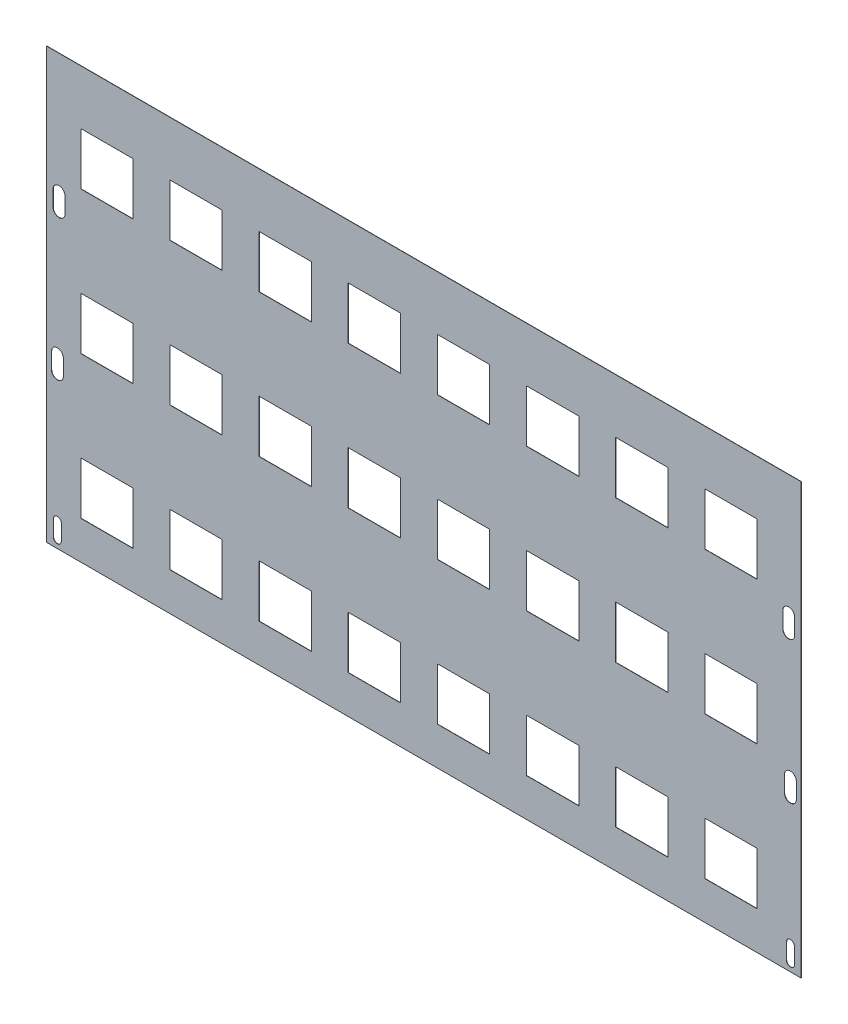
ISO-10303-21;
HEADER;
FILE_DESCRIPTION(('STEP AP214'),'2;1');
FILE_NAME('part.step','',(''),(''),'','','');
FILE_SCHEMA(('AUTOMOTIVE_DESIGN { 1 0 10303 214 1 1 1 1 }'));
ENDSEC;
DATA;
#1=APPLICATION_CONTEXT('core data for automotive mechanical design processes');
#2=APPLICATION_PROTOCOL_DEFINITION('international standard','automotive_design',2000,#1);
#3=PRODUCT_CONTEXT('',#1,'mechanical');
#4=PRODUCT('Part','Part','',(#3));
#5=PRODUCT_RELATED_PRODUCT_CATEGORY('part','',(#4));
#6=PRODUCT_DEFINITION_FORMATION('','',#4);
#7=PRODUCT_DEFINITION_CONTEXT('part definition',#1,'design');
#8=PRODUCT_DEFINITION('design','',#6,#7);
#9=PRODUCT_DEFINITION_SHAPE('','',#8);
#10=(LENGTH_UNIT() NAMED_UNIT(*) SI_UNIT(.MILLI.,.METRE.));
#11=(NAMED_UNIT(*) PLANE_ANGLE_UNIT() SI_UNIT($,.RADIAN.));
#12=(NAMED_UNIT(*) SI_UNIT($,.STERADIAN.) SOLID_ANGLE_UNIT());
#13=UNCERTAINTY_MEASURE_WITH_UNIT(LENGTH_MEASURE(1.E-05),#10,'distance_accuracy_value','');
#14=(GEOMETRIC_REPRESENTATION_CONTEXT(3) GLOBAL_UNCERTAINTY_ASSIGNED_CONTEXT((#13)) GLOBAL_UNIT_ASSIGNED_CONTEXT((#10,
#11,#12)) REPRESENTATION_CONTEXT('',''));
#15=CARTESIAN_POINT('',(0.,0.,0.));
#16=DIRECTION('',(0.,0.,1.));
#17=DIRECTION('',(1.,0.,0.));
#18=AXIS2_PLACEMENT_3D('',#15,#16,#17);
#19=CARTESIAN_POINT('',(0.,0.,-0.6));
#20=DIRECTION('',(0.,0.,1.));
#21=DIRECTION('',(1.,0.,0.));
#22=AXIS2_PLACEMENT_3D('',#19,#20,#21);
#23=PLANE('',#22);
#24=CARTESIAN_POINT('',(1812.00000000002,423.911611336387,-0.6));
#25=DIRECTION('',(0.,0.,1.));
#26=DIRECTION('',(1.,0.,0.));
#27=AXIS2_PLACEMENT_3D('',#24,#25,#26);
#28=CIRCLE('',#27,15.);
#29=CARTESIAN_POINT('',(1827.00000000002,423.911611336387,-0.6));
#30=VERTEX_POINT('',#29);
#31=CARTESIAN_POINT('',(1797.00000000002,423.911611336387,-0.6));
#32=VERTEX_POINT('',#31);
#33=EDGE_CURVE('E917',#30,#32,#28,.T.);
#34=ORIENTED_EDGE('',*,*,#33,.T.);
#35=DIRECTION('',(0.,-1.,0.));
#36=VECTOR('',#35,1.);
#37=CARTESIAN_POINT('',(1797.00000000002,423.911611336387,-0.6));
#38=LINE('',#37,#36);
#39=CARTESIAN_POINT('',(1797.00000000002,383.911611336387,-0.6));
#40=VERTEX_POINT('',#39);
#41=EDGE_CURVE('E927',#32,#40,#38,.T.);
#42=ORIENTED_EDGE('',*,*,#41,.T.);
#43=CARTESIAN_POINT('',(1812.00000000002,383.911611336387,-0.6));
#44=DIRECTION('',(0.,0.,1.));
#45=DIRECTION('',(1.,0.,0.));
#46=AXIS2_PLACEMENT_3D('',#43,#44,#45);
#47=CIRCLE('',#46,15.);
#48=CARTESIAN_POINT('',(1827.00000000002,383.911611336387,-0.6));
#49=VERTEX_POINT('',#48);
#50=EDGE_CURVE('E924',#40,#49,#47,.T.);
#51=ORIENTED_EDGE('',*,*,#50,.T.);
#52=DIRECTION('',(0.,1.,0.));
#53=VECTOR('',#52,1.);
#54=CARTESIAN_POINT('',(1827.00000000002,423.911611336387,-0.6));
#55=LINE('',#54,#53);
#56=EDGE_CURVE('E920',#49,#30,#55,.T.);
#57=ORIENTED_EDGE('',*,*,#56,.T.);
#58=EDGE_LOOP('',(#34,#42,#51,#57));
#59=FACE_BOUND('',#58,.T.);
#60=DIRECTION('',(0.,-1.,0.));
#61=VECTOR('',#60,1.);
#62=CARTESIAN_POINT('',(-65.,0.,-0.6));
#63=LINE('',#62,#61);
#64=CARTESIAN_POINT('',(-65.,1085.,-0.6));
#65=VERTEX_POINT('',#64);
#66=CARTESIAN_POINT('',(-65.,0.,-0.6));
#67=VERTEX_POINT('',#66);
#68=EDGE_CURVE('E820',#65,#67,#63,.T.);
#69=ORIENTED_EDGE('',*,*,#68,.F.);
#70=DIRECTION('',(1.,0.,0.));
#71=VECTOR('',#70,1.);
#72=CARTESIAN_POINT('',(-1.26532771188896E-13,1085.,-0.6));
#73=LINE('',#72,#71);
#74=CARTESIAN_POINT('',(1839.,1085.,-0.600000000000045));
#75=VERTEX_POINT('',#74);
#76=EDGE_CURVE('E802',#65,#75,#73,.T.);
#77=ORIENTED_EDGE('',*,*,#76,.T.);
#78=DIRECTION('',(0.,-1.,0.));
#79=VECTOR('',#78,1.);
#80=CARTESIAN_POINT('',(1839.,4.44089209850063E-13,-0.6));
#81=LINE('',#80,#79);
#82=CARTESIAN_POINT('',(1839.,0.,-0.600000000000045));
#83=VERTEX_POINT('',#82);
#84=EDGE_CURVE('E1020',#75,#83,#81,.T.);
#85=ORIENTED_EDGE('',*,*,#84,.T.);
#86=DIRECTION('',(1.,0.,0.));
#87=VECTOR('',#86,1.);
#88=CARTESIAN_POINT('',(0.,0.,-0.6));
#89=LINE('',#88,#87);
#90=EDGE_CURVE('E830',#67,#83,#89,.T.);
#91=ORIENTED_EDGE('',*,*,#90,.F.);
#92=EDGE_LOOP('',(#69,#77,#85,#91));
#93=FACE_BOUND('',#92,.T.);
#94=DIRECTION('',(0.,1.,0.));
#95=VECTOR('',#94,1.);
#96=CARTESIAN_POINT('',(378.05073241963,0.,-0.6));
#97=LINE('',#96,#95);
#98=CARTESIAN_POINT('',(378.05073241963,815.911611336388,-0.6));
#99=VERTEX_POINT('',#98);
#100=CARTESIAN_POINT('',(378.05073241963,947.911611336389,-0.6));
#101=VERTEX_POINT('',#100);
#102=EDGE_CURVE('E1508',#99,#101,#97,.T.);
#103=ORIENTED_EDGE('',*,*,#102,.T.);
#104=DIRECTION('',(-1.,0.,0.));
#105=VECTOR('',#104,1.);
#106=CARTESIAN_POINT('',(0.,947.911611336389,-0.6));
#107=LINE('',#106,#105);
#108=CARTESIAN_POINT('',(246.05073241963,947.911611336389,-0.6));
#109=VERTEX_POINT('',#108);
#110=EDGE_CURVE('E1511',#101,#109,#107,.T.);
#111=ORIENTED_EDGE('',*,*,#110,.T.);
#112=DIRECTION('',(0.,-1.,0.));
#113=VECTOR('',#112,1.);
#114=CARTESIAN_POINT('',(246.05073241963,0.,-0.6));
#115=LINE('',#114,#113);
#116=CARTESIAN_POINT('',(246.05073241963,815.911611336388,-0.6));
#117=VERTEX_POINT('',#116);
#118=EDGE_CURVE('E1496',#109,#117,#115,.T.);
#119=ORIENTED_EDGE('',*,*,#118,.T.);
#120=DIRECTION('',(1.,0.,0.));
#121=VECTOR('',#120,1.);
#122=CARTESIAN_POINT('',(0.,815.911611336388,-0.6));
#123=LINE('',#122,#121);
#124=EDGE_CURVE('E1505',#117,#99,#123,.T.);
#125=ORIENTED_EDGE('',*,*,#124,.T.);
#126=EDGE_LOOP('',(#103,#111,#119,#125));
#127=FACE_BOUND('',#126,.T.);
#128=DIRECTION('',(0.,1.,0.));
#129=VECTOR('',#128,1.);
#130=CARTESIAN_POINT('',(1728.05073241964,0.,-0.6));
#131=LINE('',#130,#129);
#132=CARTESIAN_POINT('',(1728.05073241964,95.9116113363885,-0.6));
#133=VERTEX_POINT('',#132);
#134=CARTESIAN_POINT('',(1728.05073241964,227.911611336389,-0.6));
#135=VERTEX_POINT('',#134);
#136=EDGE_CURVE('E1520',#133,#135,#131,.T.);
#137=ORIENTED_EDGE('',*,*,#136,.T.);
#138=DIRECTION('',(-1.,0.,0.));
#139=VECTOR('',#138,1.);
#140=CARTESIAN_POINT('',(0.,227.911611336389,-0.6));
#141=LINE('',#140,#139);
#142=CARTESIAN_POINT('',(1596.05073241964,227.911611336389,-0.6));
#143=VERTEX_POINT('',#142);
#144=EDGE_CURVE('E1523',#135,#143,#141,.T.);
#145=ORIENTED_EDGE('',*,*,#144,.T.);
#146=DIRECTION('',(0.,-1.,0.));
#147=VECTOR('',#146,1.);
#148=CARTESIAN_POINT('',(1596.05073241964,0.,-0.6));
#149=LINE('',#148,#147);
#150=CARTESIAN_POINT('',(1596.05073241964,95.9116113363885,-0.6));
#151=VERTEX_POINT('',#150);
#152=EDGE_CURVE('E1514',#143,#151,#149,.T.);
#153=ORIENTED_EDGE('',*,*,#152,.T.);
#154=DIRECTION('',(1.,0.,0.));
#155=VECTOR('',#154,1.);
#156=CARTESIAN_POINT('',(0.,95.9116113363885,-0.6));
#157=LINE('',#156,#155);
#158=EDGE_CURVE('E1517',#151,#133,#157,.T.);
#159=ORIENTED_EDGE('',*,*,#158,.T.);
#160=EDGE_LOOP('',(#137,#145,#153,#159));
#161=FACE_BOUND('',#160,.T.);
#162=DIRECTION('',(0.,1.,0.));
#163=VECTOR('',#162,1.);
#164=CARTESIAN_POINT('',(1728.05073241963,0.,-0.6));
#165=LINE('',#164,#163);
#166=CARTESIAN_POINT('',(1728.05073241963,455.911611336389,-0.6));
#167=VERTEX_POINT('',#166);
#168=CARTESIAN_POINT('',(1728.05073241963,587.911611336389,-0.6));
#169=VERTEX_POINT('',#168);
#170=EDGE_CURVE('E1532',#167,#169,#165,.T.);
#171=ORIENTED_EDGE('',*,*,#170,.T.);
#172=DIRECTION('',(-1.,0.,0.));
#173=VECTOR('',#172,1.);
#174=CARTESIAN_POINT('',(0.,587.911611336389,-0.6));
#175=LINE('',#174,#173);
#176=CARTESIAN_POINT('',(1596.05073241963,587.911611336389,-0.6));
#177=VERTEX_POINT('',#176);
#178=EDGE_CURVE('E1535',#169,#177,#175,.T.);
#179=ORIENTED_EDGE('',*,*,#178,.T.);
#180=DIRECTION('',(0.,-1.,0.));
#181=VECTOR('',#180,1.);
#182=CARTESIAN_POINT('',(1596.05073241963,0.,-0.6));
#183=LINE('',#182,#181);
#184=CARTESIAN_POINT('',(1596.05073241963,455.911611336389,-0.6));
#185=VERTEX_POINT('',#184);
#186=EDGE_CURVE('E1526',#177,#185,#183,.T.);
#187=ORIENTED_EDGE('',*,*,#186,.T.);
#188=DIRECTION('',(1.,0.,0.));
#189=VECTOR('',#188,1.);
#190=CARTESIAN_POINT('',(0.,455.911611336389,-0.6));
#191=LINE('',#190,#189);
#192=EDGE_CURVE('E1529',#185,#167,#191,.T.);
#193=ORIENTED_EDGE('',*,*,#192,.T.);
#194=EDGE_LOOP('',(#171,#179,#187,#193));
#195=FACE_BOUND('',#194,.T.);
#196=DIRECTION('',(0.,1.,0.));
#197=VECTOR('',#196,1.);
#198=CARTESIAN_POINT('',(1728.05073241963,0.,-0.6));
#199=LINE('',#198,#197);
#200=CARTESIAN_POINT('',(1728.05073241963,815.911611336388,-0.6));
#201=VERTEX_POINT('',#200);
#202=CARTESIAN_POINT('',(1728.05073241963,947.911611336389,-0.6));
#203=VERTEX_POINT('',#202);
#204=EDGE_CURVE('E1544',#201,#203,#199,.T.);
#205=ORIENTED_EDGE('',*,*,#204,.T.);
#206=DIRECTION('',(-1.,0.,0.));
#207=VECTOR('',#206,1.);
#208=CARTESIAN_POINT('',(0.,947.911611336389,-0.6));
#209=LINE('',#208,#207);
#210=CARTESIAN_POINT('',(1596.05073241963,947.911611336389,-0.6));
#211=VERTEX_POINT('',#210);
#212=EDGE_CURVE('E1547',#203,#211,#209,.T.);
#213=ORIENTED_EDGE('',*,*,#212,.T.);
#214=DIRECTION('',(0.,-1.,0.));
#215=VECTOR('',#214,1.);
#216=CARTESIAN_POINT('',(1596.05073241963,0.,-0.6));
#217=LINE('',#216,#215);
#218=CARTESIAN_POINT('',(1596.05073241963,815.911611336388,-0.6));
#219=VERTEX_POINT('',#218);
#220=EDGE_CURVE('E1538',#211,#219,#217,.T.);
#221=ORIENTED_EDGE('',*,*,#220,.T.);
#222=DIRECTION('',(1.,0.,0.));
#223=VECTOR('',#222,1.);
#224=CARTESIAN_POINT('',(0.,815.911611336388,-0.6));
#225=LINE('',#224,#223);
#226=EDGE_CURVE('E1541',#219,#201,#225,.T.);
#227=ORIENTED_EDGE('',*,*,#226,.T.);
#228=EDGE_LOOP('',(#205,#213,#221,#227));
#229=FACE_BOUND('',#228,.T.);
#230=DIRECTION('',(0.,1.,0.));
#231=VECTOR('',#230,1.);
#232=CARTESIAN_POINT('',(153.050732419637,0.,-0.6));
#233=LINE('',#232,#231);
#234=CARTESIAN_POINT('',(153.050732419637,95.9116113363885,-0.6));
#235=VERTEX_POINT('',#234);
#236=CARTESIAN_POINT('',(153.050732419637,227.911611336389,-0.6));
#237=VERTEX_POINT('',#236);
#238=EDGE_CURVE('E1556',#235,#237,#233,.T.);
#239=ORIENTED_EDGE('',*,*,#238,.T.);
#240=DIRECTION('',(-1.,0.,0.));
#241=VECTOR('',#240,1.);
#242=CARTESIAN_POINT('',(0.,227.911611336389,-0.6));
#243=LINE('',#242,#241);
#244=CARTESIAN_POINT('',(21.0507324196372,227.911611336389,-0.6));
#245=VERTEX_POINT('',#244);
#246=EDGE_CURVE('E1559',#237,#245,#243,.T.);
#247=ORIENTED_EDGE('',*,*,#246,.T.);
#248=DIRECTION('',(0.,-1.,0.));
#249=VECTOR('',#248,1.);
#250=CARTESIAN_POINT('',(21.0507324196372,0.,-0.6));
#251=LINE('',#250,#249);
#252=CARTESIAN_POINT('',(21.0507324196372,95.9116113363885,-0.6));
#253=VERTEX_POINT('',#252);
#254=EDGE_CURVE('E1550',#245,#253,#251,.T.);
#255=ORIENTED_EDGE('',*,*,#254,.T.);
#256=DIRECTION('',(1.,0.,0.));
#257=VECTOR('',#256,1.);
#258=CARTESIAN_POINT('',(0.,95.9116113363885,-0.6));
#259=LINE('',#258,#257);
#260=EDGE_CURVE('E1553',#253,#235,#259,.T.);
#261=ORIENTED_EDGE('',*,*,#260,.T.);
#262=EDGE_LOOP('',(#239,#247,#255,#261));
#263=FACE_BOUND('',#262,.T.);
#264=DIRECTION('',(0.,1.,0.));
#265=VECTOR('',#264,1.);
#266=CARTESIAN_POINT('',(1503.05073241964,0.,-0.6));
#267=LINE('',#266,#265);
#268=CARTESIAN_POINT('',(1503.05073241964,95.9116113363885,-0.6));
#269=VERTEX_POINT('',#268);
#270=CARTESIAN_POINT('',(1503.05073241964,227.911611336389,-0.6));
#271=VERTEX_POINT('',#270);
#272=EDGE_CURVE('E1568',#269,#271,#267,.T.);
#273=ORIENTED_EDGE('',*,*,#272,.T.);
#274=DIRECTION('',(-1.,0.,0.));
#275=VECTOR('',#274,1.);
#276=CARTESIAN_POINT('',(0.,227.911611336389,-0.6));
#277=LINE('',#276,#275);
#278=CARTESIAN_POINT('',(1371.05073241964,227.911611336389,-0.6));
#279=VERTEX_POINT('',#278);
#280=EDGE_CURVE('E1571',#271,#279,#277,.T.);
#281=ORIENTED_EDGE('',*,*,#280,.T.);
#282=DIRECTION('',(0.,-1.,0.));
#283=VECTOR('',#282,1.);
#284=CARTESIAN_POINT('',(1371.05073241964,0.,-0.6));
#285=LINE('',#284,#283);
#286=CARTESIAN_POINT('',(1371.05073241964,95.9116113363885,-0.6));
#287=VERTEX_POINT('',#286);
#288=EDGE_CURVE('E1562',#279,#287,#285,.T.);
#289=ORIENTED_EDGE('',*,*,#288,.T.);
#290=DIRECTION('',(1.,0.,0.));
#291=VECTOR('',#290,1.);
#292=CARTESIAN_POINT('',(0.,95.9116113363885,-0.6));
#293=LINE('',#292,#291);
#294=EDGE_CURVE('E1565',#287,#269,#293,.T.);
#295=ORIENTED_EDGE('',*,*,#294,.T.);
#296=EDGE_LOOP('',(#273,#281,#289,#295));
#297=FACE_BOUND('',#296,.T.);
#298=DIRECTION('',(0.,1.,0.));
#299=VECTOR('',#298,1.);
#300=CARTESIAN_POINT('',(1503.05073241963,0.,-0.6));
#301=LINE('',#300,#299);
#302=CARTESIAN_POINT('',(1503.05073241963,455.911611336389,-0.6));
#303=VERTEX_POINT('',#302);
#304=CARTESIAN_POINT('',(1503.05073241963,587.911611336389,-0.6));
#305=VERTEX_POINT('',#304);
#306=EDGE_CURVE('E1580',#303,#305,#301,.T.);
#307=ORIENTED_EDGE('',*,*,#306,.T.);
#308=DIRECTION('',(-1.,0.,0.));
#309=VECTOR('',#308,1.);
#310=CARTESIAN_POINT('',(0.,587.911611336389,-0.6));
#311=LINE('',#310,#309);
#312=CARTESIAN_POINT('',(1371.05073241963,587.911611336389,-0.6));
#313=VERTEX_POINT('',#312);
#314=EDGE_CURVE('E1583',#305,#313,#311,.T.);
#315=ORIENTED_EDGE('',*,*,#314,.T.);
#316=DIRECTION('',(0.,-1.,0.));
#317=VECTOR('',#316,1.);
#318=CARTESIAN_POINT('',(1371.05073241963,0.,-0.6));
#319=LINE('',#318,#317);
#320=CARTESIAN_POINT('',(1371.05073241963,455.911611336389,-0.6));
#321=VERTEX_POINT('',#320);
#322=EDGE_CURVE('E1574',#313,#321,#319,.T.);
#323=ORIENTED_EDGE('',*,*,#322,.T.);
#324=DIRECTION('',(1.,0.,0.));
#325=VECTOR('',#324,1.);
#326=CARTESIAN_POINT('',(0.,455.911611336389,-0.6));
#327=LINE('',#326,#325);
#328=EDGE_CURVE('E1577',#321,#303,#327,.T.);
#329=ORIENTED_EDGE('',*,*,#328,.T.);
#330=EDGE_LOOP('',(#307,#315,#323,#329));
#331=FACE_BOUND('',#330,.T.);
#332=DIRECTION('',(0.,1.,0.));
#333=VECTOR('',#332,1.);
#334=CARTESIAN_POINT('',(1503.05073241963,0.,-0.6));
#335=LINE('',#334,#333);
#336=CARTESIAN_POINT('',(1503.05073241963,815.911611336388,-0.6));
#337=VERTEX_POINT('',#336);
#338=CARTESIAN_POINT('',(1503.05073241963,947.911611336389,-0.6));
#339=VERTEX_POINT('',#338);
#340=EDGE_CURVE('E1592',#337,#339,#335,.T.);
#341=ORIENTED_EDGE('',*,*,#340,.T.);
#342=DIRECTION('',(-1.,0.,0.));
#343=VECTOR('',#342,1.);
#344=CARTESIAN_POINT('',(0.,947.911611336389,-0.6));
#345=LINE('',#344,#343);
#346=CARTESIAN_POINT('',(1371.05073241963,947.911611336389,-0.6));
#347=VERTEX_POINT('',#346);
#348=EDGE_CURVE('E1595',#339,#347,#345,.T.);
#349=ORIENTED_EDGE('',*,*,#348,.T.);
#350=DIRECTION('',(0.,-1.,0.));
#351=VECTOR('',#350,1.);
#352=CARTESIAN_POINT('',(1371.05073241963,0.,-0.6));
#353=LINE('',#352,#351);
#354=CARTESIAN_POINT('',(1371.05073241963,815.911611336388,-0.6));
#355=VERTEX_POINT('',#354);
#356=EDGE_CURVE('E1586',#347,#355,#353,.T.);
#357=ORIENTED_EDGE('',*,*,#356,.T.);
#358=DIRECTION('',(1.,0.,0.));
#359=VECTOR('',#358,1.);
#360=CARTESIAN_POINT('',(0.,815.911611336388,-0.6));
#361=LINE('',#360,#359);
#362=EDGE_CURVE('E1589',#355,#337,#361,.T.);
#363=ORIENTED_EDGE('',*,*,#362,.T.);
#364=EDGE_LOOP('',(#341,#349,#357,#363));
#365=FACE_BOUND('',#364,.T.);
#366=DIRECTION('',(0.,1.,0.));
#367=VECTOR('',#366,1.);
#368=CARTESIAN_POINT('',(828.050732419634,0.,-0.6));
#369=LINE('',#368,#367);
#370=CARTESIAN_POINT('',(828.050732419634,455.911611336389,-0.6));
#371=VERTEX_POINT('',#370);
#372=CARTESIAN_POINT('',(828.050732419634,587.911611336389,-0.6));
#373=VERTEX_POINT('',#372);
#374=EDGE_CURVE('E1604',#371,#373,#369,.T.);
#375=ORIENTED_EDGE('',*,*,#374,.T.);
#376=DIRECTION('',(-1.,0.,0.));
#377=VECTOR('',#376,1.);
#378=CARTESIAN_POINT('',(0.,587.911611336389,-0.6));
#379=LINE('',#378,#377);
#380=CARTESIAN_POINT('',(696.050732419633,587.911611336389,-0.6));
#381=VERTEX_POINT('',#380);
#382=EDGE_CURVE('E1607',#373,#381,#379,.T.);
#383=ORIENTED_EDGE('',*,*,#382,.T.);
#384=DIRECTION('',(0.,-1.,0.));
#385=VECTOR('',#384,1.);
#386=CARTESIAN_POINT('',(696.050732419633,0.,-0.6));
#387=LINE('',#386,#385);
#388=CARTESIAN_POINT('',(696.050732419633,455.911611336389,-0.6));
#389=VERTEX_POINT('',#388);
#390=EDGE_CURVE('E1598',#381,#389,#387,.T.);
#391=ORIENTED_EDGE('',*,*,#390,.T.);
#392=DIRECTION('',(1.,0.,0.));
#393=VECTOR('',#392,1.);
#394=CARTESIAN_POINT('',(0.,455.911611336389,-0.6));
#395=LINE('',#394,#393);
#396=EDGE_CURVE('E1601',#389,#371,#395,.T.);
#397=ORIENTED_EDGE('',*,*,#396,.T.);
#398=EDGE_LOOP('',(#375,#383,#391,#397));
#399=FACE_BOUND('',#398,.T.);
#400=DIRECTION('',(0.,1.,0.));
#401=VECTOR('',#400,1.);
#402=CARTESIAN_POINT('',(828.05073241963,0.,-0.6));
#403=LINE('',#402,#401);
#404=CARTESIAN_POINT('',(828.05073241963,815.911611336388,-0.6));
#405=VERTEX_POINT('',#404);
#406=CARTESIAN_POINT('',(828.05073241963,947.911611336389,-0.6));
#407=VERTEX_POINT('',#406);
#408=EDGE_CURVE('E1616',#405,#407,#403,.T.);
#409=ORIENTED_EDGE('',*,*,#408,.T.);
#410=DIRECTION('',(-1.,0.,0.));
#411=VECTOR('',#410,1.);
#412=CARTESIAN_POINT('',(0.,947.911611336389,-0.6));
#413=LINE('',#412,#411);
#414=CARTESIAN_POINT('',(696.05073241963,947.911611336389,-0.6));
#415=VERTEX_POINT('',#414);
#416=EDGE_CURVE('E1619',#407,#415,#413,.T.);
#417=ORIENTED_EDGE('',*,*,#416,.T.);
#418=DIRECTION('',(0.,-1.,0.));
#419=VECTOR('',#418,1.);
#420=CARTESIAN_POINT('',(696.05073241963,0.,-0.6));
#421=LINE('',#420,#419);
#422=CARTESIAN_POINT('',(696.05073241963,815.911611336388,-0.6));
#423=VERTEX_POINT('',#422);
#424=EDGE_CURVE('E1610',#415,#423,#421,.T.);
#425=ORIENTED_EDGE('',*,*,#424,.T.);
#426=DIRECTION('',(1.,0.,0.));
#427=VECTOR('',#426,1.);
#428=CARTESIAN_POINT('',(0.,815.911611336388,-0.6));
#429=LINE('',#428,#427);
#430=EDGE_CURVE('E1613',#423,#405,#429,.T.);
#431=ORIENTED_EDGE('',*,*,#430,.T.);
#432=EDGE_LOOP('',(#409,#417,#425,#431));
#433=FACE_BOUND('',#432,.T.);
#434=DIRECTION('',(0.,1.,0.));
#435=VECTOR('',#434,1.);
#436=CARTESIAN_POINT('',(153.05073241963,0.,-0.6));
#437=LINE('',#436,#435);
#438=CARTESIAN_POINT('',(153.05073241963,815.911611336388,-0.6));
#439=VERTEX_POINT('',#438);
#440=CARTESIAN_POINT('',(153.05073241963,947.911611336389,-0.6));
#441=VERTEX_POINT('',#440);
#442=EDGE_CURVE('E1628',#439,#441,#437,.T.);
#443=ORIENTED_EDGE('',*,*,#442,.T.);
#444=DIRECTION('',(-1.,0.,0.));
#445=VECTOR('',#444,1.);
#446=CARTESIAN_POINT('',(0.,947.911611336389,-0.6));
#447=LINE('',#446,#445);
#448=CARTESIAN_POINT('',(21.0507324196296,947.911611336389,-0.6));
#449=VERTEX_POINT('',#448);
#450=EDGE_CURVE('E1631',#441,#449,#447,.T.);
#451=ORIENTED_EDGE('',*,*,#450,.T.);
#452=DIRECTION('',(0.,-1.,0.));
#453=VECTOR('',#452,1.);
#454=CARTESIAN_POINT('',(21.0507324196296,0.,-0.6));
#455=LINE('',#454,#453);
#456=CARTESIAN_POINT('',(21.0507324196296,815.911611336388,-0.6));
#457=VERTEX_POINT('',#456);
#458=EDGE_CURVE('E1622',#449,#457,#455,.T.);
#459=ORIENTED_EDGE('',*,*,#458,.T.);
#460=DIRECTION('',(1.,0.,0.));
#461=VECTOR('',#460,1.);
#462=CARTESIAN_POINT('',(0.,815.911611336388,-0.6));
#463=LINE('',#462,#461);
#464=EDGE_CURVE('E1625',#457,#439,#463,.T.);
#465=ORIENTED_EDGE('',*,*,#464,.T.);
#466=EDGE_LOOP('',(#443,#451,#459,#465));
#467=FACE_BOUND('',#466,.T.);
#468=DIRECTION('',(0.,1.,0.));
#469=VECTOR('',#468,1.);
#470=CARTESIAN_POINT('',(603.050732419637,0.,-0.6));
#471=LINE('',#470,#469);
#472=CARTESIAN_POINT('',(603.050732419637,95.9116113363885,-0.6));
#473=VERTEX_POINT('',#472);
#474=CARTESIAN_POINT('',(603.050732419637,227.911611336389,-0.6));
#475=VERTEX_POINT('',#474);
#476=EDGE_CURVE('E1640',#473,#475,#471,.T.);
#477=ORIENTED_EDGE('',*,*,#476,.T.);
#478=DIRECTION('',(-1.,0.,0.));
#479=VECTOR('',#478,1.);
#480=CARTESIAN_POINT('',(0.,227.911611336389,-0.6));
#481=LINE('',#480,#479);
#482=CARTESIAN_POINT('',(471.050732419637,227.911611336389,-0.6));
#483=VERTEX_POINT('',#482);
#484=EDGE_CURVE('E1643',#475,#483,#481,.T.);
#485=ORIENTED_EDGE('',*,*,#484,.T.);
#486=DIRECTION('',(0.,-1.,0.));
#487=VECTOR('',#486,1.);
#488=CARTESIAN_POINT('',(471.050732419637,0.,-0.6));
#489=LINE('',#488,#487);
#490=CARTESIAN_POINT('',(471.050732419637,95.9116113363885,-0.6));
#491=VERTEX_POINT('',#490);
#492=EDGE_CURVE('E1634',#483,#491,#489,.T.);
#493=ORIENTED_EDGE('',*,*,#492,.T.);
#494=DIRECTION('',(1.,0.,0.));
#495=VECTOR('',#494,1.);
#496=CARTESIAN_POINT('',(0.,95.9116113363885,-0.6));
#497=LINE('',#496,#495);
#498=EDGE_CURVE('E1637',#491,#473,#497,.T.);
#499=ORIENTED_EDGE('',*,*,#498,.T.);
#500=EDGE_LOOP('',(#477,#485,#493,#499));
#501=FACE_BOUND('',#500,.T.);
#502=DIRECTION('',(0.,1.,0.));
#503=VECTOR('',#502,1.);
#504=CARTESIAN_POINT('',(603.050732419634,0.,-0.6));
#505=LINE('',#504,#503);
#506=CARTESIAN_POINT('',(603.050732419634,455.911611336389,-0.6));
#507=VERTEX_POINT('',#506);
#508=CARTESIAN_POINT('',(603.050732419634,587.911611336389,-0.6));
#509=VERTEX_POINT('',#508);
#510=EDGE_CURVE('E1652',#507,#509,#505,.T.);
#511=ORIENTED_EDGE('',*,*,#510,.T.);
#512=DIRECTION('',(-1.,0.,0.));
#513=VECTOR('',#512,1.);
#514=CARTESIAN_POINT('',(0.,587.911611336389,-0.6));
#515=LINE('',#514,#513);
#516=CARTESIAN_POINT('',(471.050732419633,587.911611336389,-0.6));
#517=VERTEX_POINT('',#516);
#518=EDGE_CURVE('E1655',#509,#517,#515,.T.);
#519=ORIENTED_EDGE('',*,*,#518,.T.);
#520=DIRECTION('',(0.,-1.,0.));
#521=VECTOR('',#520,1.);
#522=CARTESIAN_POINT('',(471.050732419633,0.,-0.6));
#523=LINE('',#522,#521);
#524=CARTESIAN_POINT('',(471.050732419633,455.911611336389,-0.6));
#525=VERTEX_POINT('',#524);
#526=EDGE_CURVE('E1646',#517,#525,#523,.T.);
#527=ORIENTED_EDGE('',*,*,#526,.T.);
#528=DIRECTION('',(1.,0.,0.));
#529=VECTOR('',#528,1.);
#530=CARTESIAN_POINT('',(0.,455.911611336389,-0.6));
#531=LINE('',#530,#529);
#532=EDGE_CURVE('E1649',#525,#507,#531,.T.);
#533=ORIENTED_EDGE('',*,*,#532,.T.);
#534=EDGE_LOOP('',(#511,#519,#527,#533));
#535=FACE_BOUND('',#534,.T.);
#536=DIRECTION('',(0.,1.,0.));
#537=VECTOR('',#536,1.);
#538=CARTESIAN_POINT('',(603.05073241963,0.,-0.6));
#539=LINE('',#538,#537);
#540=CARTESIAN_POINT('',(603.05073241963,815.911611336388,-0.6));
#541=VERTEX_POINT('',#540);
#542=CARTESIAN_POINT('',(603.05073241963,947.911611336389,-0.6));
#543=VERTEX_POINT('',#542);
#544=EDGE_CURVE('E1664',#541,#543,#539,.T.);
#545=ORIENTED_EDGE('',*,*,#544,.T.);
#546=DIRECTION('',(-1.,0.,0.));
#547=VECTOR('',#546,1.);
#548=CARTESIAN_POINT('',(0.,947.911611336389,-0.6));
#549=LINE('',#548,#547);
#550=CARTESIAN_POINT('',(471.05073241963,947.911611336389,-0.6));
#551=VERTEX_POINT('',#550);
#552=EDGE_CURVE('E1667',#543,#551,#549,.T.);
#553=ORIENTED_EDGE('',*,*,#552,.T.);
#554=DIRECTION('',(0.,-1.,0.));
#555=VECTOR('',#554,1.);
#556=CARTESIAN_POINT('',(471.05073241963,0.,-0.6));
#557=LINE('',#556,#555);
#558=CARTESIAN_POINT('',(471.05073241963,815.911611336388,-0.6));
#559=VERTEX_POINT('',#558);
#560=EDGE_CURVE('E1658',#551,#559,#557,.T.);
#561=ORIENTED_EDGE('',*,*,#560,.T.);
#562=DIRECTION('',(1.,0.,0.));
#563=VECTOR('',#562,1.);
#564=CARTESIAN_POINT('',(0.,815.911611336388,-0.6));
#565=LINE('',#564,#563);
#566=EDGE_CURVE('E1661',#559,#541,#565,.T.);
#567=ORIENTED_EDGE('',*,*,#566,.T.);
#568=EDGE_LOOP('',(#545,#553,#561,#567));
#569=FACE_BOUND('',#568,.T.);
#570=DIRECTION('',(0.,1.,0.));
#571=VECTOR('',#570,1.);
#572=CARTESIAN_POINT('',(378.050732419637,0.,-0.6));
#573=LINE('',#572,#571);
#574=CARTESIAN_POINT('',(378.050732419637,95.9116113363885,-0.6));
#575=VERTEX_POINT('',#574);
#576=CARTESIAN_POINT('',(378.050732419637,227.911611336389,-0.6));
#577=VERTEX_POINT('',#576);
#578=EDGE_CURVE('E1676',#575,#577,#573,.T.);
#579=ORIENTED_EDGE('',*,*,#578,.T.);
#580=DIRECTION('',(-1.,0.,0.));
#581=VECTOR('',#580,1.);
#582=CARTESIAN_POINT('',(0.,227.911611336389,-0.6));
#583=LINE('',#582,#581);
#584=CARTESIAN_POINT('',(246.050732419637,227.911611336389,-0.6));
#585=VERTEX_POINT('',#584);
#586=EDGE_CURVE('E1679',#577,#585,#583,.T.);
#587=ORIENTED_EDGE('',*,*,#586,.T.);
#588=DIRECTION('',(0.,-1.,0.));
#589=VECTOR('',#588,1.);
#590=CARTESIAN_POINT('',(246.050732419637,0.,-0.6));
#591=LINE('',#590,#589);
#592=CARTESIAN_POINT('',(246.050732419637,95.9116113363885,-0.6));
#593=VERTEX_POINT('',#592);
#594=EDGE_CURVE('E1670',#585,#593,#591,.T.);
#595=ORIENTED_EDGE('',*,*,#594,.T.);
#596=DIRECTION('',(1.,0.,0.));
#597=VECTOR('',#596,1.);
#598=CARTESIAN_POINT('',(0.,95.9116113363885,-0.6));
#599=LINE('',#598,#597);
#600=EDGE_CURVE('E1673',#593,#575,#599,.T.);
#601=ORIENTED_EDGE('',*,*,#600,.T.);
#602=EDGE_LOOP('',(#579,#587,#595,#601));
#603=FACE_BOUND('',#602,.T.);
#604=DIRECTION('',(0.,1.,0.));
#605=VECTOR('',#604,1.);
#606=CARTESIAN_POINT('',(378.050732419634,0.,-0.6));
#607=LINE('',#606,#605);
#608=CARTESIAN_POINT('',(378.050732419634,455.911611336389,-0.6));
#609=VERTEX_POINT('',#608);
#610=CARTESIAN_POINT('',(378.050732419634,587.911611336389,-0.6));
#611=VERTEX_POINT('',#610);
#612=EDGE_CURVE('E1688',#609,#611,#607,.T.);
#613=ORIENTED_EDGE('',*,*,#612,.T.);
#614=DIRECTION('',(-1.,0.,0.));
#615=VECTOR('',#614,1.);
#616=CARTESIAN_POINT('',(0.,587.911611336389,-0.6));
#617=LINE('',#616,#615);
#618=CARTESIAN_POINT('',(246.050732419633,587.911611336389,-0.6));
#619=VERTEX_POINT('',#618);
#620=EDGE_CURVE('E1691',#611,#619,#617,.T.);
#621=ORIENTED_EDGE('',*,*,#620,.T.);
#622=DIRECTION('',(0.,-1.,0.));
#623=VECTOR('',#622,1.);
#624=CARTESIAN_POINT('',(246.050732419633,0.,-0.6));
#625=LINE('',#624,#623);
#626=CARTESIAN_POINT('',(246.050732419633,455.911611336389,-0.6));
#627=VERTEX_POINT('',#626);
#628=EDGE_CURVE('E1682',#619,#627,#625,.T.);
#629=ORIENTED_EDGE('',*,*,#628,.T.);
#630=DIRECTION('',(1.,0.,0.));
#631=VECTOR('',#630,1.);
#632=CARTESIAN_POINT('',(0.,455.911611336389,-0.6));
#633=LINE('',#632,#631);
#634=EDGE_CURVE('E1685',#627,#609,#633,.T.);
#635=ORIENTED_EDGE('',*,*,#634,.T.);
#636=EDGE_LOOP('',(#613,#621,#629,#635));
#637=FACE_BOUND('',#636,.T.);
#638=DIRECTION('',(0.,1.,0.));
#639=VECTOR('',#638,1.);
#640=CARTESIAN_POINT('',(153.050732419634,0.,-0.6));
#641=LINE('',#640,#639);
#642=CARTESIAN_POINT('',(153.050732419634,455.911611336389,-0.6));
#643=VERTEX_POINT('',#642);
#644=CARTESIAN_POINT('',(153.050732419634,587.911611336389,-0.6));
#645=VERTEX_POINT('',#644);
#646=EDGE_CURVE('E1700',#643,#645,#641,.T.);
#647=ORIENTED_EDGE('',*,*,#646,.T.);
#648=DIRECTION('',(-1.,0.,0.));
#649=VECTOR('',#648,1.);
#650=CARTESIAN_POINT('',(0.,587.911611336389,-0.6));
#651=LINE('',#650,#649);
#652=CARTESIAN_POINT('',(21.0507324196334,587.911611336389,-0.6));
#653=VERTEX_POINT('',#652);
#654=EDGE_CURVE('E1703',#645,#653,#651,.T.);
#655=ORIENTED_EDGE('',*,*,#654,.T.);
#656=DIRECTION('',(0.,-1.,0.));
#657=VECTOR('',#656,1.);
#658=CARTESIAN_POINT('',(21.0507324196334,0.,-0.6));
#659=LINE('',#658,#657);
#660=CARTESIAN_POINT('',(21.0507324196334,455.911611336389,-0.6));
#661=VERTEX_POINT('',#660);
#662=EDGE_CURVE('E1694',#653,#661,#659,.T.);
#663=ORIENTED_EDGE('',*,*,#662,.T.);
#664=DIRECTION('',(1.,0.,0.));
#665=VECTOR('',#664,1.);
#666=CARTESIAN_POINT('',(0.,455.911611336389,-0.6));
#667=LINE('',#666,#665);
#668=EDGE_CURVE('E1697',#661,#643,#667,.T.);
#669=ORIENTED_EDGE('',*,*,#668,.T.);
#670=EDGE_LOOP('',(#647,#655,#663,#669));
#671=FACE_BOUND('',#670,.T.);
#672=DIRECTION('',(0.,1.,0.));
#673=VECTOR('',#672,1.);
#674=CARTESIAN_POINT('',(1278.05073241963,0.,-0.6));
#675=LINE('',#674,#673);
#676=CARTESIAN_POINT('',(1278.05073241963,815.911611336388,-0.6));
#677=VERTEX_POINT('',#676);
#678=CARTESIAN_POINT('',(1278.05073241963,947.911611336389,-0.6));
#679=VERTEX_POINT('',#678);
#680=EDGE_CURVE('E1712',#677,#679,#675,.T.);
#681=ORIENTED_EDGE('',*,*,#680,.T.);
#682=DIRECTION('',(-1.,0.,0.));
#683=VECTOR('',#682,1.);
#684=CARTESIAN_POINT('',(0.,947.911611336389,-0.6));
#685=LINE('',#684,#683);
#686=CARTESIAN_POINT('',(1146.05073241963,947.911611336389,-0.6));
#687=VERTEX_POINT('',#686);
#688=EDGE_CURVE('E1715',#679,#687,#685,.T.);
#689=ORIENTED_EDGE('',*,*,#688,.T.);
#690=DIRECTION('',(0.,-1.,0.));
#691=VECTOR('',#690,1.);
#692=CARTESIAN_POINT('',(1146.05073241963,0.,-0.6));
#693=LINE('',#692,#691);
#694=CARTESIAN_POINT('',(1146.05073241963,815.911611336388,-0.6));
#695=VERTEX_POINT('',#694);
#696=EDGE_CURVE('E1706',#687,#695,#693,.T.);
#697=ORIENTED_EDGE('',*,*,#696,.T.);
#698=DIRECTION('',(1.,0.,0.));
#699=VECTOR('',#698,1.);
#700=CARTESIAN_POINT('',(0.,815.911611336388,-0.6));
#701=LINE('',#700,#699);
#702=EDGE_CURVE('E1709',#695,#677,#701,.T.);
#703=ORIENTED_EDGE('',*,*,#702,.T.);
#704=EDGE_LOOP('',(#681,#689,#697,#703));
#705=FACE_BOUND('',#704,.T.);
#706=DIRECTION('',(0.,1.,0.));
#707=VECTOR('',#706,1.);
#708=CARTESIAN_POINT('',(1278.05073241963,0.,-0.6));
#709=LINE('',#708,#707);
#710=CARTESIAN_POINT('',(1278.05073241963,455.911611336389,-0.6));
#711=VERTEX_POINT('',#710);
#712=CARTESIAN_POINT('',(1278.05073241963,587.911611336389,-0.6));
#713=VERTEX_POINT('',#712);
#714=EDGE_CURVE('E1724',#711,#713,#709,.T.);
#715=ORIENTED_EDGE('',*,*,#714,.T.);
#716=DIRECTION('',(-1.,0.,0.));
#717=VECTOR('',#716,1.);
#718=CARTESIAN_POINT('',(0.,587.911611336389,-0.6));
#719=LINE('',#718,#717);
#720=CARTESIAN_POINT('',(1146.05073241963,587.911611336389,-0.6));
#721=VERTEX_POINT('',#720);
#722=EDGE_CURVE('E1727',#713,#721,#719,.T.);
#723=ORIENTED_EDGE('',*,*,#722,.T.);
#724=DIRECTION('',(0.,-1.,0.));
#725=VECTOR('',#724,1.);
#726=CARTESIAN_POINT('',(1146.05073241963,0.,-0.6));
#727=LINE('',#726,#725);
#728=CARTESIAN_POINT('',(1146.05073241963,455.911611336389,-0.6));
#729=VERTEX_POINT('',#728);
#730=EDGE_CURVE('E1718',#721,#729,#727,.T.);
#731=ORIENTED_EDGE('',*,*,#730,.T.);
#732=DIRECTION('',(1.,0.,0.));
#733=VECTOR('',#732,1.);
#734=CARTESIAN_POINT('',(0.,455.911611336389,-0.6));
#735=LINE('',#734,#733);
#736=EDGE_CURVE('E1721',#729,#711,#735,.T.);
#737=ORIENTED_EDGE('',*,*,#736,.T.);
#738=EDGE_LOOP('',(#715,#723,#731,#737));
#739=FACE_BOUND('',#738,.T.);
#740=DIRECTION('',(0.,1.,0.));
#741=VECTOR('',#740,1.);
#742=CARTESIAN_POINT('',(1278.05073241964,0.,-0.6));
#743=LINE('',#742,#741);
#744=CARTESIAN_POINT('',(1278.05073241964,95.9116113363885,-0.6));
#745=VERTEX_POINT('',#744);
#746=CARTESIAN_POINT('',(1278.05073241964,227.911611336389,-0.6));
#747=VERTEX_POINT('',#746);
#748=EDGE_CURVE('E1736',#745,#747,#743,.T.);
#749=ORIENTED_EDGE('',*,*,#748,.T.);
#750=DIRECTION('',(-1.,0.,0.));
#751=VECTOR('',#750,1.);
#752=CARTESIAN_POINT('',(0.,227.911611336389,-0.6));
#753=LINE('',#752,#751);
#754=CARTESIAN_POINT('',(1146.05073241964,227.911611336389,-0.6));
#755=VERTEX_POINT('',#754);
#756=EDGE_CURVE('E1739',#747,#755,#753,.T.);
#757=ORIENTED_EDGE('',*,*,#756,.T.);
#758=DIRECTION('',(0.,-1.,0.));
#759=VECTOR('',#758,1.);
#760=CARTESIAN_POINT('',(1146.05073241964,0.,-0.6));
#761=LINE('',#760,#759);
#762=CARTESIAN_POINT('',(1146.05073241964,95.9116113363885,-0.6));
#763=VERTEX_POINT('',#762);
#764=EDGE_CURVE('E1730',#755,#763,#761,.T.);
#765=ORIENTED_EDGE('',*,*,#764,.T.);
#766=DIRECTION('',(1.,0.,0.));
#767=VECTOR('',#766,1.);
#768=CARTESIAN_POINT('',(0.,95.9116113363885,-0.6));
#769=LINE('',#768,#767);
#770=EDGE_CURVE('E1733',#763,#745,#769,.T.);
#771=ORIENTED_EDGE('',*,*,#770,.T.);
#772=EDGE_LOOP('',(#749,#757,#765,#771));
#773=FACE_BOUND('',#772,.T.);
#774=DIRECTION('',(0.,1.,0.));
#775=VECTOR('',#774,1.);
#776=CARTESIAN_POINT('',(828.050732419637,0.,-0.6));
#777=LINE('',#776,#775);
#778=CARTESIAN_POINT('',(828.050732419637,95.9116113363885,-0.6));
#779=VERTEX_POINT('',#778);
#780=CARTESIAN_POINT('',(828.050732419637,227.911611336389,-0.6));
#781=VERTEX_POINT('',#780);
#782=EDGE_CURVE('E1748',#779,#781,#777,.T.);
#783=ORIENTED_EDGE('',*,*,#782,.T.);
#784=DIRECTION('',(-1.,0.,0.));
#785=VECTOR('',#784,1.);
#786=CARTESIAN_POINT('',(0.,227.911611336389,-0.6));
#787=LINE('',#786,#785);
#788=CARTESIAN_POINT('',(696.050732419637,227.911611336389,-0.6));
#789=VERTEX_POINT('',#788);
#790=EDGE_CURVE('E1751',#781,#789,#787,.T.);
#791=ORIENTED_EDGE('',*,*,#790,.T.);
#792=DIRECTION('',(0.,-1.,0.));
#793=VECTOR('',#792,1.);
#794=CARTESIAN_POINT('',(696.050732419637,0.,-0.6));
#795=LINE('',#794,#793);
#796=CARTESIAN_POINT('',(696.050732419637,95.9116113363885,-0.6));
#797=VERTEX_POINT('',#796);
#798=EDGE_CURVE('E1742',#789,#797,#795,.T.);
#799=ORIENTED_EDGE('',*,*,#798,.T.);
#800=DIRECTION('',(1.,0.,0.));
#801=VECTOR('',#800,1.);
#802=CARTESIAN_POINT('',(0.,95.9116113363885,-0.6));
#803=LINE('',#802,#801);
#804=EDGE_CURVE('E1745',#797,#779,#803,.T.);
#805=ORIENTED_EDGE('',*,*,#804,.T.);
#806=EDGE_LOOP('',(#783,#791,#799,#805));
#807=FACE_BOUND('',#806,.T.);
#808=DIRECTION('',(0.,1.,0.));
#809=VECTOR('',#808,1.);
#810=CARTESIAN_POINT('',(1053.05073241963,0.,-0.6));
#811=LINE('',#810,#809);
#812=CARTESIAN_POINT('',(1053.05073241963,815.911611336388,-0.6));
#813=VERTEX_POINT('',#812);
#814=CARTESIAN_POINT('',(1053.05073241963,947.911611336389,-0.6));
#815=VERTEX_POINT('',#814);
#816=EDGE_CURVE('E1760',#813,#815,#811,.T.);
#817=ORIENTED_EDGE('',*,*,#816,.T.);
#818=DIRECTION('',(-1.,0.,0.));
#819=VECTOR('',#818,1.);
#820=CARTESIAN_POINT('',(0.,947.911611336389,-0.6));
#821=LINE('',#820,#819);
#822=CARTESIAN_POINT('',(921.05073241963,947.911611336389,-0.6));
#823=VERTEX_POINT('',#822);
#824=EDGE_CURVE('E1763',#815,#823,#821,.T.);
#825=ORIENTED_EDGE('',*,*,#824,.T.);
#826=DIRECTION('',(0.,-1.,0.));
#827=VECTOR('',#826,1.);
#828=CARTESIAN_POINT('',(921.05073241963,0.,-0.6));
#829=LINE('',#828,#827);
#830=CARTESIAN_POINT('',(921.05073241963,815.911611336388,-0.6));
#831=VERTEX_POINT('',#830);
#832=EDGE_CURVE('E1754',#823,#831,#829,.T.);
#833=ORIENTED_EDGE('',*,*,#832,.T.);
#834=DIRECTION('',(1.,0.,0.));
#835=VECTOR('',#834,1.);
#836=CARTESIAN_POINT('',(0.,815.911611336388,-0.6));
#837=LINE('',#836,#835);
#838=EDGE_CURVE('E1757',#831,#813,#837,.T.);
#839=ORIENTED_EDGE('',*,*,#838,.T.);
#840=EDGE_LOOP('',(#817,#825,#833,#839));
#841=FACE_BOUND('',#840,.T.);
#842=DIRECTION('',(0.,1.,0.));
#843=VECTOR('',#842,1.);
#844=CARTESIAN_POINT('',(1053.05073241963,0.,-0.6));
#845=LINE('',#844,#843);
#846=CARTESIAN_POINT('',(1053.05073241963,455.911611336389,-0.6));
#847=VERTEX_POINT('',#846);
#848=CARTESIAN_POINT('',(1053.05073241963,587.911611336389,-0.6));
#849=VERTEX_POINT('',#848);
#850=EDGE_CURVE('E1772',#847,#849,#845,.T.);
#851=ORIENTED_EDGE('',*,*,#850,.T.);
#852=DIRECTION('',(-1.,0.,0.));
#853=VECTOR('',#852,1.);
#854=CARTESIAN_POINT('',(0.,587.911611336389,-0.6));
#855=LINE('',#854,#853);
#856=CARTESIAN_POINT('',(921.050732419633,587.911611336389,-0.6));
#857=VERTEX_POINT('',#856);
#858=EDGE_CURVE('E1775',#849,#857,#855,.T.);
#859=ORIENTED_EDGE('',*,*,#858,.T.);
#860=DIRECTION('',(0.,-1.,0.));
#861=VECTOR('',#860,1.);
#862=CARTESIAN_POINT('',(921.050732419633,0.,-0.6));
#863=LINE('',#862,#861);
#864=CARTESIAN_POINT('',(921.050732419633,455.911611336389,-0.6));
#865=VERTEX_POINT('',#864);
#866=EDGE_CURVE('E1766',#857,#865,#863,.T.);
#867=ORIENTED_EDGE('',*,*,#866,.T.);
#868=DIRECTION('',(1.,0.,0.));
#869=VECTOR('',#868,1.);
#870=CARTESIAN_POINT('',(0.,455.911611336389,-0.6));
#871=LINE('',#870,#869);
#872=EDGE_CURVE('E1769',#865,#847,#871,.T.);
#873=ORIENTED_EDGE('',*,*,#872,.T.);
#874=EDGE_LOOP('',(#851,#859,#867,#873));
#875=FACE_BOUND('',#874,.T.);
#876=DIRECTION('',(0.,1.,0.));
#877=VECTOR('',#876,1.);
#878=CARTESIAN_POINT('',(1053.05073241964,0.,-0.6));
#879=LINE('',#878,#877);
#880=CARTESIAN_POINT('',(1053.05073241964,95.9116113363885,-0.6));
#881=VERTEX_POINT('',#880);
#882=CARTESIAN_POINT('',(1053.05073241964,227.911611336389,-0.6));
#883=VERTEX_POINT('',#882);
#884=EDGE_CURVE('E825',#881,#883,#879,.T.);
#885=ORIENTED_EDGE('',*,*,#884,.T.);
#886=DIRECTION('',(-1.,0.,0.));
#887=VECTOR('',#886,1.);
#888=CARTESIAN_POINT('',(0.,227.911611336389,-0.6));
#889=LINE('',#888,#887);
#890=CARTESIAN_POINT('',(921.050732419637,227.911611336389,-0.6));
#891=VERTEX_POINT('',#890);
#892=EDGE_CURVE('E821',#883,#891,#889,.T.);
#893=ORIENTED_EDGE('',*,*,#892,.T.);
#894=DIRECTION('',(0.,-1.,0.));
#895=VECTOR('',#894,1.);
#896=CARTESIAN_POINT('',(921.050732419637,0.,-0.6));
#897=LINE('',#896,#895);
#898=CARTESIAN_POINT('',(921.050732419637,95.9116113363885,-0.6));
#899=VERTEX_POINT('',#898);
#900=EDGE_CURVE('E1778',#891,#899,#897,.T.);
#901=ORIENTED_EDGE('',*,*,#900,.T.);
#902=DIRECTION('',(1.,0.,0.));
#903=VECTOR('',#902,1.);
#904=CARTESIAN_POINT('',(0.,95.9116113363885,-0.6));
#905=LINE('',#904,#903);
#906=EDGE_CURVE('E1781',#899,#881,#905,.T.);
#907=ORIENTED_EDGE('',*,*,#906,.T.);
#908=EDGE_LOOP('',(#885,#893,#901,#907));
#909=FACE_BOUND('',#908,.T.);
#910=DIRECTION('',(0.,-1.,0.));
#911=VECTOR('',#910,1.);
#912=CARTESIAN_POINT('',(-28.2604124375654,60.6389418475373,-0.6));
#913=LINE('',#912,#911);
#914=CARTESIAN_POINT('',(-28.2604124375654,60.6389418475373,-0.6));
#915=VERTEX_POINT('',#914);
#916=CARTESIAN_POINT('',(-28.2604124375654,20.6389418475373,-0.6));
#917=VERTEX_POINT('',#916);
#918=EDGE_CURVE('E908',#915,#917,#913,.T.);
#919=ORIENTED_EDGE('',*,*,#918,.F.);
#920=CARTESIAN_POINT('',(-38.2604124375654,60.6389418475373,-0.6));
#921=DIRECTION('',(0.,0.,-1.));
#922=DIRECTION('',(-1.,0.,0.));
#923=AXIS2_PLACEMENT_3D('',#920,#921,#922);
#924=CIRCLE('',#923,9.99999999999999);
#925=CARTESIAN_POINT('',(-48.2604124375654,60.6389418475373,-0.6));
#926=VERTEX_POINT('',#925);
#927=EDGE_CURVE('E905',#926,#915,#924,.T.);
#928=ORIENTED_EDGE('',*,*,#927,.F.);
#929=DIRECTION('',(0.,1.,0.));
#930=VECTOR('',#929,1.);
#931=CARTESIAN_POINT('',(-48.2604124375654,60.6389418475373,-0.6));
#932=LINE('',#931,#930);
#933=CARTESIAN_POINT('',(-48.2604124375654,20.6389418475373,-0.6));
#934=VERTEX_POINT('',#933);
#935=EDGE_CURVE('E1005',#934,#926,#932,.T.);
#936=ORIENTED_EDGE('',*,*,#935,.F.);
#937=CARTESIAN_POINT('',(-38.2604124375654,20.6389418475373,-0.6));
#938=DIRECTION('',(0.,0.,-1.));
#939=DIRECTION('',(-1.,0.,0.));
#940=AXIS2_PLACEMENT_3D('',#937,#938,#939);
#941=CIRCLE('',#940,10.);
#942=EDGE_CURVE('E1002',#917,#934,#941,.T.);
#943=ORIENTED_EDGE('',*,*,#942,.F.);
#944=EDGE_LOOP('',(#919,#928,#936,#943));
#945=FACE_BOUND('',#944,.T.);
#946=DIRECTION('',(0.,-1.,0.));
#947=VECTOR('',#946,1.);
#948=CARTESIAN_POINT('',(-23.0000000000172,423.911611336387,-0.6));
#949=LINE('',#948,#947);
#950=CARTESIAN_POINT('',(-23.0000000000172,423.911611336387,-0.6));
#951=VERTEX_POINT('',#950);
#952=CARTESIAN_POINT('',(-23.0000000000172,383.911611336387,-0.6));
#953=VERTEX_POINT('',#952);
#954=EDGE_CURVE('E982',#951,#953,#949,.T.);
#955=ORIENTED_EDGE('',*,*,#954,.F.);
#956=CARTESIAN_POINT('',(-38.0000000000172,423.911611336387,-0.6));
#957=DIRECTION('',(0.,0.,-1.));
#958=DIRECTION('',(-1.,0.,0.));
#959=AXIS2_PLACEMENT_3D('',#956,#957,#958);
#960=CIRCLE('',#959,15.);
#961=CARTESIAN_POINT('',(-53.0000000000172,423.911611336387,-0.6));
#962=VERTEX_POINT('',#961);
#963=EDGE_CURVE('E980',#962,#951,#960,.T.);
#964=ORIENTED_EDGE('',*,*,#963,.F.);
#965=DIRECTION('',(0.,1.,0.));
#966=VECTOR('',#965,1.);
#967=CARTESIAN_POINT('',(-53.0000000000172,423.911611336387,-0.6));
#968=LINE('',#967,#966);
#969=CARTESIAN_POINT('',(-53.0000000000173,383.911611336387,-0.6));
#970=VERTEX_POINT('',#969);
#971=EDGE_CURVE('E989',#970,#962,#968,.T.);
#972=ORIENTED_EDGE('',*,*,#971,.F.);
#973=CARTESIAN_POINT('',(-38.0000000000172,383.911611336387,-0.6));
#974=DIRECTION('',(0.,0.,-1.));
#975=DIRECTION('',(-1.,0.,0.));
#976=AXIS2_PLACEMENT_3D('',#973,#974,#975);
#977=CIRCLE('',#976,15.);
#978=EDGE_CURVE('E986',#953,#970,#977,.T.);
#979=ORIENTED_EDGE('',*,*,#978,.F.);
#980=EDGE_LOOP('',(#955,#964,#972,#979));
#981=FACE_BOUND('',#980,.T.);
#982=DIRECTION('',(0.,-1.,0.));
#983=VECTOR('',#982,1.);
#984=CARTESIAN_POINT('',(-18.9688857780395,780.638941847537,-0.6));
#985=LINE('',#984,#983);
#986=CARTESIAN_POINT('',(-18.9688857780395,780.638941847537,-0.6));
#987=VERTEX_POINT('',#986);
#988=CARTESIAN_POINT('',(-18.9688857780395,740.638941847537,-0.6));
#989=VERTEX_POINT('',#988);
#990=EDGE_CURVE('E961',#987,#989,#985,.T.);
#991=ORIENTED_EDGE('',*,*,#990,.F.);
#992=CARTESIAN_POINT('',(-33.9688857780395,780.638941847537,-0.6));
#993=DIRECTION('',(0.,0.,-1.));
#994=DIRECTION('',(-1.,0.,0.));
#995=AXIS2_PLACEMENT_3D('',#992,#993,#994);
#996=CIRCLE('',#995,15.);
#997=CARTESIAN_POINT('',(-48.9688857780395,780.638941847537,-0.6));
#998=VERTEX_POINT('',#997);
#999=EDGE_CURVE('E959',#998,#987,#996,.T.);
#1000=ORIENTED_EDGE('',*,*,#999,.F.);
#1001=DIRECTION('',(0.,1.,0.));
#1002=VECTOR('',#1001,1.);
#1003=CARTESIAN_POINT('',(-48.9688857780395,780.638941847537,-0.6));
#1004=LINE('',#1003,#1002);
#1005=CARTESIAN_POINT('',(-48.9688857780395,740.638941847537,-0.6));
#1006=VERTEX_POINT('',#1005);
#1007=EDGE_CURVE('E968',#1006,#998,#1004,.T.);
#1008=ORIENTED_EDGE('',*,*,#1007,.F.);
#1009=CARTESIAN_POINT('',(-33.9688857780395,740.638941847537,-0.6));
#1010=DIRECTION('',(0.,0.,-1.));
#1011=DIRECTION('',(-1.,0.,0.));
#1012=AXIS2_PLACEMENT_3D('',#1009,#1010,#1011);
#1013=CIRCLE('',#1012,15.);
#1014=EDGE_CURVE('E965',#989,#1006,#1013,.T.);
#1015=ORIENTED_EDGE('',*,*,#1014,.F.);
#1016=EDGE_LOOP('',(#991,#1000,#1008,#1015));
#1017=FACE_BOUND('',#1016,.T.);
#1018=CARTESIAN_POINT('',(1812.26041243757,60.6389418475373,-0.6));
#1019=DIRECTION('',(0.,0.,1.));
#1020=DIRECTION('',(1.,0.,0.));
#1021=AXIS2_PLACEMENT_3D('',#1018,#1019,#1020);
#1022=CIRCLE('',#1021,9.99999999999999);
#1023=CARTESIAN_POINT('',(1822.26041243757,60.6389418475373,-0.6));
#1024=VERTEX_POINT('',#1023);
#1025=CARTESIAN_POINT('',(1802.26041243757,60.6389418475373,-0.6));
#1026=VERTEX_POINT('',#1025);
#1027=EDGE_CURVE('E939',#1024,#1026,#1022,.T.);
#1028=ORIENTED_EDGE('',*,*,#1027,.T.);
#1029=DIRECTION('',(0.,-1.,0.));
#1030=VECTOR('',#1029,1.);
#1031=CARTESIAN_POINT('',(1802.26041243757,60.6389418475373,-0.6));
#1032=LINE('',#1031,#1030);
#1033=CARTESIAN_POINT('',(1802.26041243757,20.6389418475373,-0.6));
#1034=VERTEX_POINT('',#1033);
#1035=EDGE_CURVE('E948',#1026,#1034,#1032,.T.);
#1036=ORIENTED_EDGE('',*,*,#1035,.T.);
#1037=CARTESIAN_POINT('',(1812.26041243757,20.6389418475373,-0.6));
#1038=DIRECTION('',(0.,0.,1.));
#1039=DIRECTION('',(1.,0.,0.));
#1040=AXIS2_PLACEMENT_3D('',#1037,#1038,#1039);
#1041=CIRCLE('',#1040,10.);
#1042=CARTESIAN_POINT('',(1822.26041243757,20.6389418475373,-0.6));
#1043=VERTEX_POINT('',#1042);
#1044=EDGE_CURVE('E945',#1034,#1043,#1041,.T.);
#1045=ORIENTED_EDGE('',*,*,#1044,.T.);
#1046=DIRECTION('',(0.,1.,0.));
#1047=VECTOR('',#1046,1.);
#1048=CARTESIAN_POINT('',(1822.26041243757,60.6389418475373,-0.6));
#1049=LINE('',#1048,#1047);
#1050=EDGE_CURVE('E942',#1043,#1024,#1049,.T.);
#1051=ORIENTED_EDGE('',*,*,#1050,.T.);
#1052=EDGE_LOOP('',(#1028,#1036,#1045,#1051));
#1053=FACE_BOUND('',#1052,.T.);
#1054=CARTESIAN_POINT('',(1807.96888577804,780.638941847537,-0.6));
#1055=DIRECTION('',(0.,0.,1.));
#1056=DIRECTION('',(1.,0.,0.));
#1057=AXIS2_PLACEMENT_3D('',#1054,#1055,#1056);
#1058=CIRCLE('',#1057,15.);
#1059=CARTESIAN_POINT('',(1822.96888577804,780.638941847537,-0.6));
#1060=VERTEX_POINT('',#1059);
#1061=CARTESIAN_POINT('',(1792.96888577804,780.638941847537,-0.6));
#1062=VERTEX_POINT('',#1061);
#1063=EDGE_CURVE('E62',#1060,#1062,#1058,.T.);
#1064=ORIENTED_EDGE('',*,*,#1063,.T.);
#1065=DIRECTION('',(0.,-1.,0.));
#1066=VECTOR('',#1065,1.);
#1067=CARTESIAN_POINT('',(1792.96888577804,780.638941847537,-0.6));
#1068=LINE('',#1067,#1066);
#1069=CARTESIAN_POINT('',(1792.96888577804,740.638941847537,-0.6));
#1070=VERTEX_POINT('',#1069);
#1071=EDGE_CURVE('E904',#1062,#1070,#1068,.T.);
#1072=ORIENTED_EDGE('',*,*,#1071,.T.);
#1073=CARTESIAN_POINT('',(1807.96888577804,740.638941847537,-0.6));
#1074=DIRECTION('',(0.,0.,1.));
#1075=DIRECTION('',(1.,0.,0.));
#1076=AXIS2_PLACEMENT_3D('',#1073,#1074,#1075);
#1077=CIRCLE('',#1076,15.);
#1078=CARTESIAN_POINT('',(1822.96888577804,740.638941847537,-0.6));
#1079=VERTEX_POINT('',#1078);
#1080=EDGE_CURVE('E3430',#1070,#1079,#1077,.T.);
#1081=ORIENTED_EDGE('',*,*,#1080,.T.);
#1082=DIRECTION('',(0.,1.,0.));
#1083=VECTOR('',#1082,1.);
#1084=CARTESIAN_POINT('',(1822.96888577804,780.638941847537,-0.6));
#1085=LINE('',#1084,#1083);
#1086=EDGE_CURVE('E3428',#1079,#1060,#1085,.T.);
#1087=ORIENTED_EDGE('',*,*,#1086,.T.);
#1088=EDGE_LOOP('',(#1064,#1072,#1081,#1087));
#1089=FACE_BOUND('',#1088,.T.);
#1090=ADVANCED_FACE('F40',(#59,#93,#127,#161,#195,#229,#263,#297,#331,#365,#399,#433,#467,#501,
#535,#569,#603,#637,#671,#705,#739,#773,#807,#841,#875,#909,#945,#981,#1017,#1053,#1089),#23,.F.);
#1091=CARTESIAN_POINT('',(0.,0.,0.));
#1092=DIRECTION('',(0.,0.,1.));
#1093=DIRECTION('',(1.,0.,0.));
#1094=AXIS2_PLACEMENT_3D('',#1091,#1092,#1093);
#1095=PLANE('',#1094);
#1096=DIRECTION('',(1.,0.,0.));
#1097=VECTOR('',#1096,1.);
#1098=CARTESIAN_POINT('',(1839.,1085.,0.));
#1099=LINE('',#1098,#1097);
#1100=CARTESIAN_POINT('',(-65.,1085.,0.));
#1101=VERTEX_POINT('',#1100);
#1102=CARTESIAN_POINT('',(1839.,1085.,0.));
#1103=VERTEX_POINT('',#1102);
#1104=EDGE_CURVE('E55',#1101,#1103,#1099,.T.);
#1105=ORIENTED_EDGE('',*,*,#1104,.F.);
#1106=DIRECTION('',(0.,-1.,0.));
#1107=VECTOR('',#1106,1.);
#1108=CARTESIAN_POINT('',(-65.,0.,0.));
#1109=LINE('',#1108,#1107);
#1110=CARTESIAN_POINT('',(-65.,0.,0.));
#1111=VERTEX_POINT('',#1110);
#1112=EDGE_CURVE('E812',#1101,#1111,#1109,.T.);
#1113=ORIENTED_EDGE('',*,*,#1112,.T.);
#1114=DIRECTION('',(1.,0.,0.));
#1115=VECTOR('',#1114,1.);
#1116=CARTESIAN_POINT('',(0.,0.,0.));
#1117=LINE('',#1116,#1115);
#1118=CARTESIAN_POINT('',(1839.,0.,0.));
#1119=VERTEX_POINT('',#1118);
#1120=EDGE_CURVE('E829',#1111,#1119,#1117,.T.);
#1121=ORIENTED_EDGE('',*,*,#1120,.T.);
#1122=DIRECTION('',(0.,-1.,0.));
#1123=VECTOR('',#1122,1.);
#1124=CARTESIAN_POINT('',(1839.,1180.,0.));
#1125=LINE('',#1124,#1123);
#1126=EDGE_CURVE('E814',#1103,#1119,#1125,.T.);
#1127=ORIENTED_EDGE('',*,*,#1126,.F.);
#1128=EDGE_LOOP('',(#1105,#1113,#1121,#1127));
#1129=FACE_BOUND('',#1128,.T.);
#1130=CARTESIAN_POINT('',(-33.9688857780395,780.638941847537,0.));
#1131=DIRECTION('',(0.,0.,1.));
#1132=DIRECTION('',(1.,0.,0.));
#1133=AXIS2_PLACEMENT_3D('',#1130,#1131,#1132);
#1134=CIRCLE('',#1133,15.);
#1135=CARTESIAN_POINT('',(-18.9688857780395,780.638941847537,0.));
#1136=VERTEX_POINT('',#1135);
#1137=CARTESIAN_POINT('',(-48.9688857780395,780.638941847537,0.));
#1138=VERTEX_POINT('',#1137);
#1139=EDGE_CURVE('E859',#1136,#1138,#1134,.T.);
#1140=ORIENTED_EDGE('',*,*,#1139,.F.);
#1141=DIRECTION('',(0.,1.,0.));
#1142=VECTOR('',#1141,1.);
#1143=CARTESIAN_POINT('',(-18.9688857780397,0.,0.));
#1144=LINE('',#1143,#1142);
#1145=CARTESIAN_POINT('',(-18.9688857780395,740.638941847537,0.));
#1146=VERTEX_POINT('',#1145);
#1147=EDGE_CURVE('E852',#1146,#1136,#1144,.T.);
#1148=ORIENTED_EDGE('',*,*,#1147,.F.);
#1149=CARTESIAN_POINT('',(-33.9688857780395,740.638941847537,0.));
#1150=DIRECTION('',(0.,0.,1.));
#1151=DIRECTION('',(1.,0.,0.));
#1152=AXIS2_PLACEMENT_3D('',#1149,#1150,#1151);
#1153=CIRCLE('',#1152,15.);
#1154=CARTESIAN_POINT('',(-48.9688857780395,740.638941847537,0.));
#1155=VERTEX_POINT('',#1154);
#1156=EDGE_CURVE('E854',#1155,#1146,#1153,.T.);
#1157=ORIENTED_EDGE('',*,*,#1156,.F.);
#1158=DIRECTION('',(0.,-1.,0.));
#1159=VECTOR('',#1158,1.);
#1160=CARTESIAN_POINT('',(-48.9688857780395,0.,0.));
#1161=LINE('',#1160,#1159);
#1162=EDGE_CURVE('E857',#1138,#1155,#1161,.T.);
#1163=ORIENTED_EDGE('',*,*,#1162,.F.);
#1164=EDGE_LOOP('',(#1140,#1148,#1157,#1163));
#1165=FACE_BOUND('',#1164,.T.);
#1166=CARTESIAN_POINT('',(-38.0000000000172,423.911611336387,0.));
#1167=DIRECTION('',(0.,0.,1.));
#1168=DIRECTION('',(1.,0.,0.));
#1169=AXIS2_PLACEMENT_3D('',#1166,#1167,#1168);
#1170=CIRCLE('',#1169,15.);
#1171=CARTESIAN_POINT('',(-23.0000000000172,423.911611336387,0.));
#1172=VERTEX_POINT('',#1171);
#1173=CARTESIAN_POINT('',(-53.0000000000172,423.911611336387,0.));
#1174=VERTEX_POINT('',#1173);
#1175=EDGE_CURVE('E850',#1172,#1174,#1170,.T.);
#1176=ORIENTED_EDGE('',*,*,#1175,.F.);
#1177=DIRECTION('',(0.,1.,0.));
#1178=VECTOR('',#1177,1.);
#1179=CARTESIAN_POINT('',(-23.0000000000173,0.,0.));
#1180=LINE('',#1179,#1178);
#1181=CARTESIAN_POINT('',(-23.0000000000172,383.911611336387,0.));
#1182=VERTEX_POINT('',#1181);
#1183=EDGE_CURVE('E843',#1182,#1172,#1180,.T.);
#1184=ORIENTED_EDGE('',*,*,#1183,.F.);
#1185=CARTESIAN_POINT('',(-38.0000000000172,383.911611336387,0.));
#1186=DIRECTION('',(0.,0.,1.));
#1187=DIRECTION('',(1.,0.,0.));
#1188=AXIS2_PLACEMENT_3D('',#1185,#1186,#1187);
#1189=CIRCLE('',#1188,15.);
#1190=CARTESIAN_POINT('',(-53.0000000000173,383.911611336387,0.));
#1191=VERTEX_POINT('',#1190);
#1192=EDGE_CURVE('E845',#1191,#1182,#1189,.T.);
#1193=ORIENTED_EDGE('',*,*,#1192,.F.);
#1194=DIRECTION('',(0.,-1.,0.));
#1195=VECTOR('',#1194,1.);
#1196=CARTESIAN_POINT('',(-53.0000000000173,0.,0.));
#1197=LINE('',#1196,#1195);
#1198=EDGE_CURVE('E848',#1174,#1191,#1197,.T.);
#1199=ORIENTED_EDGE('',*,*,#1198,.F.);
#1200=EDGE_LOOP('',(#1176,#1184,#1193,#1199));
#1201=FACE_BOUND('',#1200,.T.);
#1202=CARTESIAN_POINT('',(-38.2604124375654,60.6389418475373,0.));
#1203=DIRECTION('',(0.,0.,1.));
#1204=DIRECTION('',(1.,0.,0.));
#1205=AXIS2_PLACEMENT_3D('',#1202,#1203,#1204);
#1206=CIRCLE('',#1205,9.99999999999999);
#1207=CARTESIAN_POINT('',(-28.2604124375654,60.6389418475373,0.));
#1208=VERTEX_POINT('',#1207);
#1209=CARTESIAN_POINT('',(-48.2604124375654,60.6389418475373,0.));
#1210=VERTEX_POINT('',#1209);
#1211=EDGE_CURVE('E841',#1208,#1210,#1206,.T.);
#1212=ORIENTED_EDGE('',*,*,#1211,.F.);
#1213=DIRECTION('',(0.,1.,0.));
#1214=VECTOR('',#1213,1.);
#1215=CARTESIAN_POINT('',(-28.2604124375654,0.,0.));
#1216=LINE('',#1215,#1214);
#1217=CARTESIAN_POINT('',(-28.2604124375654,20.6389418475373,0.));
#1218=VERTEX_POINT('',#1217);
#1219=EDGE_CURVE('E833',#1218,#1208,#1216,.T.);
#1220=ORIENTED_EDGE('',*,*,#1219,.F.);
#1221=CARTESIAN_POINT('',(-38.2604124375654,20.6389418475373,0.));
#1222=DIRECTION('',(0.,0.,1.));
#1223=DIRECTION('',(1.,0.,0.));
#1224=AXIS2_PLACEMENT_3D('',#1221,#1222,#1223);
#1225=CIRCLE('',#1224,10.);
#1226=CARTESIAN_POINT('',(-48.2604124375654,20.6389418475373,0.));
#1227=VERTEX_POINT('',#1226);
#1228=EDGE_CURVE('E836',#1227,#1218,#1225,.T.);
#1229=ORIENTED_EDGE('',*,*,#1228,.F.);
#1230=DIRECTION('',(0.,-1.,0.));
#1231=VECTOR('',#1230,1.);
#1232=CARTESIAN_POINT('',(-48.2604124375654,0.,0.));
#1233=LINE('',#1232,#1231);
#1234=EDGE_CURVE('E839',#1210,#1227,#1233,.T.);
#1235=ORIENTED_EDGE('',*,*,#1234,.F.);
#1236=EDGE_LOOP('',(#1212,#1220,#1229,#1235));
#1237=FACE_BOUND('',#1236,.T.);
#1238=DIRECTION('',(-1.,0.,0.));
#1239=VECTOR('',#1238,1.);
#1240=CARTESIAN_POINT('',(1053.05073241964,227.911611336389,0.));
#1241=LINE('',#1240,#1239);
#1242=CARTESIAN_POINT('',(1053.05073241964,227.911611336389,0.));
#1243=VERTEX_POINT('',#1242);
#1244=CARTESIAN_POINT('',(921.050732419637,227.911611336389,0.));
#1245=VERTEX_POINT('',#1244);
#1246=EDGE_CURVE('E1218',#1243,#1245,#1241,.T.);
#1247=ORIENTED_EDGE('',*,*,#1246,.F.);
#1248=DIRECTION('',(0.,1.,0.));
#1249=VECTOR('',#1248,1.);
#1250=CARTESIAN_POINT('',(1053.05073241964,95.9116113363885,0.));
#1251=LINE('',#1250,#1249);
#1252=CARTESIAN_POINT('',(1053.05073241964,95.9116113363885,0.));
#1253=VERTEX_POINT('',#1252);
#1254=EDGE_CURVE('E1272',#1253,#1243,#1251,.T.);
#1255=ORIENTED_EDGE('',*,*,#1254,.F.);
#1256=DIRECTION('',(1.,0.,0.));
#1257=VECTOR('',#1256,1.);
#1258=CARTESIAN_POINT('',(921.050732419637,95.9116113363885,0.));
#1259=LINE('',#1258,#1257);
#1260=CARTESIAN_POINT('',(921.050732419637,95.9116113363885,0.));
#1261=VERTEX_POINT('',#1260);
#1262=EDGE_CURVE('E1269',#1261,#1253,#1259,.T.);
#1263=ORIENTED_EDGE('',*,*,#1262,.F.);
#1264=DIRECTION('',(0.,-1.,0.));
#1265=VECTOR('',#1264,1.);
#1266=CARTESIAN_POINT('',(921.050732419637,227.911611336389,0.));
#1267=LINE('',#1266,#1265);
#1268=EDGE_CURVE('E1266',#1245,#1261,#1267,.T.);
#1269=ORIENTED_EDGE('',*,*,#1268,.F.);
#1270=EDGE_LOOP('',(#1247,#1255,#1263,#1269));
#1271=FACE_BOUND('',#1270,.T.);
#1272=DIRECTION('',(-1.,0.,0.));
#1273=VECTOR('',#1272,1.);
#1274=CARTESIAN_POINT('',(1053.05073241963,587.911611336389,0.));
#1275=LINE('',#1274,#1273);
#1276=CARTESIAN_POINT('',(1053.05073241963,587.911611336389,0.));
#1277=VERTEX_POINT('',#1276);
#1278=CARTESIAN_POINT('',(921.050732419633,587.911611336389,0.));
#1279=VERTEX_POINT('',#1278);
#1280=EDGE_CURVE('E1243',#1277,#1279,#1275,.T.);
#1281=ORIENTED_EDGE('',*,*,#1280,.F.);
#1282=DIRECTION('',(0.,1.,0.));
#1283=VECTOR('',#1282,1.);
#1284=CARTESIAN_POINT('',(1053.05073241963,455.911611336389,0.));
#1285=LINE('',#1284,#1283);
#1286=CARTESIAN_POINT('',(1053.05073241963,455.911611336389,0.));
#1287=VERTEX_POINT('',#1286);
#1288=EDGE_CURVE('E1252',#1287,#1277,#1285,.T.);
#1289=ORIENTED_EDGE('',*,*,#1288,.F.);
#1290=DIRECTION('',(1.,0.,0.));
#1291=VECTOR('',#1290,1.);
#1292=CARTESIAN_POINT('',(921.050732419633,455.911611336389,0.));
#1293=LINE('',#1292,#1291);
#1294=CARTESIAN_POINT('',(921.050732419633,455.911611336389,0.));
#1295=VERTEX_POINT('',#1294);
#1296=EDGE_CURVE('E1249',#1295,#1287,#1293,.T.);
#1297=ORIENTED_EDGE('',*,*,#1296,.F.);
#1298=DIRECTION('',(0.,-1.,0.));
#1299=VECTOR('',#1298,1.);
#1300=CARTESIAN_POINT('',(921.050732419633,587.911611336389,0.));
#1301=LINE('',#1300,#1299);
#1302=EDGE_CURVE('E1245',#1279,#1295,#1301,.T.);
#1303=ORIENTED_EDGE('',*,*,#1302,.F.);
#1304=EDGE_LOOP('',(#1281,#1289,#1297,#1303));
#1305=FACE_BOUND('',#1304,.T.);
#1306=DIRECTION('',(-1.,0.,0.));
#1307=VECTOR('',#1306,1.);
#1308=CARTESIAN_POINT('',(1053.05073241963,947.911611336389,0.));
#1309=LINE('',#1308,#1307);
#1310=CARTESIAN_POINT('',(1053.05073241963,947.911611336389,0.));
#1311=VERTEX_POINT('',#1310);
#1312=CARTESIAN_POINT('',(921.05073241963,947.911611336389,0.));
#1313=VERTEX_POINT('',#1312);
#1314=EDGE_CURVE('E1258',#1311,#1313,#1309,.T.);
#1315=ORIENTED_EDGE('',*,*,#1314,.F.);
#1316=DIRECTION('',(0.,1.,0.));
#1317=VECTOR('',#1316,1.);
#1318=CARTESIAN_POINT('',(1053.05073241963,815.911611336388,0.));
#1319=LINE('',#1318,#1317);
#1320=CARTESIAN_POINT('',(1053.05073241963,815.911611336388,0.));
#1321=VERTEX_POINT('',#1320);
#1322=EDGE_CURVE('E1312',#1321,#1311,#1319,.T.);
#1323=ORIENTED_EDGE('',*,*,#1322,.F.);
#1324=DIRECTION('',(1.,0.,0.));
#1325=VECTOR('',#1324,1.);
#1326=CARTESIAN_POINT('',(921.05073241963,815.911611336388,0.));
#1327=LINE('',#1326,#1325);
#1328=CARTESIAN_POINT('',(921.05073241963,815.911611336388,0.));
#1329=VERTEX_POINT('',#1328);
#1330=EDGE_CURVE('E1309',#1329,#1321,#1327,.T.);
#1331=ORIENTED_EDGE('',*,*,#1330,.F.);
#1332=DIRECTION('',(0.,-1.,0.));
#1333=VECTOR('',#1332,1.);
#1334=CARTESIAN_POINT('',(921.05073241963,947.911611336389,0.));
#1335=LINE('',#1334,#1333);
#1336=EDGE_CURVE('E1306',#1313,#1329,#1335,.T.);
#1337=ORIENTED_EDGE('',*,*,#1336,.F.);
#1338=EDGE_LOOP('',(#1315,#1323,#1331,#1337));
#1339=FACE_BOUND('',#1338,.T.);
#1340=DIRECTION('',(-1.,0.,0.));
#1341=VECTOR('',#1340,1.);
#1342=CARTESIAN_POINT('',(828.050732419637,227.911611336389,0.));
#1343=LINE('',#1342,#1341);
#1344=CARTESIAN_POINT('',(828.050732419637,227.911611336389,0.));
#1345=VERTEX_POINT('',#1344);
#1346=CARTESIAN_POINT('',(696.050732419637,227.911611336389,0.));
#1347=VERTEX_POINT('',#1346);
#1348=EDGE_CURVE('E1283',#1345,#1347,#1343,.T.);
#1349=ORIENTED_EDGE('',*,*,#1348,.F.);
#1350=DIRECTION('',(0.,1.,0.));
#1351=VECTOR('',#1350,1.);
#1352=CARTESIAN_POINT('',(828.050732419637,95.9116113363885,0.));
#1353=LINE('',#1352,#1351);
#1354=CARTESIAN_POINT('',(828.050732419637,95.9116113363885,0.));
#1355=VERTEX_POINT('',#1354);
#1356=EDGE_CURVE('E1292',#1355,#1345,#1353,.T.);
#1357=ORIENTED_EDGE('',*,*,#1356,.F.);
#1358=DIRECTION('',(1.,0.,0.));
#1359=VECTOR('',#1358,1.);
#1360=CARTESIAN_POINT('',(696.050732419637,95.9116113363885,0.));
#1361=LINE('',#1360,#1359);
#1362=CARTESIAN_POINT('',(696.050732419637,95.9116113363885,0.));
#1363=VERTEX_POINT('',#1362);
#1364=EDGE_CURVE('E1289',#1363,#1355,#1361,.T.);
#1365=ORIENTED_EDGE('',*,*,#1364,.F.);
#1366=DIRECTION('',(0.,-1.,0.));
#1367=VECTOR('',#1366,1.);
#1368=CARTESIAN_POINT('',(696.050732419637,227.911611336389,0.));
#1369=LINE('',#1368,#1367);
#1370=EDGE_CURVE('E1285',#1347,#1363,#1369,.T.);
#1371=ORIENTED_EDGE('',*,*,#1370,.F.);
#1372=EDGE_LOOP('',(#1349,#1357,#1365,#1371));
#1373=FACE_BOUND('',#1372,.T.);
#1374=DIRECTION('',(-1.,0.,0.));
#1375=VECTOR('',#1374,1.);
#1376=CARTESIAN_POINT('',(1278.05073241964,227.911611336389,0.));
#1377=LINE('',#1376,#1375);
#1378=CARTESIAN_POINT('',(1278.05073241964,227.911611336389,0.));
#1379=VERTEX_POINT('',#1378);
#1380=CARTESIAN_POINT('',(1146.05073241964,227.911611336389,0.));
#1381=VERTEX_POINT('',#1380);
#1382=EDGE_CURVE('E1038',#1379,#1381,#1377,.T.);
#1383=ORIENTED_EDGE('',*,*,#1382,.F.);
#1384=DIRECTION('',(0.,1.,0.));
#1385=VECTOR('',#1384,1.);
#1386=CARTESIAN_POINT('',(1278.05073241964,95.9116113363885,0.));
#1387=LINE('',#1386,#1385);
#1388=CARTESIAN_POINT('',(1278.05073241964,95.9116113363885,0.));
#1389=VERTEX_POINT('',#1388);
#1390=EDGE_CURVE('E1192',#1389,#1379,#1387,.T.);
#1391=ORIENTED_EDGE('',*,*,#1390,.F.);
#1392=DIRECTION('',(1.,0.,0.));
#1393=VECTOR('',#1392,1.);
#1394=CARTESIAN_POINT('',(1146.05073241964,95.9116113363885,0.));
#1395=LINE('',#1394,#1393);
#1396=CARTESIAN_POINT('',(1146.05073241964,95.9116113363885,0.));
#1397=VERTEX_POINT('',#1396);
#1398=EDGE_CURVE('E1189',#1397,#1389,#1395,.T.);
#1399=ORIENTED_EDGE('',*,*,#1398,.F.);
#1400=DIRECTION('',(0.,-1.,0.));
#1401=VECTOR('',#1400,1.);
#1402=CARTESIAN_POINT('',(1146.05073241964,227.911611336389,0.));
#1403=LINE('',#1402,#1401);
#1404=EDGE_CURVE('E1186',#1381,#1397,#1403,.T.);
#1405=ORIENTED_EDGE('',*,*,#1404,.F.);
#1406=EDGE_LOOP('',(#1383,#1391,#1399,#1405));
#1407=FACE_BOUND('',#1406,.T.);
#1408=DIRECTION('',(-1.,0.,0.));
#1409=VECTOR('',#1408,1.);
#1410=CARTESIAN_POINT('',(1278.05073241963,587.911611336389,0.));
#1411=LINE('',#1410,#1409);
#1412=CARTESIAN_POINT('',(1278.05073241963,587.911611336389,0.));
#1413=VERTEX_POINT('',#1412);
#1414=CARTESIAN_POINT('',(1146.05073241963,587.911611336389,0.));
#1415=VERTEX_POINT('',#1414);
#1416=EDGE_CURVE('E1163',#1413,#1415,#1411,.T.);
#1417=ORIENTED_EDGE('',*,*,#1416,.F.);
#1418=DIRECTION('',(0.,1.,0.));
#1419=VECTOR('',#1418,1.);
#1420=CARTESIAN_POINT('',(1278.05073241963,455.911611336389,0.));
#1421=LINE('',#1420,#1419);
#1422=CARTESIAN_POINT('',(1278.05073241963,455.911611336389,0.));
#1423=VERTEX_POINT('',#1422);
#1424=EDGE_CURVE('E1172',#1423,#1413,#1421,.T.);
#1425=ORIENTED_EDGE('',*,*,#1424,.F.);
#1426=DIRECTION('',(1.,0.,0.));
#1427=VECTOR('',#1426,1.);
#1428=CARTESIAN_POINT('',(1146.05073241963,455.911611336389,0.));
#1429=LINE('',#1428,#1427);
#1430=CARTESIAN_POINT('',(1146.05073241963,455.911611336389,0.));
#1431=VERTEX_POINT('',#1430);
#1432=EDGE_CURVE('E1169',#1431,#1423,#1429,.T.);
#1433=ORIENTED_EDGE('',*,*,#1432,.F.);
#1434=DIRECTION('',(0.,-1.,0.));
#1435=VECTOR('',#1434,1.);
#1436=CARTESIAN_POINT('',(1146.05073241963,587.911611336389,0.));
#1437=LINE('',#1436,#1435);
#1438=EDGE_CURVE('E1165',#1415,#1431,#1437,.T.);
#1439=ORIENTED_EDGE('',*,*,#1438,.F.);
#1440=EDGE_LOOP('',(#1417,#1425,#1433,#1439));
#1441=FACE_BOUND('',#1440,.T.);
#1442=DIRECTION('',(-1.,0.,0.));
#1443=VECTOR('',#1442,1.);
#1444=CARTESIAN_POINT('',(1278.05073241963,947.911611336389,0.));
#1445=LINE('',#1444,#1443);
#1446=CARTESIAN_POINT('',(1278.05073241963,947.911611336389,0.));
#1447=VERTEX_POINT('',#1446);
#1448=CARTESIAN_POINT('',(1146.05073241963,947.911611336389,0.));
#1449=VERTEX_POINT('',#1448);
#1450=EDGE_CURVE('E1178',#1447,#1449,#1445,.T.);
#1451=ORIENTED_EDGE('',*,*,#1450,.F.);
#1452=DIRECTION('',(0.,1.,0.));
#1453=VECTOR('',#1452,1.);
#1454=CARTESIAN_POINT('',(1278.05073241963,815.911611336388,0.));
#1455=LINE('',#1454,#1453);
#1456=CARTESIAN_POINT('',(1278.05073241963,815.911611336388,0.));
#1457=VERTEX_POINT('',#1456);
#1458=EDGE_CURVE('E1232',#1457,#1447,#1455,.T.);
#1459=ORIENTED_EDGE('',*,*,#1458,.F.);
#1460=DIRECTION('',(1.,0.,0.));
#1461=VECTOR('',#1460,1.);
#1462=CARTESIAN_POINT('',(1146.05073241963,815.911611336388,0.));
#1463=LINE('',#1462,#1461);
#1464=CARTESIAN_POINT('',(1146.05073241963,815.911611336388,0.));
#1465=VERTEX_POINT('',#1464);
#1466=EDGE_CURVE('E1229',#1465,#1457,#1463,.T.);
#1467=ORIENTED_EDGE('',*,*,#1466,.F.);
#1468=DIRECTION('',(0.,-1.,0.));
#1469=VECTOR('',#1468,1.);
#1470=CARTESIAN_POINT('',(1146.05073241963,947.911611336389,0.));
#1471=LINE('',#1470,#1469);
#1472=EDGE_CURVE('E1226',#1449,#1465,#1471,.T.);
#1473=ORIENTED_EDGE('',*,*,#1472,.F.);
#1474=EDGE_LOOP('',(#1451,#1459,#1467,#1473));
#1475=FACE_BOUND('',#1474,.T.);
#1476=DIRECTION('',(-1.,0.,0.));
#1477=VECTOR('',#1476,1.);
#1478=CARTESIAN_POINT('',(153.050732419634,587.911611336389,0.));
#1479=LINE('',#1478,#1477);
#1480=CARTESIAN_POINT('',(153.050732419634,587.911611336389,0.));
#1481=VERTEX_POINT('',#1480);
#1482=CARTESIAN_POINT('',(21.0507324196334,587.911611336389,0.));
#1483=VERTEX_POINT('',#1482);
#1484=EDGE_CURVE('E1203',#1481,#1483,#1479,.T.);
#1485=ORIENTED_EDGE('',*,*,#1484,.F.);
#1486=DIRECTION('',(0.,1.,0.));
#1487=VECTOR('',#1486,1.);
#1488=CARTESIAN_POINT('',(153.050732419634,455.911611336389,0.));
#1489=LINE('',#1488,#1487);
#1490=CARTESIAN_POINT('',(153.050732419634,455.911611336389,0.));
#1491=VERTEX_POINT('',#1490);
#1492=EDGE_CURVE('E1212',#1491,#1481,#1489,.T.);
#1493=ORIENTED_EDGE('',*,*,#1492,.F.);
#1494=DIRECTION('',(1.,0.,0.));
#1495=VECTOR('',#1494,1.);
#1496=CARTESIAN_POINT('',(21.0507324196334,455.911611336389,0.));
#1497=LINE('',#1496,#1495);
#1498=CARTESIAN_POINT('',(21.0507324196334,455.911611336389,0.));
#1499=VERTEX_POINT('',#1498);
#1500=EDGE_CURVE('E1209',#1499,#1491,#1497,.T.);
#1501=ORIENTED_EDGE('',*,*,#1500,.F.);
#1502=DIRECTION('',(0.,-1.,0.));
#1503=VECTOR('',#1502,1.);
#1504=CARTESIAN_POINT('',(21.0507324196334,587.911611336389,0.));
#1505=LINE('',#1504,#1503);
#1506=EDGE_CURVE('E1205',#1483,#1499,#1505,.T.);
#1507=ORIENTED_EDGE('',*,*,#1506,.F.);
#1508=EDGE_LOOP('',(#1485,#1493,#1501,#1507));
#1509=FACE_BOUND('',#1508,.T.);
#1510=DIRECTION('',(-1.,0.,0.));
#1511=VECTOR('',#1510,1.);
#1512=CARTESIAN_POINT('',(378.050732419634,587.911611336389,0.));
#1513=LINE('',#1512,#1511);
#1514=CARTESIAN_POINT('',(378.050732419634,587.911611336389,0.));
#1515=VERTEX_POINT('',#1514);
#1516=CARTESIAN_POINT('',(246.050732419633,587.911611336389,0.));
#1517=VERTEX_POINT('',#1516);
#1518=EDGE_CURVE('E1403',#1515,#1517,#1513,.T.);
#1519=ORIENTED_EDGE('',*,*,#1518,.F.);
#1520=DIRECTION('',(0.,1.,0.));
#1521=VECTOR('',#1520,1.);
#1522=CARTESIAN_POINT('',(378.050732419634,455.911611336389,0.));
#1523=LINE('',#1522,#1521);
#1524=CARTESIAN_POINT('',(378.050732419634,455.911611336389,0.));
#1525=VERTEX_POINT('',#1524);
#1526=EDGE_CURVE('E1412',#1525,#1515,#1523,.T.);
#1527=ORIENTED_EDGE('',*,*,#1526,.F.);
#1528=DIRECTION('',(1.,0.,0.));
#1529=VECTOR('',#1528,1.);
#1530=CARTESIAN_POINT('',(246.050732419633,455.911611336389,0.));
#1531=LINE('',#1530,#1529);
#1532=CARTESIAN_POINT('',(246.050732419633,455.911611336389,0.));
#1533=VERTEX_POINT('',#1532);
#1534=EDGE_CURVE('E1409',#1533,#1525,#1531,.T.);
#1535=ORIENTED_EDGE('',*,*,#1534,.F.);
#1536=DIRECTION('',(0.,-1.,0.));
#1537=VECTOR('',#1536,1.);
#1538=CARTESIAN_POINT('',(246.050732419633,587.911611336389,0.));
#1539=LINE('',#1538,#1537);
#1540=EDGE_CURVE('E1405',#1517,#1533,#1539,.T.);
#1541=ORIENTED_EDGE('',*,*,#1540,.F.);
#1542=EDGE_LOOP('',(#1519,#1527,#1535,#1541));
#1543=FACE_BOUND('',#1542,.T.);
#1544=DIRECTION('',(-1.,0.,0.));
#1545=VECTOR('',#1544,1.);
#1546=CARTESIAN_POINT('',(378.050732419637,227.911611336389,0.));
#1547=LINE('',#1546,#1545);
#1548=CARTESIAN_POINT('',(378.050732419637,227.911611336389,0.));
#1549=VERTEX_POINT('',#1548);
#1550=CARTESIAN_POINT('',(246.050732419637,227.911611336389,0.));
#1551=VERTEX_POINT('',#1550);
#1552=EDGE_CURVE('E1425',#1549,#1551,#1547,.T.);
#1553=ORIENTED_EDGE('',*,*,#1552,.F.);
#1554=DIRECTION('',(0.,1.,0.));
#1555=VECTOR('',#1554,1.);
#1556=CARTESIAN_POINT('',(378.050732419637,95.9116113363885,0.));
#1557=LINE('',#1556,#1555);
#1558=CARTESIAN_POINT('',(378.050732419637,95.9116113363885,0.));
#1559=VERTEX_POINT('',#1558);
#1560=EDGE_CURVE('E1434',#1559,#1549,#1557,.T.);
#1561=ORIENTED_EDGE('',*,*,#1560,.F.);
#1562=DIRECTION('',(1.,0.,0.));
#1563=VECTOR('',#1562,1.);
#1564=CARTESIAN_POINT('',(246.050732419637,95.9116113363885,0.));
#1565=LINE('',#1564,#1563);
#1566=CARTESIAN_POINT('',(246.050732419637,95.9116113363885,0.));
#1567=VERTEX_POINT('',#1566);
#1568=EDGE_CURVE('E1431',#1567,#1559,#1565,.T.);
#1569=ORIENTED_EDGE('',*,*,#1568,.F.);
#1570=DIRECTION('',(0.,-1.,0.));
#1571=VECTOR('',#1570,1.);
#1572=CARTESIAN_POINT('',(246.050732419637,227.911611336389,0.));
#1573=LINE('',#1572,#1571);
#1574=EDGE_CURVE('E1427',#1551,#1567,#1573,.T.);
#1575=ORIENTED_EDGE('',*,*,#1574,.F.);
#1576=EDGE_LOOP('',(#1553,#1561,#1569,#1575));
#1577=FACE_BOUND('',#1576,.T.);
#1578=DIRECTION('',(-1.,0.,0.));
#1579=VECTOR('',#1578,1.);
#1580=CARTESIAN_POINT('',(603.05073241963,947.911611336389,0.));
#1581=LINE('',#1580,#1579);
#1582=CARTESIAN_POINT('',(603.05073241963,947.911611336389,0.));
#1583=VERTEX_POINT('',#1582);
#1584=CARTESIAN_POINT('',(471.05073241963,947.911611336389,0.));
#1585=VERTEX_POINT('',#1584);
#1586=EDGE_CURVE('E1445',#1583,#1585,#1581,.T.);
#1587=ORIENTED_EDGE('',*,*,#1586,.F.);
#1588=DIRECTION('',(0.,1.,0.));
#1589=VECTOR('',#1588,1.);
#1590=CARTESIAN_POINT('',(603.05073241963,815.911611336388,0.));
#1591=LINE('',#1590,#1589);
#1592=CARTESIAN_POINT('',(603.05073241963,815.911611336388,0.));
#1593=VERTEX_POINT('',#1592);
#1594=EDGE_CURVE('E1454',#1593,#1583,#1591,.T.);
#1595=ORIENTED_EDGE('',*,*,#1594,.F.);
#1596=DIRECTION('',(1.,0.,0.));
#1597=VECTOR('',#1596,1.);
#1598=CARTESIAN_POINT('',(471.05073241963,815.911611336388,0.));
#1599=LINE('',#1598,#1597);
#1600=CARTESIAN_POINT('',(471.05073241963,815.911611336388,0.));
#1601=VERTEX_POINT('',#1600);
#1602=EDGE_CURVE('E1451',#1601,#1593,#1599,.T.);
#1603=ORIENTED_EDGE('',*,*,#1602,.F.);
#1604=DIRECTION('',(0.,-1.,0.));
#1605=VECTOR('',#1604,1.);
#1606=CARTESIAN_POINT('',(471.05073241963,947.911611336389,0.));
#1607=LINE('',#1606,#1605);
#1608=EDGE_CURVE('E1447',#1585,#1601,#1607,.T.);
#1609=ORIENTED_EDGE('',*,*,#1608,.F.);
#1610=EDGE_LOOP('',(#1587,#1595,#1603,#1609));
#1611=FACE_BOUND('',#1610,.T.);
#1612=DIRECTION('',(-1.,0.,0.));
#1613=VECTOR('',#1612,1.);
#1614=CARTESIAN_POINT('',(603.050732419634,587.911611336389,0.));
#1615=LINE('',#1614,#1613);
#1616=CARTESIAN_POINT('',(603.050732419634,587.911611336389,0.));
#1617=VERTEX_POINT('',#1616);
#1618=CARTESIAN_POINT('',(471.050732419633,587.911611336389,0.));
#1619=VERTEX_POINT('',#1618);
#1620=EDGE_CURVE('E1338',#1617,#1619,#1615,.T.);
#1621=ORIENTED_EDGE('',*,*,#1620,.F.);
#1622=DIRECTION('',(0.,1.,0.));
#1623=VECTOR('',#1622,1.);
#1624=CARTESIAN_POINT('',(603.050732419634,455.911611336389,0.));
#1625=LINE('',#1624,#1623);
#1626=CARTESIAN_POINT('',(603.050732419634,455.911611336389,0.));
#1627=VERTEX_POINT('',#1626);
#1628=EDGE_CURVE('E1472',#1627,#1617,#1625,.T.);
#1629=ORIENTED_EDGE('',*,*,#1628,.F.);
#1630=DIRECTION('',(1.,0.,0.));
#1631=VECTOR('',#1630,1.);
#1632=CARTESIAN_POINT('',(471.050732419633,455.911611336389,0.));
#1633=LINE('',#1632,#1631);
#1634=CARTESIAN_POINT('',(471.050732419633,455.911611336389,0.));
#1635=VERTEX_POINT('',#1634);
#1636=EDGE_CURVE('E1469',#1635,#1627,#1633,.T.);
#1637=ORIENTED_EDGE('',*,*,#1636,.F.);
#1638=DIRECTION('',(0.,-1.,0.));
#1639=VECTOR('',#1638,1.);
#1640=CARTESIAN_POINT('',(471.050732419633,587.911611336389,0.));
#1641=LINE('',#1640,#1639);
#1642=EDGE_CURVE('E1466',#1619,#1635,#1641,.T.);
#1643=ORIENTED_EDGE('',*,*,#1642,.F.);
#1644=EDGE_LOOP('',(#1621,#1629,#1637,#1643));
#1645=FACE_BOUND('',#1644,.T.);
#1646=DIRECTION('',(-1.,0.,0.));
#1647=VECTOR('',#1646,1.);
#1648=CARTESIAN_POINT('',(603.050732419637,227.911611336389,0.));
#1649=LINE('',#1648,#1647);
#1650=CARTESIAN_POINT('',(603.050732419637,227.911611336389,0.));
#1651=VERTEX_POINT('',#1650);
#1652=CARTESIAN_POINT('',(471.050732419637,227.911611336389,0.));
#1653=VERTEX_POINT('',#1652);
#1654=EDGE_CURVE('E1323',#1651,#1653,#1649,.T.);
#1655=ORIENTED_EDGE('',*,*,#1654,.F.);
#1656=DIRECTION('',(0.,1.,0.));
#1657=VECTOR('',#1656,1.);
#1658=CARTESIAN_POINT('',(603.050732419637,95.9116113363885,0.));
#1659=LINE('',#1658,#1657);
#1660=CARTESIAN_POINT('',(603.050732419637,95.9116113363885,0.));
#1661=VERTEX_POINT('',#1660);
#1662=EDGE_CURVE('E1332',#1661,#1651,#1659,.T.);
#1663=ORIENTED_EDGE('',*,*,#1662,.F.);
#1664=DIRECTION('',(1.,0.,0.));
#1665=VECTOR('',#1664,1.);
#1666=CARTESIAN_POINT('',(471.050732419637,95.9116113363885,0.));
#1667=LINE('',#1666,#1665);
#1668=CARTESIAN_POINT('',(471.050732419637,95.9116113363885,0.));
#1669=VERTEX_POINT('',#1668);
#1670=EDGE_CURVE('E1329',#1669,#1661,#1667,.T.);
#1671=ORIENTED_EDGE('',*,*,#1670,.F.);
#1672=DIRECTION('',(0.,-1.,0.));
#1673=VECTOR('',#1672,1.);
#1674=CARTESIAN_POINT('',(471.050732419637,227.911611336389,0.));
#1675=LINE('',#1674,#1673);
#1676=EDGE_CURVE('E1325',#1653,#1669,#1675,.T.);
#1677=ORIENTED_EDGE('',*,*,#1676,.F.);
#1678=EDGE_LOOP('',(#1655,#1663,#1671,#1677));
#1679=FACE_BOUND('',#1678,.T.);
#1680=DIRECTION('',(-1.,0.,0.));
#1681=VECTOR('',#1680,1.);
#1682=CARTESIAN_POINT('',(153.05073241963,947.911611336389,0.));
#1683=LINE('',#1682,#1681);
#1684=CARTESIAN_POINT('',(153.05073241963,947.911611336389,0.));
#1685=VERTEX_POINT('',#1684);
#1686=CARTESIAN_POINT('',(21.0507324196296,947.911611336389,0.));
#1687=VERTEX_POINT('',#1686);
#1688=EDGE_CURVE('E1345',#1685,#1687,#1683,.T.);
#1689=ORIENTED_EDGE('',*,*,#1688,.F.);
#1690=DIRECTION('',(0.,1.,0.));
#1691=VECTOR('',#1690,1.);
#1692=CARTESIAN_POINT('',(153.05073241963,815.911611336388,0.));
#1693=LINE('',#1692,#1691);
#1694=CARTESIAN_POINT('',(153.05073241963,815.911611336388,0.));
#1695=VERTEX_POINT('',#1694);
#1696=EDGE_CURVE('E1354',#1695,#1685,#1693,.T.);
#1697=ORIENTED_EDGE('',*,*,#1696,.F.);
#1698=DIRECTION('',(1.,0.,0.));
#1699=VECTOR('',#1698,1.);
#1700=CARTESIAN_POINT('',(21.0507324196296,815.911611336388,0.));
#1701=LINE('',#1700,#1699);
#1702=CARTESIAN_POINT('',(21.0507324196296,815.911611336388,0.));
#1703=VERTEX_POINT('',#1702);
#1704=EDGE_CURVE('E1351',#1703,#1695,#1701,.T.);
#1705=ORIENTED_EDGE('',*,*,#1704,.F.);
#1706=DIRECTION('',(0.,-1.,0.));
#1707=VECTOR('',#1706,1.);
#1708=CARTESIAN_POINT('',(21.0507324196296,947.911611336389,0.));
#1709=LINE('',#1708,#1707);
#1710=EDGE_CURVE('E1347',#1687,#1703,#1709,.T.);
#1711=ORIENTED_EDGE('',*,*,#1710,.F.);
#1712=EDGE_LOOP('',(#1689,#1697,#1705,#1711));
#1713=FACE_BOUND('',#1712,.T.);
#1714=DIRECTION('',(-1.,0.,0.));
#1715=VECTOR('',#1714,1.);
#1716=CARTESIAN_POINT('',(828.05073241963,947.911611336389,0.));
#1717=LINE('',#1716,#1715);
#1718=CARTESIAN_POINT('',(828.05073241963,947.911611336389,0.));
#1719=VERTEX_POINT('',#1718);
#1720=CARTESIAN_POINT('',(696.05073241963,947.911611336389,0.));
#1721=VERTEX_POINT('',#1720);
#1722=EDGE_CURVE('E1365',#1719,#1721,#1717,.T.);
#1723=ORIENTED_EDGE('',*,*,#1722,.F.);
#1724=DIRECTION('',(0.,1.,0.));
#1725=VECTOR('',#1724,1.);
#1726=CARTESIAN_POINT('',(828.05073241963,815.911611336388,0.));
#1727=LINE('',#1726,#1725);
#1728=CARTESIAN_POINT('',(828.05073241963,815.911611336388,0.));
#1729=VERTEX_POINT('',#1728);
#1730=EDGE_CURVE('E1374',#1729,#1719,#1727,.T.);
#1731=ORIENTED_EDGE('',*,*,#1730,.F.);
#1732=DIRECTION('',(1.,0.,0.));
#1733=VECTOR('',#1732,1.);
#1734=CARTESIAN_POINT('',(696.05073241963,815.911611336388,0.));
#1735=LINE('',#1734,#1733);
#1736=CARTESIAN_POINT('',(696.05073241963,815.911611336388,0.));
#1737=VERTEX_POINT('',#1736);
#1738=EDGE_CURVE('E1371',#1737,#1729,#1735,.T.);
#1739=ORIENTED_EDGE('',*,*,#1738,.F.);
#1740=DIRECTION('',(0.,-1.,0.));
#1741=VECTOR('',#1740,1.);
#1742=CARTESIAN_POINT('',(696.05073241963,947.911611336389,0.));
#1743=LINE('',#1742,#1741);
#1744=EDGE_CURVE('E1367',#1721,#1737,#1743,.T.);
#1745=ORIENTED_EDGE('',*,*,#1744,.F.);
#1746=EDGE_LOOP('',(#1723,#1731,#1739,#1745));
#1747=FACE_BOUND('',#1746,.T.);
#1748=DIRECTION('',(-1.,0.,0.));
#1749=VECTOR('',#1748,1.);
#1750=CARTESIAN_POINT('',(828.050732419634,587.911611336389,0.));
#1751=LINE('',#1750,#1749);
#1752=CARTESIAN_POINT('',(828.050732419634,587.911611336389,0.));
#1753=VERTEX_POINT('',#1752);
#1754=CARTESIAN_POINT('',(696.050732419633,587.911611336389,0.));
#1755=VERTEX_POINT('',#1754);
#1756=EDGE_CURVE('E1298',#1753,#1755,#1751,.T.);
#1757=ORIENTED_EDGE('',*,*,#1756,.F.);
#1758=DIRECTION('',(0.,1.,0.));
#1759=VECTOR('',#1758,1.);
#1760=CARTESIAN_POINT('',(828.050732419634,455.911611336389,0.));
#1761=LINE('',#1760,#1759);
#1762=CARTESIAN_POINT('',(828.050732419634,455.911611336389,0.));
#1763=VERTEX_POINT('',#1762);
#1764=EDGE_CURVE('E1392',#1763,#1753,#1761,.T.);
#1765=ORIENTED_EDGE('',*,*,#1764,.F.);
#1766=DIRECTION('',(1.,0.,0.));
#1767=VECTOR('',#1766,1.);
#1768=CARTESIAN_POINT('',(696.050732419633,455.911611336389,0.));
#1769=LINE('',#1768,#1767);
#1770=CARTESIAN_POINT('',(696.050732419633,455.911611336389,0.));
#1771=VERTEX_POINT('',#1770);
#1772=EDGE_CURVE('E1389',#1771,#1763,#1769,.T.);
#1773=ORIENTED_EDGE('',*,*,#1772,.F.);
#1774=DIRECTION('',(0.,-1.,0.));
#1775=VECTOR('',#1774,1.);
#1776=CARTESIAN_POINT('',(696.050732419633,587.911611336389,0.));
#1777=LINE('',#1776,#1775);
#1778=EDGE_CURVE('E1386',#1755,#1771,#1777,.T.);
#1779=ORIENTED_EDGE('',*,*,#1778,.F.);
#1780=EDGE_LOOP('',(#1757,#1765,#1773,#1779));
#1781=FACE_BOUND('',#1780,.T.);
#1782=DIRECTION('',(-1.,0.,0.));
#1783=VECTOR('',#1782,1.);
#1784=CARTESIAN_POINT('',(1503.05073241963,947.911611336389,0.));
#1785=LINE('',#1784,#1783);
#1786=CARTESIAN_POINT('',(1503.05073241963,947.911611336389,0.));
#1787=VERTEX_POINT('',#1786);
#1788=CARTESIAN_POINT('',(1371.05073241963,947.911611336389,0.));
#1789=VERTEX_POINT('',#1788);
#1790=EDGE_CURVE('E1023',#1787,#1789,#1785,.T.);
#1791=ORIENTED_EDGE('',*,*,#1790,.F.);
#1792=DIRECTION('',(0.,1.,0.));
#1793=VECTOR('',#1792,1.);
#1794=CARTESIAN_POINT('',(1503.05073241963,815.911611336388,0.));
#1795=LINE('',#1794,#1793);
#1796=CARTESIAN_POINT('',(1503.05073241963,815.911611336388,0.));
#1797=VERTEX_POINT('',#1796);
#1798=EDGE_CURVE('E1032',#1797,#1787,#1795,.T.);
#1799=ORIENTED_EDGE('',*,*,#1798,.F.);
#1800=DIRECTION('',(1.,0.,0.));
#1801=VECTOR('',#1800,1.);
#1802=CARTESIAN_POINT('',(1371.05073241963,815.911611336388,0.));
#1803=LINE('',#1802,#1801);
#1804=CARTESIAN_POINT('',(1371.05073241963,815.911611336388,0.));
#1805=VERTEX_POINT('',#1804);
#1806=EDGE_CURVE('E1029',#1805,#1797,#1803,.T.);
#1807=ORIENTED_EDGE('',*,*,#1806,.F.);
#1808=DIRECTION('',(0.,-1.,0.));
#1809=VECTOR('',#1808,1.);
#1810=CARTESIAN_POINT('',(1371.05073241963,947.911611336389,0.));
#1811=LINE('',#1810,#1809);
#1812=EDGE_CURVE('E1025',#1789,#1805,#1811,.T.);
#1813=ORIENTED_EDGE('',*,*,#1812,.F.);
#1814=EDGE_LOOP('',(#1791,#1799,#1807,#1813));
#1815=FACE_BOUND('',#1814,.T.);
#1816=DIRECTION('',(-1.,0.,0.));
#1817=VECTOR('',#1816,1.);
#1818=CARTESIAN_POINT('',(1503.05073241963,587.911611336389,0.));
#1819=LINE('',#1818,#1817);
#1820=CARTESIAN_POINT('',(1503.05073241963,587.911611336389,0.));
#1821=VERTEX_POINT('',#1820);
#1822=CARTESIAN_POINT('',(1371.05073241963,587.911611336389,0.));
#1823=VERTEX_POINT('',#1822);
#1824=EDGE_CURVE('E1045',#1821,#1823,#1819,.T.);
#1825=ORIENTED_EDGE('',*,*,#1824,.F.);
#1826=DIRECTION('',(0.,1.,0.));
#1827=VECTOR('',#1826,1.);
#1828=CARTESIAN_POINT('',(1503.05073241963,455.911611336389,0.));
#1829=LINE('',#1828,#1827);
#1830=CARTESIAN_POINT('',(1503.05073241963,455.911611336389,0.));
#1831=VERTEX_POINT('',#1830);
#1832=EDGE_CURVE('E1054',#1831,#1821,#1829,.T.);
#1833=ORIENTED_EDGE('',*,*,#1832,.F.);
#1834=DIRECTION('',(1.,0.,0.));
#1835=VECTOR('',#1834,1.);
#1836=CARTESIAN_POINT('',(1371.05073241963,455.911611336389,0.));
#1837=LINE('',#1836,#1835);
#1838=CARTESIAN_POINT('',(1371.05073241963,455.911611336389,0.));
#1839=VERTEX_POINT('',#1838);
#1840=EDGE_CURVE('E1051',#1839,#1831,#1837,.T.);
#1841=ORIENTED_EDGE('',*,*,#1840,.F.);
#1842=DIRECTION('',(0.,-1.,0.));
#1843=VECTOR('',#1842,1.);
#1844=CARTESIAN_POINT('',(1371.05073241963,587.911611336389,0.));
#1845=LINE('',#1844,#1843);
#1846=EDGE_CURVE('E1047',#1823,#1839,#1845,.T.);
#1847=ORIENTED_EDGE('',*,*,#1846,.F.);
#1848=EDGE_LOOP('',(#1825,#1833,#1841,#1847));
#1849=FACE_BOUND('',#1848,.T.);
#1850=DIRECTION('',(-1.,0.,0.));
#1851=VECTOR('',#1850,1.);
#1852=CARTESIAN_POINT('',(1503.05073241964,227.911611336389,0.));
#1853=LINE('',#1852,#1851);
#1854=CARTESIAN_POINT('',(1503.05073241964,227.911611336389,0.));
#1855=VERTEX_POINT('',#1854);
#1856=CARTESIAN_POINT('',(1371.05073241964,227.911611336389,0.));
#1857=VERTEX_POINT('',#1856);
#1858=EDGE_CURVE('E1065',#1855,#1857,#1853,.T.);
#1859=ORIENTED_EDGE('',*,*,#1858,.F.);
#1860=DIRECTION('',(0.,1.,0.));
#1861=VECTOR('',#1860,1.);
#1862=CARTESIAN_POINT('',(1503.05073241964,95.9116113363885,0.));
#1863=LINE('',#1862,#1861);
#1864=CARTESIAN_POINT('',(1503.05073241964,95.9116113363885,0.));
#1865=VERTEX_POINT('',#1864);
#1866=EDGE_CURVE('E1074',#1865,#1855,#1863,.T.);
#1867=ORIENTED_EDGE('',*,*,#1866,.F.);
#1868=DIRECTION('',(1.,0.,0.));
#1869=VECTOR('',#1868,1.);
#1870=CARTESIAN_POINT('',(1371.05073241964,95.9116113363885,0.));
#1871=LINE('',#1870,#1869);
#1872=CARTESIAN_POINT('',(1371.05073241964,95.9116113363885,0.));
#1873=VERTEX_POINT('',#1872);
#1874=EDGE_CURVE('E1071',#1873,#1865,#1871,.T.);
#1875=ORIENTED_EDGE('',*,*,#1874,.F.);
#1876=DIRECTION('',(0.,-1.,0.));
#1877=VECTOR('',#1876,1.);
#1878=CARTESIAN_POINT('',(1371.05073241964,227.911611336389,0.));
#1879=LINE('',#1878,#1877);
#1880=EDGE_CURVE('E1067',#1857,#1873,#1879,.T.);
#1881=ORIENTED_EDGE('',*,*,#1880,.F.);
#1882=EDGE_LOOP('',(#1859,#1867,#1875,#1881));
#1883=FACE_BOUND('',#1882,.T.);
#1884=DIRECTION('',(-1.,0.,0.));
#1885=VECTOR('',#1884,1.);
#1886=CARTESIAN_POINT('',(153.050732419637,227.911611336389,0.));
#1887=LINE('',#1886,#1885);
#1888=CARTESIAN_POINT('',(153.050732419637,227.911611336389,0.));
#1889=VERTEX_POINT('',#1888);
#1890=CARTESIAN_POINT('',(21.0507324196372,227.911611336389,0.));
#1891=VERTEX_POINT('',#1890);
#1892=EDGE_CURVE('E1085',#1889,#1891,#1887,.T.);
#1893=ORIENTED_EDGE('',*,*,#1892,.F.);
#1894=DIRECTION('',(0.,1.,0.));
#1895=VECTOR('',#1894,1.);
#1896=CARTESIAN_POINT('',(153.050732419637,95.9116113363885,0.));
#1897=LINE('',#1896,#1895);
#1898=CARTESIAN_POINT('',(153.050732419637,95.9116113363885,0.));
#1899=VERTEX_POINT('',#1898);
#1900=EDGE_CURVE('E1094',#1899,#1889,#1897,.T.);
#1901=ORIENTED_EDGE('',*,*,#1900,.F.);
#1902=DIRECTION('',(1.,0.,0.));
#1903=VECTOR('',#1902,1.);
#1904=CARTESIAN_POINT('',(21.0507324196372,95.9116113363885,0.));
#1905=LINE('',#1904,#1903);
#1906=CARTESIAN_POINT('',(21.0507324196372,95.9116113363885,0.));
#1907=VERTEX_POINT('',#1906);
#1908=EDGE_CURVE('E1091',#1907,#1899,#1905,.T.);
#1909=ORIENTED_EDGE('',*,*,#1908,.F.);
#1910=DIRECTION('',(0.,-1.,0.));
#1911=VECTOR('',#1910,1.);
#1912=CARTESIAN_POINT('',(21.0507324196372,227.911611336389,0.));
#1913=LINE('',#1912,#1911);
#1914=EDGE_CURVE('E1087',#1891,#1907,#1913,.T.);
#1915=ORIENTED_EDGE('',*,*,#1914,.F.);
#1916=EDGE_LOOP('',(#1893,#1901,#1909,#1915));
#1917=FACE_BOUND('',#1916,.T.);
#1918=DIRECTION('',(-1.,0.,0.));
#1919=VECTOR('',#1918,1.);
#1920=CARTESIAN_POINT('',(1728.05073241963,947.911611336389,0.));
#1921=LINE('',#1920,#1919);
#1922=CARTESIAN_POINT('',(1728.05073241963,947.911611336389,0.));
#1923=VERTEX_POINT('',#1922);
#1924=CARTESIAN_POINT('',(1596.05073241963,947.911611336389,0.));
#1925=VERTEX_POINT('',#1924);
#1926=EDGE_CURVE('E1105',#1923,#1925,#1921,.T.);
#1927=ORIENTED_EDGE('',*,*,#1926,.F.);
#1928=DIRECTION('',(0.,1.,0.));
#1929=VECTOR('',#1928,1.);
#1930=CARTESIAN_POINT('',(1728.05073241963,815.911611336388,0.));
#1931=LINE('',#1930,#1929);
#1932=CARTESIAN_POINT('',(1728.05073241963,815.911611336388,0.));
#1933=VERTEX_POINT('',#1932);
#1934=EDGE_CURVE('E1114',#1933,#1923,#1931,.T.);
#1935=ORIENTED_EDGE('',*,*,#1934,.F.);
#1936=DIRECTION('',(1.,0.,0.));
#1937=VECTOR('',#1936,1.);
#1938=CARTESIAN_POINT('',(1596.05073241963,815.911611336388,0.));
#1939=LINE('',#1938,#1937);
#1940=CARTESIAN_POINT('',(1596.05073241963,815.911611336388,0.));
#1941=VERTEX_POINT('',#1940);
#1942=EDGE_CURVE('E1111',#1941,#1933,#1939,.T.);
#1943=ORIENTED_EDGE('',*,*,#1942,.F.);
#1944=DIRECTION('',(0.,-1.,0.));
#1945=VECTOR('',#1944,1.);
#1946=CARTESIAN_POINT('',(1596.05073241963,947.911611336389,0.));
#1947=LINE('',#1946,#1945);
#1948=EDGE_CURVE('E1107',#1925,#1941,#1947,.T.);
#1949=ORIENTED_EDGE('',*,*,#1948,.F.);
#1950=EDGE_LOOP('',(#1927,#1935,#1943,#1949));
#1951=FACE_BOUND('',#1950,.T.);
#1952=DIRECTION('',(-1.,0.,0.));
#1953=VECTOR('',#1952,1.);
#1954=CARTESIAN_POINT('',(1728.05073241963,587.911611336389,0.));
#1955=LINE('',#1954,#1953);
#1956=CARTESIAN_POINT('',(1728.05073241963,587.911611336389,0.));
#1957=VERTEX_POINT('',#1956);
#1958=CARTESIAN_POINT('',(1596.05073241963,587.911611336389,0.));
#1959=VERTEX_POINT('',#1958);
#1960=EDGE_CURVE('E1125',#1957,#1959,#1955,.T.);
#1961=ORIENTED_EDGE('',*,*,#1960,.F.);
#1962=DIRECTION('',(0.,1.,0.));
#1963=VECTOR('',#1962,1.);
#1964=CARTESIAN_POINT('',(1728.05073241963,455.911611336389,0.));
#1965=LINE('',#1964,#1963);
#1966=CARTESIAN_POINT('',(1728.05073241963,455.911611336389,0.));
#1967=VERTEX_POINT('',#1966);
#1968=EDGE_CURVE('E1134',#1967,#1957,#1965,.T.);
#1969=ORIENTED_EDGE('',*,*,#1968,.F.);
#1970=DIRECTION('',(1.,0.,0.));
#1971=VECTOR('',#1970,1.);
#1972=CARTESIAN_POINT('',(1596.05073241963,455.911611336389,0.));
#1973=LINE('',#1972,#1971);
#1974=CARTESIAN_POINT('',(1596.05073241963,455.911611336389,0.));
#1975=VERTEX_POINT('',#1974);
#1976=EDGE_CURVE('E1131',#1975,#1967,#1973,.T.);
#1977=ORIENTED_EDGE('',*,*,#1976,.F.);
#1978=DIRECTION('',(0.,-1.,0.));
#1979=VECTOR('',#1978,1.);
#1980=CARTESIAN_POINT('',(1596.05073241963,587.911611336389,0.));
#1981=LINE('',#1980,#1979);
#1982=EDGE_CURVE('E1127',#1959,#1975,#1981,.T.);
#1983=ORIENTED_EDGE('',*,*,#1982,.F.);
#1984=EDGE_LOOP('',(#1961,#1969,#1977,#1983));
#1985=FACE_BOUND('',#1984,.T.);
#1986=DIRECTION('',(-1.,0.,0.));
#1987=VECTOR('',#1986,1.);
#1988=CARTESIAN_POINT('',(1728.05073241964,227.911611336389,0.));
#1989=LINE('',#1988,#1987);
#1990=CARTESIAN_POINT('',(1728.05073241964,227.911611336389,0.));
#1991=VERTEX_POINT('',#1990);
#1992=CARTESIAN_POINT('',(1596.05073241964,227.911611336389,0.));
#1993=VERTEX_POINT('',#1992);
#1994=EDGE_CURVE('E1022',#1991,#1993,#1989,.T.);
#1995=ORIENTED_EDGE('',*,*,#1994,.F.);
#1996=DIRECTION('',(0.,1.,0.));
#1997=VECTOR('',#1996,1.);
#1998=CARTESIAN_POINT('',(1728.05073241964,95.9116113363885,0.));
#1999=LINE('',#1998,#1997);
#2000=CARTESIAN_POINT('',(1728.05073241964,95.9116113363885,0.));
#2001=VERTEX_POINT('',#2000);
#2002=EDGE_CURVE('E1152',#2001,#1991,#1999,.T.);
#2003=ORIENTED_EDGE('',*,*,#2002,.F.);
#2004=DIRECTION('',(1.,0.,0.));
#2005=VECTOR('',#2004,1.);
#2006=CARTESIAN_POINT('',(1596.05073241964,95.9116113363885,0.));
#2007=LINE('',#2006,#2005);
#2008=CARTESIAN_POINT('',(1596.05073241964,95.9116113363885,0.));
#2009=VERTEX_POINT('',#2008);
#2010=EDGE_CURVE('E1149',#2009,#2001,#2007,.T.);
#2011=ORIENTED_EDGE('',*,*,#2010,.F.);
#2012=DIRECTION('',(0.,-1.,0.));
#2013=VECTOR('',#2012,1.);
#2014=CARTESIAN_POINT('',(1596.05073241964,227.911611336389,0.));
#2015=LINE('',#2014,#2013);
#2016=EDGE_CURVE('E1146',#1993,#2009,#2015,.T.);
#2017=ORIENTED_EDGE('',*,*,#2016,.F.);
#2018=EDGE_LOOP('',(#1995,#2003,#2011,#2017));
#2019=FACE_BOUND('',#2018,.T.);
#2020=DIRECTION('',(-1.,0.,0.));
#2021=VECTOR('',#2020,1.);
#2022=CARTESIAN_POINT('',(378.05073241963,947.911611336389,0.));
#2023=LINE('',#2022,#2021);
#2024=CARTESIAN_POINT('',(378.05073241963,947.911611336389,0.));
#2025=VERTEX_POINT('',#2024);
#2026=CARTESIAN_POINT('',(246.05073241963,947.911611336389,0.));
#2027=VERTEX_POINT('',#2026);
#2028=EDGE_CURVE('E1418',#2025,#2027,#2023,.T.);
#2029=ORIENTED_EDGE('',*,*,#2028,.F.);
#2030=DIRECTION('',(0.,1.,0.));
#2031=VECTOR('',#2030,1.);
#2032=CARTESIAN_POINT('',(378.05073241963,815.911611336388,0.));
#2033=LINE('',#2032,#2031);
#2034=CARTESIAN_POINT('',(378.05073241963,815.911611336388,0.));
#2035=VERTEX_POINT('',#2034);
#2036=EDGE_CURVE('E1490',#2035,#2025,#2033,.T.);
#2037=ORIENTED_EDGE('',*,*,#2036,.F.);
#2038=DIRECTION('',(1.,0.,0.));
#2039=VECTOR('',#2038,1.);
#2040=CARTESIAN_POINT('',(246.05073241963,815.911611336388,0.));
#2041=LINE('',#2040,#2039);
#2042=CARTESIAN_POINT('',(246.05073241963,815.911611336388,0.));
#2043=VERTEX_POINT('',#2042);
#2044=EDGE_CURVE('E1487',#2043,#2035,#2041,.T.);
#2045=ORIENTED_EDGE('',*,*,#2044,.F.);
#2046=DIRECTION('',(0.,-1.,0.));
#2047=VECTOR('',#2046,1.);
#2048=CARTESIAN_POINT('',(246.05073241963,947.911611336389,0.));
#2049=LINE('',#2048,#2047);
#2050=EDGE_CURVE('E1484',#2027,#2043,#2049,.T.);
#2051=ORIENTED_EDGE('',*,*,#2050,.F.);
#2052=EDGE_LOOP('',(#2029,#2037,#2045,#2051));
#2053=FACE_BOUND('',#2052,.T.);
#2054=DIRECTION('',(0.,1.,0.));
#2055=VECTOR('',#2054,1.);
#2056=CARTESIAN_POINT('',(1802.26041243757,-1.56321172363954E-13,0.));
#2057=LINE('',#2056,#2055);
#2058=CARTESIAN_POINT('',(1802.26041243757,20.6389418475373,0.));
#2059=VERTEX_POINT('',#2058);
#2060=CARTESIAN_POINT('',(1802.26041243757,60.6389418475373,0.));
#2061=VERTEX_POINT('',#2060);
#2062=EDGE_CURVE('E867',#2059,#2061,#2057,.T.);
#2063=ORIENTED_EDGE('',*,*,#2062,.T.);
#2064=CARTESIAN_POINT('',(1812.26041243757,60.6389418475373,0.));
#2065=DIRECTION('',(0.,0.,1.));
#2066=DIRECTION('',(1.,0.,0.));
#2067=AXIS2_PLACEMENT_3D('',#2064,#2065,#2066);
#2068=CIRCLE('',#2067,9.99999999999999);
#2069=CARTESIAN_POINT('',(1822.26041243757,60.6389418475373,0.));
#2070=VERTEX_POINT('',#2069);
#2071=EDGE_CURVE('E870',#2061,#2070,#2068,.F.);
#2072=ORIENTED_EDGE('',*,*,#2071,.T.);
#2073=DIRECTION('',(0.,-1.,0.));
#2074=VECTOR('',#2073,1.);
#2075=CARTESIAN_POINT('',(1822.26041243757,6.32223583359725E-13,0.));
#2076=LINE('',#2075,#2074);
#2077=CARTESIAN_POINT('',(1822.26041243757,20.6389418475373,0.));
#2078=VERTEX_POINT('',#2077);
#2079=EDGE_CURVE('E861',#2070,#2078,#2076,.T.);
#2080=ORIENTED_EDGE('',*,*,#2079,.T.);
#2081=CARTESIAN_POINT('',(1812.26041243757,20.6389418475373,0.));
#2082=DIRECTION('',(0.,0.,1.));
#2083=DIRECTION('',(1.,0.,0.));
#2084=AXIS2_PLACEMENT_3D('',#2081,#2082,#2083);
#2085=CIRCLE('',#2084,10.);
#2086=EDGE_CURVE('E864',#2078,#2059,#2085,.F.);
#2087=ORIENTED_EDGE('',*,*,#2086,.T.);
#2088=EDGE_LOOP('',(#2063,#2072,#2080,#2087));
#2089=FACE_BOUND('',#2088,.T.);
#2090=DIRECTION('',(0.,1.,0.));
#2091=VECTOR('',#2090,1.);
#2092=CARTESIAN_POINT('',(1797.00000000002,1.55864904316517E-13,0.));
#2093=LINE('',#2092,#2091);
#2094=CARTESIAN_POINT('',(1797.00000000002,383.911611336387,0.));
#2095=VERTEX_POINT('',#2094);
#2096=CARTESIAN_POINT('',(1797.00000000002,423.911611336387,0.));
#2097=VERTEX_POINT('',#2096);
#2098=EDGE_CURVE('E879',#2095,#2097,#2093,.T.);
#2099=ORIENTED_EDGE('',*,*,#2098,.T.);
#2100=CARTESIAN_POINT('',(1812.00000000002,423.911611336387,0.));
#2101=DIRECTION('',(0.,0.,1.));
#2102=DIRECTION('',(1.,0.,0.));
#2103=AXIS2_PLACEMENT_3D('',#2100,#2101,#2102);
#2104=CIRCLE('',#2103,15.);
#2105=CARTESIAN_POINT('',(1827.00000000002,423.911611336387,0.));
#2106=VERTEX_POINT('',#2105);
#2107=EDGE_CURVE('E882',#2097,#2106,#2104,.F.);
#2108=ORIENTED_EDGE('',*,*,#2107,.T.);
#2109=DIRECTION('',(0.,-1.,0.));
#2110=VECTOR('',#2109,1.);
#2111=CARTESIAN_POINT('',(1827.00000000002,3.16933979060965E-13,0.));
#2112=LINE('',#2111,#2110);
#2113=CARTESIAN_POINT('',(1827.00000000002,383.911611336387,0.));
#2114=VERTEX_POINT('',#2113);
#2115=EDGE_CURVE('E873',#2106,#2114,#2112,.T.);
#2116=ORIENTED_EDGE('',*,*,#2115,.T.);
#2117=CARTESIAN_POINT('',(1812.00000000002,383.911611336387,0.));
#2118=DIRECTION('',(0.,0.,1.));
#2119=DIRECTION('',(1.,0.,0.));
#2120=AXIS2_PLACEMENT_3D('',#2117,#2118,#2119);
#2121=CIRCLE('',#2120,15.);
#2122=EDGE_CURVE('E876',#2114,#2095,#2121,.F.);
#2123=ORIENTED_EDGE('',*,*,#2122,.T.);
#2124=EDGE_LOOP('',(#2099,#2108,#2116,#2123));
#2125=FACE_BOUND('',#2124,.T.);
#2126=DIRECTION('',(0.,1.,0.));
#2127=VECTOR('',#2126,1.);
#2128=CARTESIAN_POINT('',(1792.96888577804,4.66545782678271E-13,0.));
#2129=LINE('',#2128,#2127);
#2130=CARTESIAN_POINT('',(1792.96888577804,740.638941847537,0.));
#2131=VERTEX_POINT('',#2130);
#2132=CARTESIAN_POINT('',(1792.96888577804,780.638941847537,0.));
#2133=VERTEX_POINT('',#2132);
#2134=EDGE_CURVE('E891',#2131,#2133,#2129,.T.);
#2135=ORIENTED_EDGE('',*,*,#2134,.T.);
#2136=CARTESIAN_POINT('',(1807.96888577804,780.638941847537,0.));
#2137=DIRECTION('',(0.,0.,1.));
#2138=DIRECTION('',(1.,0.,0.));
#2139=AXIS2_PLACEMENT_3D('',#2136,#2137,#2138);
#2140=CIRCLE('',#2139,15.);
#2141=CARTESIAN_POINT('',(1822.96888577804,780.638941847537,0.));
#2142=VERTEX_POINT('',#2141);
#2143=EDGE_CURVE('E48',#2133,#2142,#2140,.F.);
#2144=ORIENTED_EDGE('',*,*,#2143,.T.);
#2145=DIRECTION('',(0.,-1.,0.));
#2146=VECTOR('',#2145,1.);
#2147=CARTESIAN_POINT('',(1822.96888577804,0.,0.));
#2148=LINE('',#2147,#2146);
#2149=CARTESIAN_POINT('',(1822.96888577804,740.638941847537,0.));
#2150=VERTEX_POINT('',#2149);
#2151=EDGE_CURVE('E885',#2142,#2150,#2148,.T.);
#2152=ORIENTED_EDGE('',*,*,#2151,.T.);
#2153=CARTESIAN_POINT('',(1807.96888577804,740.638941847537,0.));
#2154=DIRECTION('',(0.,0.,1.));
#2155=DIRECTION('',(1.,0.,0.));
#2156=AXIS2_PLACEMENT_3D('',#2153,#2154,#2155);
#2157=CIRCLE('',#2156,15.);
#2158=EDGE_CURVE('E888',#2150,#2131,#2157,.F.);
#2159=ORIENTED_EDGE('',*,*,#2158,.T.);
#2160=EDGE_LOOP('',(#2135,#2144,#2152,#2159));
#2161=FACE_BOUND('',#2160,.T.);
#2162=ADVANCED_FACE('F809',(#1129,#1165,#1201,#1237,#1271,#1305,#1339,#1373,#1407,#1441,#1475,
#1509,#1543,#1577,#1611,#1645,#1679,#1713,#1747,#1781,#1815,#1849,#1883,#1917,#1951,#1985,#2019,
#2053,#2089,#2125,#2161),#1095,.T.);
#2163=CARTESIAN_POINT('',(0.,0.,-0.6));
#2164=DIRECTION('',(0.,-1.,0.));
#2165=DIRECTION('',(0.,0.,-1.));
#2166=AXIS2_PLACEMENT_3D('',#2163,#2164,#2165);
#2167=PLANE('',#2166);
#2168=DIRECTION('',(0.,0.,1.));
#2169=VECTOR('',#2168,1.);
#2170=CARTESIAN_POINT('',(1839.,0.,-506.));
#2171=LINE('',#2170,#2169);
#2172=EDGE_CURVE('E1017',#83,#1119,#2171,.T.);
#2173=ORIENTED_EDGE('',*,*,#2172,.T.);
#2174=ORIENTED_EDGE('',*,*,#1120,.F.);
#2175=DIRECTION('',(0.,0.,1.));
#2176=VECTOR('',#2175,1.);
#2177=CARTESIAN_POINT('',(-65.,0.,-0.6));
#2178=LINE('',#2177,#2176);
#2179=EDGE_CURVE('E819',#67,#1111,#2178,.T.);
#2180=ORIENTED_EDGE('',*,*,#2179,.F.);
#2181=ORIENTED_EDGE('',*,*,#90,.T.);
#2182=EDGE_LOOP('',(#2173,#2174,#2180,#2181));
#2183=FACE_BOUND('',#2182,.T.);
#2184=ADVANCED_FACE('F42',(#2183),#2167,.T.);
#2185=CARTESIAN_POINT('',(-65.,0.,-0.6));
#2186=DIRECTION('',(-1.,0.,0.));
#2187=DIRECTION('',(0.,0.,1.));
#2188=AXIS2_PLACEMENT_3D('',#2185,#2186,#2187);
#2189=PLANE('',#2188);
#2190=DIRECTION('',(0.,0.,1.));
#2191=VECTOR('',#2190,1.);
#2192=CARTESIAN_POINT('',(-65.,1085.,-10.));
#2193=LINE('',#2192,#2191);
#2194=EDGE_CURVE('E799',#65,#1101,#2193,.T.);
#2195=ORIENTED_EDGE('',*,*,#2194,.F.);
#2196=ORIENTED_EDGE('',*,*,#68,.T.);
#2197=ORIENTED_EDGE('',*,*,#2179,.T.);
#2198=ORIENTED_EDGE('',*,*,#1112,.F.);
#2199=EDGE_LOOP('',(#2195,#2196,#2197,#2198));
#2200=FACE_BOUND('',#2199,.T.);
#2201=ADVANCED_FACE('F817',(#2200),#2189,.T.);
#2202=CARTESIAN_POINT('',(378.05073241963,947.911611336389,-10.));
#2203=DIRECTION('',(0.,1.,0.));
#2204=DIRECTION('',(0.,0.,1.));
#2205=AXIS2_PLACEMENT_3D('',#2202,#2203,#2204);
#2206=PLANE('',#2205);
#2207=DIRECTION('',(0.,0.,1.));
#2208=VECTOR('',#2207,1.);
#2209=CARTESIAN_POINT('',(378.05073241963,947.911611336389,-10.));
#2210=LINE('',#2209,#2208);
#2211=EDGE_CURVE('E1494',#101,#2025,#2210,.T.);
#2212=ORIENTED_EDGE('',*,*,#2211,.T.);
#2213=ORIENTED_EDGE('',*,*,#2028,.T.);
#2214=DIRECTION('',(0.,0.,1.));
#2215=VECTOR('',#2214,1.);
#2216=CARTESIAN_POINT('',(246.05073241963,947.911611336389,-10.));
#2217=LINE('',#2216,#2215);
#2218=EDGE_CURVE('E1493',#109,#2027,#2217,.T.);
#2219=ORIENTED_EDGE('',*,*,#2218,.F.);
#2220=ORIENTED_EDGE('',*,*,#110,.F.);
#2221=EDGE_LOOP('',(#2212,#2213,#2219,#2220));
#2222=FACE_BOUND('',#2221,.T.);
#2223=ADVANCED_FACE('F1829',(#2222),#2206,.F.);
#2224=CARTESIAN_POINT('',(378.05073241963,815.911611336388,-10.));
#2225=DIRECTION('',(1.,0.,0.));
#2226=DIRECTION('',(0.,0.,-1.));
#2227=AXIS2_PLACEMENT_3D('',#2224,#2225,#2226);
#2228=PLANE('',#2227);
#2229=DIRECTION('',(0.,0.,1.));
#2230=VECTOR('',#2229,1.);
#2231=CARTESIAN_POINT('',(378.05073241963,815.911611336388,-10.));
#2232=LINE('',#2231,#2230);
#2233=EDGE_CURVE('E1497',#99,#2035,#2232,.T.);
#2234=ORIENTED_EDGE('',*,*,#2233,.T.);
#2235=ORIENTED_EDGE('',*,*,#2036,.T.);
#2236=ORIENTED_EDGE('',*,*,#2211,.F.);
#2237=ORIENTED_EDGE('',*,*,#102,.F.);
#2238=EDGE_LOOP('',(#2234,#2235,#2236,#2237));
#2239=FACE_BOUND('',#2238,.T.);
#2240=ADVANCED_FACE('F1832',(#2239),#2228,.F.);
#2241=CARTESIAN_POINT('',(246.05073241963,815.911611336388,-10.));
#2242=DIRECTION('',(0.,-1.,0.));
#2243=DIRECTION('',(0.,0.,-1.));
#2244=AXIS2_PLACEMENT_3D('',#2241,#2242,#2243);
#2245=PLANE('',#2244);
#2246=DIRECTION('',(0.,0.,1.));
#2247=VECTOR('',#2246,1.);
#2248=CARTESIAN_POINT('',(246.05073241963,815.911611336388,-10.));
#2249=LINE('',#2248,#2247);
#2250=EDGE_CURVE('E1499',#117,#2043,#2249,.T.);
#2251=ORIENTED_EDGE('',*,*,#2250,.T.);
#2252=ORIENTED_EDGE('',*,*,#2044,.T.);
#2253=ORIENTED_EDGE('',*,*,#2233,.F.);
#2254=ORIENTED_EDGE('',*,*,#124,.F.);
#2255=EDGE_LOOP('',(#2251,#2252,#2253,#2254));
#2256=FACE_BOUND('',#2255,.T.);
#2257=ADVANCED_FACE('F1838',(#2256),#2245,.F.);
#2258=CARTESIAN_POINT('',(246.05073241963,947.911611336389,-10.));
#2259=DIRECTION('',(-1.,0.,0.));
#2260=DIRECTION('',(0.,0.,1.));
#2261=AXIS2_PLACEMENT_3D('',#2258,#2259,#2260);
#2262=PLANE('',#2261);
#2263=ORIENTED_EDGE('',*,*,#2218,.T.);
#2264=ORIENTED_EDGE('',*,*,#2050,.T.);
#2265=ORIENTED_EDGE('',*,*,#2250,.F.);
#2266=ORIENTED_EDGE('',*,*,#118,.F.);
#2267=EDGE_LOOP('',(#2263,#2264,#2265,#2266));
#2268=FACE_BOUND('',#2267,.T.);
#2269=ADVANCED_FACE('F1834',(#2268),#2262,.F.);
#2270=CARTESIAN_POINT('',(1728.05073241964,227.911611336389,-10.));
#2271=DIRECTION('',(0.,1.,0.));
#2272=DIRECTION('',(0.,0.,1.));
#2273=AXIS2_PLACEMENT_3D('',#2270,#2271,#2272);
#2274=PLANE('',#2273);
#2275=DIRECTION('',(0.,0.,1.));
#2276=VECTOR('',#2275,1.);
#2277=CARTESIAN_POINT('',(1728.05073241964,227.911611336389,-10.));
#2278=LINE('',#2277,#2276);
#2279=EDGE_CURVE('E1128',#135,#1991,#2278,.T.);
#2280=ORIENTED_EDGE('',*,*,#2279,.T.);
#2281=ORIENTED_EDGE('',*,*,#1994,.T.);
#2282=DIRECTION('',(0.,0.,1.));
#2283=VECTOR('',#2282,1.);
#2284=CARTESIAN_POINT('',(1596.05073241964,227.911611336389,-10.));
#2285=LINE('',#2284,#2283);
#2286=EDGE_CURVE('E1155',#143,#1993,#2285,.T.);
#2287=ORIENTED_EDGE('',*,*,#2286,.F.);
#2288=ORIENTED_EDGE('',*,*,#144,.F.);
#2289=EDGE_LOOP('',(#2280,#2281,#2287,#2288));
#2290=FACE_BOUND('',#2289,.T.);
#2291=ADVANCED_FACE('F1837',(#2290),#2274,.F.);
#2292=CARTESIAN_POINT('',(1728.05073241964,95.9116113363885,-10.));
#2293=DIRECTION('',(1.,0.,0.));
#2294=DIRECTION('',(0.,0.,-1.));
#2295=AXIS2_PLACEMENT_3D('',#2292,#2293,#2294);
#2296=PLANE('',#2295);
#2297=DIRECTION('',(0.,0.,1.));
#2298=VECTOR('',#2297,1.);
#2299=CARTESIAN_POINT('',(1728.05073241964,95.9116113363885,-10.));
#2300=LINE('',#2299,#2298);
#2301=EDGE_CURVE('E1157',#133,#2001,#2300,.T.);
#2302=ORIENTED_EDGE('',*,*,#2301,.T.);
#2303=ORIENTED_EDGE('',*,*,#2002,.T.);
#2304=ORIENTED_EDGE('',*,*,#2279,.F.);
#2305=ORIENTED_EDGE('',*,*,#136,.F.);
#2306=EDGE_LOOP('',(#2302,#2303,#2304,#2305));
#2307=FACE_BOUND('',#2306,.T.);
#2308=ADVANCED_FACE('F2318',(#2307),#2296,.F.);
#2309=CARTESIAN_POINT('',(1596.05073241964,95.9116113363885,-10.));
#2310=DIRECTION('',(0.,-1.,0.));
#2311=DIRECTION('',(0.,0.,-1.));
#2312=AXIS2_PLACEMENT_3D('',#2309,#2310,#2311);
#2313=PLANE('',#2312);
#2314=DIRECTION('',(0.,0.,1.));
#2315=VECTOR('',#2314,1.);
#2316=CARTESIAN_POINT('',(1596.05073241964,95.9116113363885,-10.));
#2317=LINE('',#2316,#2315);
#2318=EDGE_CURVE('E1159',#151,#2009,#2317,.T.);
#2319=ORIENTED_EDGE('',*,*,#2318,.T.);
#2320=ORIENTED_EDGE('',*,*,#2010,.T.);
#2321=ORIENTED_EDGE('',*,*,#2301,.F.);
#2322=ORIENTED_EDGE('',*,*,#158,.F.);
#2323=EDGE_LOOP('',(#2319,#2320,#2321,#2322));
#2324=FACE_BOUND('',#2323,.T.);
#2325=ADVANCED_FACE('F2321',(#2324),#2313,.F.);
#2326=CARTESIAN_POINT('',(1596.05073241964,227.911611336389,-10.));
#2327=DIRECTION('',(-1.,0.,0.));
#2328=DIRECTION('',(0.,0.,1.));
#2329=AXIS2_PLACEMENT_3D('',#2326,#2327,#2328);
#2330=PLANE('',#2329);
#2331=ORIENTED_EDGE('',*,*,#2286,.T.);
#2332=ORIENTED_EDGE('',*,*,#2016,.T.);
#2333=ORIENTED_EDGE('',*,*,#2318,.F.);
#2334=ORIENTED_EDGE('',*,*,#152,.F.);
#2335=EDGE_LOOP('',(#2331,#2332,#2333,#2334));
#2336=FACE_BOUND('',#2335,.T.);
#2337=ADVANCED_FACE('F2316',(#2336),#2330,.F.);
#2338=CARTESIAN_POINT('',(1728.05073241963,587.911611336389,-10.));
#2339=DIRECTION('',(0.,1.,0.));
#2340=DIRECTION('',(0.,0.,1.));
#2341=AXIS2_PLACEMENT_3D('',#2338,#2339,#2340);
#2342=PLANE('',#2341);
#2343=DIRECTION('',(0.,0.,1.));
#2344=VECTOR('',#2343,1.);
#2345=CARTESIAN_POINT('',(1728.05073241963,587.911611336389,-10.));
#2346=LINE('',#2345,#2344);
#2347=EDGE_CURVE('E1108',#169,#1957,#2346,.T.);
#2348=ORIENTED_EDGE('',*,*,#2347,.T.);
#2349=ORIENTED_EDGE('',*,*,#1960,.T.);
#2350=DIRECTION('',(0.,0.,1.));
#2351=VECTOR('',#2350,1.);
#2352=CARTESIAN_POINT('',(1596.05073241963,587.911611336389,-10.));
#2353=LINE('',#2352,#2351);
#2354=EDGE_CURVE('E1137',#177,#1959,#2353,.T.);
#2355=ORIENTED_EDGE('',*,*,#2354,.F.);
#2356=ORIENTED_EDGE('',*,*,#178,.F.);
#2357=EDGE_LOOP('',(#2348,#2349,#2355,#2356));
#2358=FACE_BOUND('',#2357,.T.);
#2359=ADVANCED_FACE('F2306',(#2358),#2342,.F.);
#2360=CARTESIAN_POINT('',(1728.05073241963,455.911611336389,-10.));
#2361=DIRECTION('',(1.,0.,0.));
#2362=DIRECTION('',(0.,0.,-1.));
#2363=AXIS2_PLACEMENT_3D('',#2360,#2361,#2362);
#2364=PLANE('',#2363);
#2365=DIRECTION('',(0.,0.,1.));
#2366=VECTOR('',#2365,1.);
#2367=CARTESIAN_POINT('',(1728.05073241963,455.911611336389,-10.));
#2368=LINE('',#2367,#2366);
#2369=EDGE_CURVE('E1139',#167,#1967,#2368,.T.);
#2370=ORIENTED_EDGE('',*,*,#2369,.T.);
#2371=ORIENTED_EDGE('',*,*,#1968,.T.);
#2372=ORIENTED_EDGE('',*,*,#2347,.F.);
#2373=ORIENTED_EDGE('',*,*,#170,.F.);
#2374=EDGE_LOOP('',(#2370,#2371,#2372,#2373));
#2375=FACE_BOUND('',#2374,.T.);
#2376=ADVANCED_FACE('F2302',(#2375),#2364,.F.);
#2377=CARTESIAN_POINT('',(1596.05073241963,455.911611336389,-10.));
#2378=DIRECTION('',(0.,-1.,0.));
#2379=DIRECTION('',(0.,0.,-1.));
#2380=AXIS2_PLACEMENT_3D('',#2377,#2378,#2379);
#2381=PLANE('',#2380);
#2382=DIRECTION('',(0.,0.,1.));
#2383=VECTOR('',#2382,1.);
#2384=CARTESIAN_POINT('',(1596.05073241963,455.911611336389,-10.));
#2385=LINE('',#2384,#2383);
#2386=EDGE_CURVE('E1141',#185,#1975,#2385,.T.);
#2387=ORIENTED_EDGE('',*,*,#2386,.T.);
#2388=ORIENTED_EDGE('',*,*,#1976,.T.);
#2389=ORIENTED_EDGE('',*,*,#2369,.F.);
#2390=ORIENTED_EDGE('',*,*,#192,.F.);
#2391=EDGE_LOOP('',(#2387,#2388,#2389,#2390));
#2392=FACE_BOUND('',#2391,.T.);
#2393=ADVANCED_FACE('F2305',(#2392),#2381,.F.);
#2394=CARTESIAN_POINT('',(1596.05073241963,587.911611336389,-10.));
#2395=DIRECTION('',(-1.,0.,0.));
#2396=DIRECTION('',(0.,0.,1.));
#2397=AXIS2_PLACEMENT_3D('',#2394,#2395,#2396);
#2398=PLANE('',#2397);
#2399=ORIENTED_EDGE('',*,*,#2354,.T.);
#2400=ORIENTED_EDGE('',*,*,#1982,.T.);
#2401=ORIENTED_EDGE('',*,*,#2386,.F.);
#2402=ORIENTED_EDGE('',*,*,#186,.F.);
#2403=EDGE_LOOP('',(#2399,#2400,#2401,#2402));
#2404=FACE_BOUND('',#2403,.T.);
#2405=ADVANCED_FACE('F2300',(#2404),#2398,.F.);
#2406=CARTESIAN_POINT('',(1728.05073241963,947.911611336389,-10.));
#2407=DIRECTION('',(0.,1.,0.));
#2408=DIRECTION('',(0.,0.,1.));
#2409=AXIS2_PLACEMENT_3D('',#2406,#2407,#2408);
#2410=PLANE('',#2409);
#2411=DIRECTION('',(0.,0.,1.));
#2412=VECTOR('',#2411,1.);
#2413=CARTESIAN_POINT('',(1728.05073241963,947.911611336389,-10.));
#2414=LINE('',#2413,#2412);
#2415=EDGE_CURVE('E1088',#203,#1923,#2414,.T.);
#2416=ORIENTED_EDGE('',*,*,#2415,.T.);
#2417=ORIENTED_EDGE('',*,*,#1926,.T.);
#2418=DIRECTION('',(0.,0.,1.));
#2419=VECTOR('',#2418,1.);
#2420=CARTESIAN_POINT('',(1596.05073241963,947.911611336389,-10.));
#2421=LINE('',#2420,#2419);
#2422=EDGE_CURVE('E1117',#211,#1925,#2421,.T.);
#2423=ORIENTED_EDGE('',*,*,#2422,.F.);
#2424=ORIENTED_EDGE('',*,*,#212,.F.);
#2425=EDGE_LOOP('',(#2416,#2417,#2423,#2424));
#2426=FACE_BOUND('',#2425,.T.);
#2427=ADVANCED_FACE('F2290',(#2426),#2410,.F.);
#2428=CARTESIAN_POINT('',(1728.05073241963,815.911611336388,-10.));
#2429=DIRECTION('',(1.,0.,0.));
#2430=DIRECTION('',(0.,0.,-1.));
#2431=AXIS2_PLACEMENT_3D('',#2428,#2429,#2430);
#2432=PLANE('',#2431);
#2433=DIRECTION('',(0.,0.,1.));
#2434=VECTOR('',#2433,1.);
#2435=CARTESIAN_POINT('',(1728.05073241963,815.911611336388,-10.));
#2436=LINE('',#2435,#2434);
#2437=EDGE_CURVE('E1119',#201,#1933,#2436,.T.);
#2438=ORIENTED_EDGE('',*,*,#2437,.T.);
#2439=ORIENTED_EDGE('',*,*,#1934,.T.);
#2440=ORIENTED_EDGE('',*,*,#2415,.F.);
#2441=ORIENTED_EDGE('',*,*,#204,.F.);
#2442=EDGE_LOOP('',(#2438,#2439,#2440,#2441));
#2443=FACE_BOUND('',#2442,.T.);
#2444=ADVANCED_FACE('F2286',(#2443),#2432,.F.);
#2445=CARTESIAN_POINT('',(1596.05073241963,815.911611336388,-10.));
#2446=DIRECTION('',(0.,-1.,0.));
#2447=DIRECTION('',(0.,0.,-1.));
#2448=AXIS2_PLACEMENT_3D('',#2445,#2446,#2447);
#2449=PLANE('',#2448);
#2450=DIRECTION('',(0.,0.,1.));
#2451=VECTOR('',#2450,1.);
#2452=CARTESIAN_POINT('',(1596.05073241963,815.911611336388,-10.));
#2453=LINE('',#2452,#2451);
#2454=EDGE_CURVE('E1121',#219,#1941,#2453,.T.);
#2455=ORIENTED_EDGE('',*,*,#2454,.T.);
#2456=ORIENTED_EDGE('',*,*,#1942,.T.);
#2457=ORIENTED_EDGE('',*,*,#2437,.F.);
#2458=ORIENTED_EDGE('',*,*,#226,.F.);
#2459=EDGE_LOOP('',(#2455,#2456,#2457,#2458));
#2460=FACE_BOUND('',#2459,.T.);
#2461=ADVANCED_FACE('F2289',(#2460),#2449,.F.);
#2462=CARTESIAN_POINT('',(1596.05073241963,947.911611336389,-10.));
#2463=DIRECTION('',(-1.,0.,0.));
#2464=DIRECTION('',(0.,0.,1.));
#2465=AXIS2_PLACEMENT_3D('',#2462,#2463,#2464);
#2466=PLANE('',#2465);
#2467=ORIENTED_EDGE('',*,*,#2422,.T.);
#2468=ORIENTED_EDGE('',*,*,#1948,.T.);
#2469=ORIENTED_EDGE('',*,*,#2454,.F.);
#2470=ORIENTED_EDGE('',*,*,#220,.F.);
#2471=EDGE_LOOP('',(#2467,#2468,#2469,#2470));
#2472=FACE_BOUND('',#2471,.T.);
#2473=ADVANCED_FACE('F2284',(#2472),#2466,.F.);
#2474=CARTESIAN_POINT('',(153.050732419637,227.911611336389,-10.));
#2475=DIRECTION('',(0.,1.,0.));
#2476=DIRECTION('',(0.,0.,1.));
#2477=AXIS2_PLACEMENT_3D('',#2474,#2475,#2476);
#2478=PLANE('',#2477);
#2479=DIRECTION('',(0.,0.,1.));
#2480=VECTOR('',#2479,1.);
#2481=CARTESIAN_POINT('',(153.050732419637,227.911611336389,-10.));
#2482=LINE('',#2481,#2480);
#2483=EDGE_CURVE('E1068',#237,#1889,#2482,.T.);
#2484=ORIENTED_EDGE('',*,*,#2483,.T.);
#2485=ORIENTED_EDGE('',*,*,#1892,.T.);
#2486=DIRECTION('',(0.,0.,1.));
#2487=VECTOR('',#2486,1.);
#2488=CARTESIAN_POINT('',(21.0507324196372,227.911611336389,-10.));
#2489=LINE('',#2488,#2487);
#2490=EDGE_CURVE('E1097',#245,#1891,#2489,.T.);
#2491=ORIENTED_EDGE('',*,*,#2490,.F.);
#2492=ORIENTED_EDGE('',*,*,#246,.F.);
#2493=EDGE_LOOP('',(#2484,#2485,#2491,#2492));
#2494=FACE_BOUND('',#2493,.T.);
#2495=ADVANCED_FACE('F2274',(#2494),#2478,.F.);
#2496=CARTESIAN_POINT('',(153.050732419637,95.9116113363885,-10.));
#2497=DIRECTION('',(1.,0.,0.));
#2498=DIRECTION('',(0.,0.,-1.));
#2499=AXIS2_PLACEMENT_3D('',#2496,#2497,#2498);
#2500=PLANE('',#2499);
#2501=DIRECTION('',(0.,0.,1.));
#2502=VECTOR('',#2501,1.);
#2503=CARTESIAN_POINT('',(153.050732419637,95.9116113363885,-10.));
#2504=LINE('',#2503,#2502);
#2505=EDGE_CURVE('E1099',#235,#1899,#2504,.T.);
#2506=ORIENTED_EDGE('',*,*,#2505,.T.);
#2507=ORIENTED_EDGE('',*,*,#1900,.T.);
#2508=ORIENTED_EDGE('',*,*,#2483,.F.);
#2509=ORIENTED_EDGE('',*,*,#238,.F.);
#2510=EDGE_LOOP('',(#2506,#2507,#2508,#2509));
#2511=FACE_BOUND('',#2510,.T.);
#2512=ADVANCED_FACE('F2270',(#2511),#2500,.F.);
#2513=CARTESIAN_POINT('',(21.0507324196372,95.9116113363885,-10.));
#2514=DIRECTION('',(0.,-1.,0.));
#2515=DIRECTION('',(0.,0.,-1.));
#2516=AXIS2_PLACEMENT_3D('',#2513,#2514,#2515);
#2517=PLANE('',#2516);
#2518=DIRECTION('',(0.,0.,1.));
#2519=VECTOR('',#2518,1.);
#2520=CARTESIAN_POINT('',(21.0507324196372,95.9116113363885,-10.));
#2521=LINE('',#2520,#2519);
#2522=EDGE_CURVE('E1101',#253,#1907,#2521,.T.);
#2523=ORIENTED_EDGE('',*,*,#2522,.T.);
#2524=ORIENTED_EDGE('',*,*,#1908,.T.);
#2525=ORIENTED_EDGE('',*,*,#2505,.F.);
#2526=ORIENTED_EDGE('',*,*,#260,.F.);
#2527=EDGE_LOOP('',(#2523,#2524,#2525,#2526));
#2528=FACE_BOUND('',#2527,.T.);
#2529=ADVANCED_FACE('F2273',(#2528),#2517,.F.);
#2530=CARTESIAN_POINT('',(21.0507324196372,227.911611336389,-10.));
#2531=DIRECTION('',(-1.,0.,0.));
#2532=DIRECTION('',(0.,0.,1.));
#2533=AXIS2_PLACEMENT_3D('',#2530,#2531,#2532);
#2534=PLANE('',#2533);
#2535=ORIENTED_EDGE('',*,*,#2490,.T.);
#2536=ORIENTED_EDGE('',*,*,#1914,.T.);
#2537=ORIENTED_EDGE('',*,*,#2522,.F.);
#2538=ORIENTED_EDGE('',*,*,#254,.F.);
#2539=EDGE_LOOP('',(#2535,#2536,#2537,#2538));
#2540=FACE_BOUND('',#2539,.T.);
#2541=ADVANCED_FACE('F2268',(#2540),#2534,.F.);
#2542=CARTESIAN_POINT('',(1503.05073241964,227.911611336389,-10.));
#2543=DIRECTION('',(0.,1.,0.));
#2544=DIRECTION('',(0.,0.,1.));
#2545=AXIS2_PLACEMENT_3D('',#2542,#2543,#2544);
#2546=PLANE('',#2545);
#2547=DIRECTION('',(0.,0.,1.));
#2548=VECTOR('',#2547,1.);
#2549=CARTESIAN_POINT('',(1503.05073241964,227.911611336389,-10.));
#2550=LINE('',#2549,#2548);
#2551=EDGE_CURVE('E1048',#271,#1855,#2550,.T.);
#2552=ORIENTED_EDGE('',*,*,#2551,.T.);
#2553=ORIENTED_EDGE('',*,*,#1858,.T.);
#2554=DIRECTION('',(0.,0.,1.));
#2555=VECTOR('',#2554,1.);
#2556=CARTESIAN_POINT('',(1371.05073241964,227.911611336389,-10.));
#2557=LINE('',#2556,#2555);
#2558=EDGE_CURVE('E1077',#279,#1857,#2557,.T.);
#2559=ORIENTED_EDGE('',*,*,#2558,.F.);
#2560=ORIENTED_EDGE('',*,*,#280,.F.);
#2561=EDGE_LOOP('',(#2552,#2553,#2559,#2560));
#2562=FACE_BOUND('',#2561,.T.);
#2563=ADVANCED_FACE('F2258',(#2562),#2546,.F.);
#2564=CARTESIAN_POINT('',(1503.05073241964,95.9116113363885,-10.));
#2565=DIRECTION('',(1.,0.,0.));
#2566=DIRECTION('',(0.,0.,-1.));
#2567=AXIS2_PLACEMENT_3D('',#2564,#2565,#2566);
#2568=PLANE('',#2567);
#2569=DIRECTION('',(0.,0.,1.));
#2570=VECTOR('',#2569,1.);
#2571=CARTESIAN_POINT('',(1503.05073241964,95.9116113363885,-10.));
#2572=LINE('',#2571,#2570);
#2573=EDGE_CURVE('E1079',#269,#1865,#2572,.T.);
#2574=ORIENTED_EDGE('',*,*,#2573,.T.);
#2575=ORIENTED_EDGE('',*,*,#1866,.T.);
#2576=ORIENTED_EDGE('',*,*,#2551,.F.);
#2577=ORIENTED_EDGE('',*,*,#272,.F.);
#2578=EDGE_LOOP('',(#2574,#2575,#2576,#2577));
#2579=FACE_BOUND('',#2578,.T.);
#2580=ADVANCED_FACE('F2254',(#2579),#2568,.F.);
#2581=CARTESIAN_POINT('',(1371.05073241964,95.9116113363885,-10.));
#2582=DIRECTION('',(0.,-1.,0.));
#2583=DIRECTION('',(0.,0.,-1.));
#2584=AXIS2_PLACEMENT_3D('',#2581,#2582,#2583);
#2585=PLANE('',#2584);
#2586=DIRECTION('',(0.,0.,1.));
#2587=VECTOR('',#2586,1.);
#2588=CARTESIAN_POINT('',(1371.05073241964,95.9116113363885,-10.));
#2589=LINE('',#2588,#2587);
#2590=EDGE_CURVE('E1081',#287,#1873,#2589,.T.);
#2591=ORIENTED_EDGE('',*,*,#2590,.T.);
#2592=ORIENTED_EDGE('',*,*,#1874,.T.);
#2593=ORIENTED_EDGE('',*,*,#2573,.F.);
#2594=ORIENTED_EDGE('',*,*,#294,.F.);
#2595=EDGE_LOOP('',(#2591,#2592,#2593,#2594));
#2596=FACE_BOUND('',#2595,.T.);
#2597=ADVANCED_FACE('F2257',(#2596),#2585,.F.);
#2598=CARTESIAN_POINT('',(1371.05073241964,227.911611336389,-10.));
#2599=DIRECTION('',(-1.,0.,0.));
#2600=DIRECTION('',(0.,0.,1.));
#2601=AXIS2_PLACEMENT_3D('',#2598,#2599,#2600);
#2602=PLANE('',#2601);
#2603=ORIENTED_EDGE('',*,*,#2558,.T.);
#2604=ORIENTED_EDGE('',*,*,#1880,.T.);
#2605=ORIENTED_EDGE('',*,*,#2590,.F.);
#2606=ORIENTED_EDGE('',*,*,#288,.F.);
#2607=EDGE_LOOP('',(#2603,#2604,#2605,#2606));
#2608=FACE_BOUND('',#2607,.T.);
#2609=ADVANCED_FACE('F2252',(#2608),#2602,.F.);
#2610=CARTESIAN_POINT('',(1503.05073241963,587.911611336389,-10.));
#2611=DIRECTION('',(0.,1.,0.));
#2612=DIRECTION('',(0.,0.,1.));
#2613=AXIS2_PLACEMENT_3D('',#2610,#2611,#2612);
#2614=PLANE('',#2613);
#2615=DIRECTION('',(0.,0.,1.));
#2616=VECTOR('',#2615,1.);
#2617=CARTESIAN_POINT('',(1503.05073241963,587.911611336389,-10.));
#2618=LINE('',#2617,#2616);
#2619=EDGE_CURVE('E1026',#305,#1821,#2618,.T.);
#2620=ORIENTED_EDGE('',*,*,#2619,.T.);
#2621=ORIENTED_EDGE('',*,*,#1824,.T.);
#2622=DIRECTION('',(0.,0.,1.));
#2623=VECTOR('',#2622,1.);
#2624=CARTESIAN_POINT('',(1371.05073241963,587.911611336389,-10.));
#2625=LINE('',#2624,#2623);
#2626=EDGE_CURVE('E1057',#313,#1823,#2625,.T.);
#2627=ORIENTED_EDGE('',*,*,#2626,.F.);
#2628=ORIENTED_EDGE('',*,*,#314,.F.);
#2629=EDGE_LOOP('',(#2620,#2621,#2627,#2628));
#2630=FACE_BOUND('',#2629,.T.);
#2631=ADVANCED_FACE('F2242',(#2630),#2614,.F.);
#2632=CARTESIAN_POINT('',(1503.05073241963,455.911611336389,-10.));
#2633=DIRECTION('',(1.,0.,0.));
#2634=DIRECTION('',(0.,0.,-1.));
#2635=AXIS2_PLACEMENT_3D('',#2632,#2633,#2634);
#2636=PLANE('',#2635);
#2637=DIRECTION('',(0.,0.,1.));
#2638=VECTOR('',#2637,1.);
#2639=CARTESIAN_POINT('',(1503.05073241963,455.911611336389,-10.));
#2640=LINE('',#2639,#2638);
#2641=EDGE_CURVE('E1059',#303,#1831,#2640,.T.);
#2642=ORIENTED_EDGE('',*,*,#2641,.T.);
#2643=ORIENTED_EDGE('',*,*,#1832,.T.);
#2644=ORIENTED_EDGE('',*,*,#2619,.F.);
#2645=ORIENTED_EDGE('',*,*,#306,.F.);
#2646=EDGE_LOOP('',(#2642,#2643,#2644,#2645));
#2647=FACE_BOUND('',#2646,.T.);
#2648=ADVANCED_FACE('F2238',(#2647),#2636,.F.);
#2649=CARTESIAN_POINT('',(1371.05073241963,455.911611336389,-10.));
#2650=DIRECTION('',(0.,-1.,0.));
#2651=DIRECTION('',(0.,0.,-1.));
#2652=AXIS2_PLACEMENT_3D('',#2649,#2650,#2651);
#2653=PLANE('',#2652);
#2654=DIRECTION('',(0.,0.,1.));
#2655=VECTOR('',#2654,1.);
#2656=CARTESIAN_POINT('',(1371.05073241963,455.911611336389,-10.));
#2657=LINE('',#2656,#2655);
#2658=EDGE_CURVE('E1061',#321,#1839,#2657,.T.);
#2659=ORIENTED_EDGE('',*,*,#2658,.T.);
#2660=ORIENTED_EDGE('',*,*,#1840,.T.);
#2661=ORIENTED_EDGE('',*,*,#2641,.F.);
#2662=ORIENTED_EDGE('',*,*,#328,.F.);
#2663=EDGE_LOOP('',(#2659,#2660,#2661,#2662));
#2664=FACE_BOUND('',#2663,.T.);
#2665=ADVANCED_FACE('F2241',(#2664),#2653,.F.);
#2666=CARTESIAN_POINT('',(1371.05073241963,587.911611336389,-10.));
#2667=DIRECTION('',(-1.,0.,0.));
#2668=DIRECTION('',(0.,0.,1.));
#2669=AXIS2_PLACEMENT_3D('',#2666,#2667,#2668);
#2670=PLANE('',#2669);
#2671=ORIENTED_EDGE('',*,*,#2626,.T.);
#2672=ORIENTED_EDGE('',*,*,#1846,.T.);
#2673=ORIENTED_EDGE('',*,*,#2658,.F.);
#2674=ORIENTED_EDGE('',*,*,#322,.F.);
#2675=EDGE_LOOP('',(#2671,#2672,#2673,#2674));
#2676=FACE_BOUND('',#2675,.T.);
#2677=ADVANCED_FACE('F2236',(#2676),#2670,.F.);
#2678=CARTESIAN_POINT('',(1503.05073241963,947.911611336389,-10.));
#2679=DIRECTION('',(0.,1.,0.));
#2680=DIRECTION('',(0.,0.,1.));
#2681=AXIS2_PLACEMENT_3D('',#2678,#2679,#2680);
#2682=PLANE('',#2681);
#2683=DIRECTION('',(0.,0.,1.));
#2684=VECTOR('',#2683,1.);
#2685=CARTESIAN_POINT('',(1503.05073241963,947.911611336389,-10.));
#2686=LINE('',#2685,#2684);
#2687=EDGE_CURVE('E1036',#339,#1787,#2686,.T.);
#2688=ORIENTED_EDGE('',*,*,#2687,.T.);
#2689=ORIENTED_EDGE('',*,*,#1790,.T.);
#2690=DIRECTION('',(0.,0.,1.));
#2691=VECTOR('',#2690,1.);
#2692=CARTESIAN_POINT('',(1371.05073241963,947.911611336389,-10.));
#2693=LINE('',#2692,#2691);
#2694=EDGE_CURVE('E1035',#347,#1789,#2693,.T.);
#2695=ORIENTED_EDGE('',*,*,#2694,.F.);
#2696=ORIENTED_EDGE('',*,*,#348,.F.);
#2697=EDGE_LOOP('',(#2688,#2689,#2695,#2696));
#2698=FACE_BOUND('',#2697,.T.);
#2699=ADVANCED_FACE('F2226',(#2698),#2682,.F.);
#2700=CARTESIAN_POINT('',(1503.05073241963,815.911611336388,-10.));
#2701=DIRECTION('',(1.,0.,0.));
#2702=DIRECTION('',(0.,0.,-1.));
#2703=AXIS2_PLACEMENT_3D('',#2700,#2701,#2702);
#2704=PLANE('',#2703);
#2705=DIRECTION('',(0.,0.,1.));
#2706=VECTOR('',#2705,1.);
#2707=CARTESIAN_POINT('',(1503.05073241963,815.911611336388,-10.));
#2708=LINE('',#2707,#2706);
#2709=EDGE_CURVE('E1039',#337,#1797,#2708,.T.);
#2710=ORIENTED_EDGE('',*,*,#2709,.T.);
#2711=ORIENTED_EDGE('',*,*,#1798,.T.);
#2712=ORIENTED_EDGE('',*,*,#2687,.F.);
#2713=ORIENTED_EDGE('',*,*,#340,.F.);
#2714=EDGE_LOOP('',(#2710,#2711,#2712,#2713));
#2715=FACE_BOUND('',#2714,.T.);
#2716=ADVANCED_FACE('F2222',(#2715),#2704,.F.);
#2717=CARTESIAN_POINT('',(1371.05073241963,815.911611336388,-10.));
#2718=DIRECTION('',(0.,-1.,0.));
#2719=DIRECTION('',(0.,0.,-1.));
#2720=AXIS2_PLACEMENT_3D('',#2717,#2718,#2719);
#2721=PLANE('',#2720);
#2722=DIRECTION('',(0.,0.,1.));
#2723=VECTOR('',#2722,1.);
#2724=CARTESIAN_POINT('',(1371.05073241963,815.911611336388,-10.));
#2725=LINE('',#2724,#2723);
#2726=EDGE_CURVE('E1041',#355,#1805,#2725,.T.);
#2727=ORIENTED_EDGE('',*,*,#2726,.T.);
#2728=ORIENTED_EDGE('',*,*,#1806,.T.);
#2729=ORIENTED_EDGE('',*,*,#2709,.F.);
#2730=ORIENTED_EDGE('',*,*,#362,.F.);
#2731=EDGE_LOOP('',(#2727,#2728,#2729,#2730));
#2732=FACE_BOUND('',#2731,.T.);
#2733=ADVANCED_FACE('F2225',(#2732),#2721,.F.);
#2734=CARTESIAN_POINT('',(1371.05073241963,947.911611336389,-10.));
#2735=DIRECTION('',(-1.,0.,0.));
#2736=DIRECTION('',(0.,0.,1.));
#2737=AXIS2_PLACEMENT_3D('',#2734,#2735,#2736);
#2738=PLANE('',#2737);
#2739=ORIENTED_EDGE('',*,*,#2694,.T.);
#2740=ORIENTED_EDGE('',*,*,#1812,.T.);
#2741=ORIENTED_EDGE('',*,*,#2726,.F.);
#2742=ORIENTED_EDGE('',*,*,#356,.F.);
#2743=EDGE_LOOP('',(#2739,#2740,#2741,#2742));
#2744=FACE_BOUND('',#2743,.T.);
#2745=ADVANCED_FACE('F1916',(#2744),#2738,.F.);
#2746=CARTESIAN_POINT('',(828.050732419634,587.911611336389,-10.));
#2747=DIRECTION('',(0.,1.,0.));
#2748=DIRECTION('',(0.,0.,1.));
#2749=AXIS2_PLACEMENT_3D('',#2746,#2747,#2748);
#2750=PLANE('',#2749);
#2751=DIRECTION('',(0.,0.,1.));
#2752=VECTOR('',#2751,1.);
#2753=CARTESIAN_POINT('',(828.050732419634,587.911611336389,-10.));
#2754=LINE('',#2753,#2752);
#2755=EDGE_CURVE('E1368',#373,#1753,#2754,.T.);
#2756=ORIENTED_EDGE('',*,*,#2755,.T.);
#2757=ORIENTED_EDGE('',*,*,#1756,.T.);
#2758=DIRECTION('',(0.,0.,1.));
#2759=VECTOR('',#2758,1.);
#2760=CARTESIAN_POINT('',(696.050732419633,587.911611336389,-10.));
#2761=LINE('',#2760,#2759);
#2762=EDGE_CURVE('E1395',#381,#1755,#2761,.T.);
#2763=ORIENTED_EDGE('',*,*,#2762,.F.);
#2764=ORIENTED_EDGE('',*,*,#382,.F.);
#2765=EDGE_LOOP('',(#2756,#2757,#2763,#2764));
#2766=FACE_BOUND('',#2765,.T.);
#2767=ADVANCED_FACE('F1912',(#2766),#2750,.F.);
#2768=CARTESIAN_POINT('',(828.050732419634,455.911611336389,-10.));
#2769=DIRECTION('',(1.,0.,0.));
#2770=DIRECTION('',(0.,0.,-1.));
#2771=AXIS2_PLACEMENT_3D('',#2768,#2769,#2770);
#2772=PLANE('',#2771);
#2773=DIRECTION('',(0.,0.,1.));
#2774=VECTOR('',#2773,1.);
#2775=CARTESIAN_POINT('',(828.050732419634,455.911611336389,-10.));
#2776=LINE('',#2775,#2774);
#2777=EDGE_CURVE('E1397',#371,#1763,#2776,.T.);
#2778=ORIENTED_EDGE('',*,*,#2777,.T.);
#2779=ORIENTED_EDGE('',*,*,#1764,.T.);
#2780=ORIENTED_EDGE('',*,*,#2755,.F.);
#2781=ORIENTED_EDGE('',*,*,#374,.F.);
#2782=EDGE_LOOP('',(#2778,#2779,#2780,#2781));
#2783=FACE_BOUND('',#2782,.T.);
#2784=ADVANCED_FACE('F1915',(#2783),#2772,.F.);
#2785=CARTESIAN_POINT('',(696.050732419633,455.911611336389,-10.));
#2786=DIRECTION('',(0.,-1.,0.));
#2787=DIRECTION('',(0.,0.,-1.));
#2788=AXIS2_PLACEMENT_3D('',#2785,#2786,#2787);
#2789=PLANE('',#2788);
#2790=DIRECTION('',(0.,0.,1.));
#2791=VECTOR('',#2790,1.);
#2792=CARTESIAN_POINT('',(696.050732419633,455.911611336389,-10.));
#2793=LINE('',#2792,#2791);
#2794=EDGE_CURVE('E1399',#389,#1771,#2793,.T.);
#2795=ORIENTED_EDGE('',*,*,#2794,.T.);
#2796=ORIENTED_EDGE('',*,*,#1772,.T.);
#2797=ORIENTED_EDGE('',*,*,#2777,.F.);
#2798=ORIENTED_EDGE('',*,*,#396,.F.);
#2799=EDGE_LOOP('',(#2795,#2796,#2797,#2798));
#2800=FACE_BOUND('',#2799,.T.);
#2801=ADVANCED_FACE('F1922',(#2800),#2789,.F.);
#2802=CARTESIAN_POINT('',(696.050732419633,587.911611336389,-10.));
#2803=DIRECTION('',(-1.,0.,0.));
#2804=DIRECTION('',(0.,0.,1.));
#2805=AXIS2_PLACEMENT_3D('',#2802,#2803,#2804);
#2806=PLANE('',#2805);
#2807=ORIENTED_EDGE('',*,*,#2762,.T.);
#2808=ORIENTED_EDGE('',*,*,#1778,.T.);
#2809=ORIENTED_EDGE('',*,*,#2794,.F.);
#2810=ORIENTED_EDGE('',*,*,#390,.F.);
#2811=EDGE_LOOP('',(#2807,#2808,#2809,#2810));
#2812=FACE_BOUND('',#2811,.T.);
#2813=ADVANCED_FACE('F1918',(#2812),#2806,.F.);
#2814=CARTESIAN_POINT('',(828.05073241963,947.911611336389,-10.));
#2815=DIRECTION('',(0.,1.,0.));
#2816=DIRECTION('',(0.,0.,1.));
#2817=AXIS2_PLACEMENT_3D('',#2814,#2815,#2816);
#2818=PLANE('',#2817);
#2819=DIRECTION('',(0.,0.,1.));
#2820=VECTOR('',#2819,1.);
#2821=CARTESIAN_POINT('',(828.05073241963,947.911611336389,-10.));
#2822=LINE('',#2821,#2820);
#2823=EDGE_CURVE('E1348',#407,#1719,#2822,.T.);
#2824=ORIENTED_EDGE('',*,*,#2823,.T.);
#2825=ORIENTED_EDGE('',*,*,#1722,.T.);
#2826=DIRECTION('',(0.,0.,1.));
#2827=VECTOR('',#2826,1.);
#2828=CARTESIAN_POINT('',(696.05073241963,947.911611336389,-10.));
#2829=LINE('',#2828,#2827);
#2830=EDGE_CURVE('E1377',#415,#1721,#2829,.T.);
#2831=ORIENTED_EDGE('',*,*,#2830,.F.);
#2832=ORIENTED_EDGE('',*,*,#416,.F.);
#2833=EDGE_LOOP('',(#2824,#2825,#2831,#2832));
#2834=FACE_BOUND('',#2833,.T.);
#2835=ADVANCED_FACE('F1921',(#2834),#2818,.F.);
#2836=CARTESIAN_POINT('',(828.05073241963,815.911611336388,-10.));
#2837=DIRECTION('',(1.,0.,0.));
#2838=DIRECTION('',(0.,0.,-1.));
#2839=AXIS2_PLACEMENT_3D('',#2836,#2837,#2838);
#2840=PLANE('',#2839);
#2841=DIRECTION('',(0.,0.,1.));
#2842=VECTOR('',#2841,1.);
#2843=CARTESIAN_POINT('',(828.05073241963,815.911611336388,-10.));
#2844=LINE('',#2843,#2842);
#2845=EDGE_CURVE('E1379',#405,#1729,#2844,.T.);
#2846=ORIENTED_EDGE('',*,*,#2845,.T.);
#2847=ORIENTED_EDGE('',*,*,#1730,.T.);
#2848=ORIENTED_EDGE('',*,*,#2823,.F.);
#2849=ORIENTED_EDGE('',*,*,#408,.F.);
#2850=EDGE_LOOP('',(#2846,#2847,#2848,#2849));
#2851=FACE_BOUND('',#2850,.T.);
#2852=ADVANCED_FACE('F1932',(#2851),#2840,.F.);
#2853=CARTESIAN_POINT('',(696.05073241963,815.911611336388,-10.));
#2854=DIRECTION('',(0.,-1.,0.));
#2855=DIRECTION('',(0.,0.,-1.));
#2856=AXIS2_PLACEMENT_3D('',#2853,#2854,#2855);
#2857=PLANE('',#2856);
#2858=DIRECTION('',(0.,0.,1.));
#2859=VECTOR('',#2858,1.);
#2860=CARTESIAN_POINT('',(696.05073241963,815.911611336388,-10.));
#2861=LINE('',#2860,#2859);
#2862=EDGE_CURVE('E1381',#423,#1737,#2861,.T.);
#2863=ORIENTED_EDGE('',*,*,#2862,.T.);
#2864=ORIENTED_EDGE('',*,*,#1738,.T.);
#2865=ORIENTED_EDGE('',*,*,#2845,.F.);
#2866=ORIENTED_EDGE('',*,*,#430,.F.);
#2867=EDGE_LOOP('',(#2863,#2864,#2865,#2866));
#2868=FACE_BOUND('',#2867,.T.);
#2869=ADVANCED_FACE('F1938',(#2868),#2857,.F.);
#2870=CARTESIAN_POINT('',(696.05073241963,947.911611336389,-10.));
#2871=DIRECTION('',(-1.,0.,0.));
#2872=DIRECTION('',(0.,0.,1.));
#2873=AXIS2_PLACEMENT_3D('',#2870,#2871,#2872);
#2874=PLANE('',#2873);
#2875=ORIENTED_EDGE('',*,*,#2830,.T.);
#2876=ORIENTED_EDGE('',*,*,#1744,.T.);
#2877=ORIENTED_EDGE('',*,*,#2862,.F.);
#2878=ORIENTED_EDGE('',*,*,#424,.F.);
#2879=EDGE_LOOP('',(#2875,#2876,#2877,#2878));
#2880=FACE_BOUND('',#2879,.T.);
#2881=ADVANCED_FACE('F1934',(#2880),#2874,.F.);
#2882=CARTESIAN_POINT('',(153.05073241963,947.911611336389,-10.));
#2883=DIRECTION('',(0.,1.,0.));
#2884=DIRECTION('',(0.,0.,1.));
#2885=AXIS2_PLACEMENT_3D('',#2882,#2883,#2884);
#2886=PLANE('',#2885);
#2887=DIRECTION('',(0.,0.,1.));
#2888=VECTOR('',#2887,1.);
#2889=CARTESIAN_POINT('',(153.05073241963,947.911611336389,-10.));
#2890=LINE('',#2889,#2888);
#2891=EDGE_CURVE('E1326',#441,#1685,#2890,.T.);
#2892=ORIENTED_EDGE('',*,*,#2891,.T.);
#2893=ORIENTED_EDGE('',*,*,#1688,.T.);
#2894=DIRECTION('',(0.,0.,1.));
#2895=VECTOR('',#2894,1.);
#2896=CARTESIAN_POINT('',(21.0507324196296,947.911611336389,-10.));
#2897=LINE('',#2896,#2895);
#2898=EDGE_CURVE('E1357',#449,#1687,#2897,.T.);
#2899=ORIENTED_EDGE('',*,*,#2898,.F.);
#2900=ORIENTED_EDGE('',*,*,#450,.F.);
#2901=EDGE_LOOP('',(#2892,#2893,#2899,#2900));
#2902=FACE_BOUND('',#2901,.T.);
#2903=ADVANCED_FACE('F1937',(#2902),#2886,.F.);
#2904=CARTESIAN_POINT('',(153.05073241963,815.911611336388,-10.));
#2905=DIRECTION('',(1.,0.,0.));
#2906=DIRECTION('',(0.,0.,-1.));
#2907=AXIS2_PLACEMENT_3D('',#2904,#2905,#2906);
#2908=PLANE('',#2907);
#2909=DIRECTION('',(0.,0.,1.));
#2910=VECTOR('',#2909,1.);
#2911=CARTESIAN_POINT('',(153.05073241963,815.911611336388,-10.));
#2912=LINE('',#2911,#2910);
#2913=EDGE_CURVE('E1359',#439,#1695,#2912,.T.);
#2914=ORIENTED_EDGE('',*,*,#2913,.T.);
#2915=ORIENTED_EDGE('',*,*,#1696,.T.);
#2916=ORIENTED_EDGE('',*,*,#2891,.F.);
#2917=ORIENTED_EDGE('',*,*,#442,.F.);
#2918=EDGE_LOOP('',(#2914,#2915,#2916,#2917));
#2919=FACE_BOUND('',#2918,.T.);
#2920=ADVANCED_FACE('F1948',(#2919),#2908,.F.);
#2921=CARTESIAN_POINT('',(21.0507324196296,815.911611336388,-10.));
#2922=DIRECTION('',(0.,-1.,0.));
#2923=DIRECTION('',(0.,0.,-1.));
#2924=AXIS2_PLACEMENT_3D('',#2921,#2922,#2923);
#2925=PLANE('',#2924);
#2926=DIRECTION('',(0.,0.,1.));
#2927=VECTOR('',#2926,1.);
#2928=CARTESIAN_POINT('',(21.0507324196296,815.911611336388,-10.));
#2929=LINE('',#2928,#2927);
#2930=EDGE_CURVE('E1361',#457,#1703,#2929,.T.);
#2931=ORIENTED_EDGE('',*,*,#2930,.T.);
#2932=ORIENTED_EDGE('',*,*,#1704,.T.);
#2933=ORIENTED_EDGE('',*,*,#2913,.F.);
#2934=ORIENTED_EDGE('',*,*,#464,.F.);
#2935=EDGE_LOOP('',(#2931,#2932,#2933,#2934));
#2936=FACE_BOUND('',#2935,.T.);
#2937=ADVANCED_FACE('F1954',(#2936),#2925,.F.);
#2938=CARTESIAN_POINT('',(21.0507324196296,947.911611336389,-10.));
#2939=DIRECTION('',(-1.,0.,0.));
#2940=DIRECTION('',(0.,0.,1.));
#2941=AXIS2_PLACEMENT_3D('',#2938,#2939,#2940);
#2942=PLANE('',#2941);
#2943=ORIENTED_EDGE('',*,*,#2898,.T.);
#2944=ORIENTED_EDGE('',*,*,#1710,.T.);
#2945=ORIENTED_EDGE('',*,*,#2930,.F.);
#2946=ORIENTED_EDGE('',*,*,#458,.F.);
#2947=EDGE_LOOP('',(#2943,#2944,#2945,#2946));
#2948=FACE_BOUND('',#2947,.T.);
#2949=ADVANCED_FACE('F1950',(#2948),#2942,.F.);
#2950=CARTESIAN_POINT('',(603.050732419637,227.911611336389,-10.));
#2951=DIRECTION('',(0.,1.,0.));
#2952=DIRECTION('',(0.,0.,1.));
#2953=AXIS2_PLACEMENT_3D('',#2950,#2951,#2952);
#2954=PLANE('',#2953);
#2955=DIRECTION('',(0.,0.,1.));
#2956=VECTOR('',#2955,1.);
#2957=CARTESIAN_POINT('',(603.050732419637,227.911611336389,-10.));
#2958=LINE('',#2957,#2956);
#2959=EDGE_CURVE('E1336',#475,#1651,#2958,.T.);
#2960=ORIENTED_EDGE('',*,*,#2959,.T.);
#2961=ORIENTED_EDGE('',*,*,#1654,.T.);
#2962=DIRECTION('',(0.,0.,1.));
#2963=VECTOR('',#2962,1.);
#2964=CARTESIAN_POINT('',(471.050732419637,227.911611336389,-10.));
#2965=LINE('',#2964,#2963);
#2966=EDGE_CURVE('E1335',#483,#1653,#2965,.T.);
#2967=ORIENTED_EDGE('',*,*,#2966,.F.);
#2968=ORIENTED_EDGE('',*,*,#484,.F.);
#2969=EDGE_LOOP('',(#2960,#2961,#2967,#2968));
#2970=FACE_BOUND('',#2969,.T.);
#2971=ADVANCED_FACE('F1953',(#2970),#2954,.F.);
#2972=CARTESIAN_POINT('',(603.050732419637,95.9116113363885,-10.));
#2973=DIRECTION('',(1.,0.,0.));
#2974=DIRECTION('',(0.,0.,-1.));
#2975=AXIS2_PLACEMENT_3D('',#2972,#2973,#2974);
#2976=PLANE('',#2975);
#2977=DIRECTION('',(0.,0.,1.));
#2978=VECTOR('',#2977,1.);
#2979=CARTESIAN_POINT('',(603.050732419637,95.9116113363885,-10.));
#2980=LINE('',#2979,#2978);
#2981=EDGE_CURVE('E1339',#473,#1661,#2980,.T.);
#2982=ORIENTED_EDGE('',*,*,#2981,.T.);
#2983=ORIENTED_EDGE('',*,*,#1662,.T.);
#2984=ORIENTED_EDGE('',*,*,#2959,.F.);
#2985=ORIENTED_EDGE('',*,*,#476,.F.);
#2986=EDGE_LOOP('',(#2982,#2983,#2984,#2985));
#2987=FACE_BOUND('',#2986,.T.);
#2988=ADVANCED_FACE('F1964',(#2987),#2976,.F.);
#2989=CARTESIAN_POINT('',(471.050732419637,95.9116113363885,-10.));
#2990=DIRECTION('',(0.,-1.,0.));
#2991=DIRECTION('',(0.,0.,-1.));
#2992=AXIS2_PLACEMENT_3D('',#2989,#2990,#2991);
#2993=PLANE('',#2992);
#2994=DIRECTION('',(0.,0.,1.));
#2995=VECTOR('',#2994,1.);
#2996=CARTESIAN_POINT('',(471.050732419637,95.9116113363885,-10.));
#2997=LINE('',#2996,#2995);
#2998=EDGE_CURVE('E1341',#491,#1669,#2997,.T.);
#2999=ORIENTED_EDGE('',*,*,#2998,.T.);
#3000=ORIENTED_EDGE('',*,*,#1670,.T.);
#3001=ORIENTED_EDGE('',*,*,#2981,.F.);
#3002=ORIENTED_EDGE('',*,*,#498,.F.);
#3003=EDGE_LOOP('',(#2999,#3000,#3001,#3002));
#3004=FACE_BOUND('',#3003,.T.);
#3005=ADVANCED_FACE('F1968',(#3004),#2993,.F.);
#3006=CARTESIAN_POINT('',(471.050732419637,227.911611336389,-10.));
#3007=DIRECTION('',(-1.,0.,0.));
#3008=DIRECTION('',(0.,0.,1.));
#3009=AXIS2_PLACEMENT_3D('',#3006,#3007,#3008);
#3010=PLANE('',#3009);
#3011=ORIENTED_EDGE('',*,*,#2966,.T.);
#3012=ORIENTED_EDGE('',*,*,#1676,.T.);
#3013=ORIENTED_EDGE('',*,*,#2998,.F.);
#3014=ORIENTED_EDGE('',*,*,#492,.F.);
#3015=EDGE_LOOP('',(#3011,#3012,#3013,#3014));
#3016=FACE_BOUND('',#3015,.T.);
#3017=ADVANCED_FACE('F1850',(#3016),#3010,.F.);
#3018=CARTESIAN_POINT('',(603.050732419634,587.911611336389,-10.));
#3019=DIRECTION('',(0.,1.,0.));
#3020=DIRECTION('',(0.,0.,1.));
#3021=AXIS2_PLACEMENT_3D('',#3018,#3019,#3020);
#3022=PLANE('',#3021);
#3023=DIRECTION('',(0.,0.,1.));
#3024=VECTOR('',#3023,1.);
#3025=CARTESIAN_POINT('',(603.050732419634,587.911611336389,-10.));
#3026=LINE('',#3025,#3024);
#3027=EDGE_CURVE('E1448',#509,#1617,#3026,.T.);
#3028=ORIENTED_EDGE('',*,*,#3027,.T.);
#3029=ORIENTED_EDGE('',*,*,#1620,.T.);
#3030=DIRECTION('',(0.,0.,1.));
#3031=VECTOR('',#3030,1.);
#3032=CARTESIAN_POINT('',(471.050732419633,587.911611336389,-10.));
#3033=LINE('',#3032,#3031);
#3034=EDGE_CURVE('E1475',#517,#1619,#3033,.T.);
#3035=ORIENTED_EDGE('',*,*,#3034,.F.);
#3036=ORIENTED_EDGE('',*,*,#518,.F.);
#3037=EDGE_LOOP('',(#3028,#3029,#3035,#3036));
#3038=FACE_BOUND('',#3037,.T.);
#3039=ADVANCED_FACE('F1846',(#3038),#3022,.F.);
#3040=CARTESIAN_POINT('',(603.050732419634,455.911611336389,-10.));
#3041=DIRECTION('',(1.,0.,0.));
#3042=DIRECTION('',(0.,0.,-1.));
#3043=AXIS2_PLACEMENT_3D('',#3040,#3041,#3042);
#3044=PLANE('',#3043);
#3045=DIRECTION('',(0.,0.,1.));
#3046=VECTOR('',#3045,1.);
#3047=CARTESIAN_POINT('',(603.050732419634,455.911611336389,-10.));
#3048=LINE('',#3047,#3046);
#3049=EDGE_CURVE('E1477',#507,#1627,#3048,.T.);
#3050=ORIENTED_EDGE('',*,*,#3049,.T.);
#3051=ORIENTED_EDGE('',*,*,#1628,.T.);
#3052=ORIENTED_EDGE('',*,*,#3027,.F.);
#3053=ORIENTED_EDGE('',*,*,#510,.F.);
#3054=EDGE_LOOP('',(#3050,#3051,#3052,#3053));
#3055=FACE_BOUND('',#3054,.T.);
#3056=ADVANCED_FACE('F1849',(#3055),#3044,.F.);
#3057=CARTESIAN_POINT('',(471.050732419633,455.911611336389,-10.));
#3058=DIRECTION('',(0.,-1.,0.));
#3059=DIRECTION('',(0.,0.,-1.));
#3060=AXIS2_PLACEMENT_3D('',#3057,#3058,#3059);
#3061=PLANE('',#3060);
#3062=DIRECTION('',(0.,0.,1.));
#3063=VECTOR('',#3062,1.);
#3064=CARTESIAN_POINT('',(471.050732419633,455.911611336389,-10.));
#3065=LINE('',#3064,#3063);
#3066=EDGE_CURVE('E1479',#525,#1635,#3065,.T.);
#3067=ORIENTED_EDGE('',*,*,#3066,.T.);
#3068=ORIENTED_EDGE('',*,*,#1636,.T.);
#3069=ORIENTED_EDGE('',*,*,#3049,.F.);
#3070=ORIENTED_EDGE('',*,*,#532,.F.);
#3071=EDGE_LOOP('',(#3067,#3068,#3069,#3070));
#3072=FACE_BOUND('',#3071,.T.);
#3073=ADVANCED_FACE('F1856',(#3072),#3061,.F.);
#3074=CARTESIAN_POINT('',(471.050732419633,587.911611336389,-10.));
#3075=DIRECTION('',(-1.,0.,0.));
#3076=DIRECTION('',(0.,0.,1.));
#3077=AXIS2_PLACEMENT_3D('',#3074,#3075,#3076);
#3078=PLANE('',#3077);
#3079=ORIENTED_EDGE('',*,*,#3034,.T.);
#3080=ORIENTED_EDGE('',*,*,#1642,.T.);
#3081=ORIENTED_EDGE('',*,*,#3066,.F.);
#3082=ORIENTED_EDGE('',*,*,#526,.F.);
#3083=EDGE_LOOP('',(#3079,#3080,#3081,#3082));
#3084=FACE_BOUND('',#3083,.T.);
#3085=ADVANCED_FACE('F1852',(#3084),#3078,.F.);
#3086=CARTESIAN_POINT('',(603.05073241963,947.911611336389,-10.));
#3087=DIRECTION('',(0.,1.,0.));
#3088=DIRECTION('',(0.,0.,1.));
#3089=AXIS2_PLACEMENT_3D('',#3086,#3087,#3088);
#3090=PLANE('',#3089);
#3091=DIRECTION('',(0.,0.,1.));
#3092=VECTOR('',#3091,1.);
#3093=CARTESIAN_POINT('',(603.05073241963,947.911611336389,-10.));
#3094=LINE('',#3093,#3092);
#3095=EDGE_CURVE('E1428',#543,#1583,#3094,.T.);
#3096=ORIENTED_EDGE('',*,*,#3095,.T.);
#3097=ORIENTED_EDGE('',*,*,#1586,.T.);
#3098=DIRECTION('',(0.,0.,1.));
#3099=VECTOR('',#3098,1.);
#3100=CARTESIAN_POINT('',(471.05073241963,947.911611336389,-10.));
#3101=LINE('',#3100,#3099);
#3102=EDGE_CURVE('E1457',#551,#1585,#3101,.T.);
#3103=ORIENTED_EDGE('',*,*,#3102,.F.);
#3104=ORIENTED_EDGE('',*,*,#552,.F.);
#3105=EDGE_LOOP('',(#3096,#3097,#3103,#3104));
#3106=FACE_BOUND('',#3105,.T.);
#3107=ADVANCED_FACE('F1855',(#3106),#3090,.F.);
#3108=CARTESIAN_POINT('',(603.05073241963,815.911611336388,-10.));
#3109=DIRECTION('',(1.,0.,0.));
#3110=DIRECTION('',(0.,0.,-1.));
#3111=AXIS2_PLACEMENT_3D('',#3108,#3109,#3110);
#3112=PLANE('',#3111);
#3113=DIRECTION('',(0.,0.,1.));
#3114=VECTOR('',#3113,1.);
#3115=CARTESIAN_POINT('',(603.05073241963,815.911611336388,-10.));
#3116=LINE('',#3115,#3114);
#3117=EDGE_CURVE('E1459',#541,#1593,#3116,.T.);
#3118=ORIENTED_EDGE('',*,*,#3117,.T.);
#3119=ORIENTED_EDGE('',*,*,#1594,.T.);
#3120=ORIENTED_EDGE('',*,*,#3095,.F.);
#3121=ORIENTED_EDGE('',*,*,#544,.F.);
#3122=EDGE_LOOP('',(#3118,#3119,#3120,#3121));
#3123=FACE_BOUND('',#3122,.T.);
#3124=ADVANCED_FACE('F1866',(#3123),#3112,.F.);
#3125=CARTESIAN_POINT('',(471.05073241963,815.911611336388,-10.));
#3126=DIRECTION('',(0.,-1.,0.));
#3127=DIRECTION('',(0.,0.,-1.));
#3128=AXIS2_PLACEMENT_3D('',#3125,#3126,#3127);
#3129=PLANE('',#3128);
#3130=DIRECTION('',(0.,0.,1.));
#3131=VECTOR('',#3130,1.);
#3132=CARTESIAN_POINT('',(471.05073241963,815.911611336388,-10.));
#3133=LINE('',#3132,#3131);
#3134=EDGE_CURVE('E1461',#559,#1601,#3133,.T.);
#3135=ORIENTED_EDGE('',*,*,#3134,.T.);
#3136=ORIENTED_EDGE('',*,*,#1602,.T.);
#3137=ORIENTED_EDGE('',*,*,#3117,.F.);
#3138=ORIENTED_EDGE('',*,*,#566,.F.);
#3139=EDGE_LOOP('',(#3135,#3136,#3137,#3138));
#3140=FACE_BOUND('',#3139,.T.);
#3141=ADVANCED_FACE('F1872',(#3140),#3129,.F.);
#3142=CARTESIAN_POINT('',(471.05073241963,947.911611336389,-10.));
#3143=DIRECTION('',(-1.,0.,0.));
#3144=DIRECTION('',(0.,0.,1.));
#3145=AXIS2_PLACEMENT_3D('',#3142,#3143,#3144);
#3146=PLANE('',#3145);
#3147=ORIENTED_EDGE('',*,*,#3102,.T.);
#3148=ORIENTED_EDGE('',*,*,#1608,.T.);
#3149=ORIENTED_EDGE('',*,*,#3134,.F.);
#3150=ORIENTED_EDGE('',*,*,#560,.F.);
#3151=EDGE_LOOP('',(#3147,#3148,#3149,#3150));
#3152=FACE_BOUND('',#3151,.T.);
#3153=ADVANCED_FACE('F1868',(#3152),#3146,.F.);
#3154=CARTESIAN_POINT('',(378.050732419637,227.911611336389,-10.));
#3155=DIRECTION('',(0.,1.,0.));
#3156=DIRECTION('',(0.,0.,1.));
#3157=AXIS2_PLACEMENT_3D('',#3154,#3155,#3156);
#3158=PLANE('',#3157);
#3159=DIRECTION('',(0.,0.,1.));
#3160=VECTOR('',#3159,1.);
#3161=CARTESIAN_POINT('',(378.050732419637,227.911611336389,-10.));
#3162=LINE('',#3161,#3160);
#3163=EDGE_CURVE('E1406',#577,#1549,#3162,.T.);
#3164=ORIENTED_EDGE('',*,*,#3163,.T.);
#3165=ORIENTED_EDGE('',*,*,#1552,.T.);
#3166=DIRECTION('',(0.,0.,1.));
#3167=VECTOR('',#3166,1.);
#3168=CARTESIAN_POINT('',(246.050732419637,227.911611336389,-10.));
#3169=LINE('',#3168,#3167);
#3170=EDGE_CURVE('E1437',#585,#1551,#3169,.T.);
#3171=ORIENTED_EDGE('',*,*,#3170,.F.);
#3172=ORIENTED_EDGE('',*,*,#586,.F.);
#3173=EDGE_LOOP('',(#3164,#3165,#3171,#3172));
#3174=FACE_BOUND('',#3173,.T.);
#3175=ADVANCED_FACE('F1871',(#3174),#3158,.F.);
#3176=CARTESIAN_POINT('',(378.050732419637,95.9116113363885,-10.));
#3177=DIRECTION('',(1.,0.,0.));
#3178=DIRECTION('',(0.,0.,-1.));
#3179=AXIS2_PLACEMENT_3D('',#3176,#3177,#3178);
#3180=PLANE('',#3179);
#3181=DIRECTION('',(0.,0.,1.));
#3182=VECTOR('',#3181,1.);
#3183=CARTESIAN_POINT('',(378.050732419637,95.9116113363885,-10.));
#3184=LINE('',#3183,#3182);
#3185=EDGE_CURVE('E1439',#575,#1559,#3184,.T.);
#3186=ORIENTED_EDGE('',*,*,#3185,.T.);
#3187=ORIENTED_EDGE('',*,*,#1560,.T.);
#3188=ORIENTED_EDGE('',*,*,#3163,.F.);
#3189=ORIENTED_EDGE('',*,*,#578,.F.);
#3190=EDGE_LOOP('',(#3186,#3187,#3188,#3189));
#3191=FACE_BOUND('',#3190,.T.);
#3192=ADVANCED_FACE('F1882',(#3191),#3180,.F.);
#3193=CARTESIAN_POINT('',(246.050732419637,95.9116113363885,-10.));
#3194=DIRECTION('',(0.,-1.,0.));
#3195=DIRECTION('',(0.,0.,-1.));
#3196=AXIS2_PLACEMENT_3D('',#3193,#3194,#3195);
#3197=PLANE('',#3196);
#3198=DIRECTION('',(0.,0.,1.));
#3199=VECTOR('',#3198,1.);
#3200=CARTESIAN_POINT('',(246.050732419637,95.9116113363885,-10.));
#3201=LINE('',#3200,#3199);
#3202=EDGE_CURVE('E1441',#593,#1567,#3201,.T.);
#3203=ORIENTED_EDGE('',*,*,#3202,.T.);
#3204=ORIENTED_EDGE('',*,*,#1568,.T.);
#3205=ORIENTED_EDGE('',*,*,#3185,.F.);
#3206=ORIENTED_EDGE('',*,*,#600,.F.);
#3207=EDGE_LOOP('',(#3203,#3204,#3205,#3206));
#3208=FACE_BOUND('',#3207,.T.);
#3209=ADVANCED_FACE('F1888',(#3208),#3197,.F.);
#3210=CARTESIAN_POINT('',(246.050732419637,227.911611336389,-10.));
#3211=DIRECTION('',(-1.,0.,0.));
#3212=DIRECTION('',(0.,0.,1.));
#3213=AXIS2_PLACEMENT_3D('',#3210,#3211,#3212);
#3214=PLANE('',#3213);
#3215=ORIENTED_EDGE('',*,*,#3170,.T.);
#3216=ORIENTED_EDGE('',*,*,#1574,.T.);
#3217=ORIENTED_EDGE('',*,*,#3202,.F.);
#3218=ORIENTED_EDGE('',*,*,#594,.F.);
#3219=EDGE_LOOP('',(#3215,#3216,#3217,#3218));
#3220=FACE_BOUND('',#3219,.T.);
#3221=ADVANCED_FACE('F1884',(#3220),#3214,.F.);
#3222=CARTESIAN_POINT('',(378.050732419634,587.911611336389,-10.));
#3223=DIRECTION('',(0.,1.,0.));
#3224=DIRECTION('',(0.,0.,1.));
#3225=AXIS2_PLACEMENT_3D('',#3222,#3223,#3224);
#3226=PLANE('',#3225);
#3227=DIRECTION('',(0.,0.,1.));
#3228=VECTOR('',#3227,1.);
#3229=CARTESIAN_POINT('',(378.050732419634,587.911611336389,-10.));
#3230=LINE('',#3229,#3228);
#3231=EDGE_CURVE('E1416',#611,#1515,#3230,.T.);
#3232=ORIENTED_EDGE('',*,*,#3231,.T.);
#3233=ORIENTED_EDGE('',*,*,#1518,.T.);
#3234=DIRECTION('',(0.,0.,1.));
#3235=VECTOR('',#3234,1.);
#3236=CARTESIAN_POINT('',(246.050732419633,587.911611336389,-10.));
#3237=LINE('',#3236,#3235);
#3238=EDGE_CURVE('E1415',#619,#1517,#3237,.T.);
#3239=ORIENTED_EDGE('',*,*,#3238,.F.);
#3240=ORIENTED_EDGE('',*,*,#620,.F.);
#3241=EDGE_LOOP('',(#3232,#3233,#3239,#3240));
#3242=FACE_BOUND('',#3241,.T.);
#3243=ADVANCED_FACE('F1887',(#3242),#3226,.F.);
#3244=CARTESIAN_POINT('',(378.050732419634,455.911611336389,-10.));
#3245=DIRECTION('',(1.,0.,0.));
#3246=DIRECTION('',(0.,0.,-1.));
#3247=AXIS2_PLACEMENT_3D('',#3244,#3245,#3246);
#3248=PLANE('',#3247);
#3249=DIRECTION('',(0.,0.,1.));
#3250=VECTOR('',#3249,1.);
#3251=CARTESIAN_POINT('',(378.050732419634,455.911611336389,-10.));
#3252=LINE('',#3251,#3250);
#3253=EDGE_CURVE('E1419',#609,#1525,#3252,.T.);
#3254=ORIENTED_EDGE('',*,*,#3253,.T.);
#3255=ORIENTED_EDGE('',*,*,#1526,.T.);
#3256=ORIENTED_EDGE('',*,*,#3231,.F.);
#3257=ORIENTED_EDGE('',*,*,#612,.F.);
#3258=EDGE_LOOP('',(#3254,#3255,#3256,#3257));
#3259=FACE_BOUND('',#3258,.T.);
#3260=ADVANCED_FACE('F1898',(#3259),#3248,.F.);
#3261=CARTESIAN_POINT('',(246.050732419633,455.911611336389,-10.));
#3262=DIRECTION('',(0.,-1.,0.));
#3263=DIRECTION('',(0.,0.,-1.));
#3264=AXIS2_PLACEMENT_3D('',#3261,#3262,#3263);
#3265=PLANE('',#3264);
#3266=DIRECTION('',(0.,0.,1.));
#3267=VECTOR('',#3266,1.);
#3268=CARTESIAN_POINT('',(246.050732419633,455.911611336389,-10.));
#3269=LINE('',#3268,#3267);
#3270=EDGE_CURVE('E1421',#627,#1533,#3269,.T.);
#3271=ORIENTED_EDGE('',*,*,#3270,.T.);
#3272=ORIENTED_EDGE('',*,*,#1534,.T.);
#3273=ORIENTED_EDGE('',*,*,#3253,.F.);
#3274=ORIENTED_EDGE('',*,*,#634,.F.);
#3275=EDGE_LOOP('',(#3271,#3272,#3273,#3274));
#3276=FACE_BOUND('',#3275,.T.);
#3277=ADVANCED_FACE('F1904',(#3276),#3265,.F.);
#3278=CARTESIAN_POINT('',(246.050732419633,587.911611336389,-10.));
#3279=DIRECTION('',(-1.,0.,0.));
#3280=DIRECTION('',(0.,0.,1.));
#3281=AXIS2_PLACEMENT_3D('',#3278,#3279,#3280);
#3282=PLANE('',#3281);
#3283=ORIENTED_EDGE('',*,*,#3238,.T.);
#3284=ORIENTED_EDGE('',*,*,#1540,.T.);
#3285=ORIENTED_EDGE('',*,*,#3270,.F.);
#3286=ORIENTED_EDGE('',*,*,#628,.F.);
#3287=EDGE_LOOP('',(#3283,#3284,#3285,#3286));
#3288=FACE_BOUND('',#3287,.T.);
#3289=ADVANCED_FACE('F1900',(#3288),#3282,.F.);
#3290=CARTESIAN_POINT('',(153.050732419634,587.911611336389,-10.));
#3291=DIRECTION('',(0.,1.,0.));
#3292=DIRECTION('',(0.,0.,1.));
#3293=AXIS2_PLACEMENT_3D('',#3290,#3291,#3292);
#3294=PLANE('',#3293);
#3295=DIRECTION('',(0.,0.,1.));
#3296=VECTOR('',#3295,1.);
#3297=CARTESIAN_POINT('',(153.050732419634,587.911611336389,-10.));
#3298=LINE('',#3297,#3296);
#3299=EDGE_CURVE('E1216',#645,#1481,#3298,.T.);
#3300=ORIENTED_EDGE('',*,*,#3299,.T.);
#3301=ORIENTED_EDGE('',*,*,#1484,.T.);
#3302=DIRECTION('',(0.,0.,1.));
#3303=VECTOR('',#3302,1.);
#3304=CARTESIAN_POINT('',(21.0507324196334,587.911611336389,-10.));
#3305=LINE('',#3304,#3303);
#3306=EDGE_CURVE('E1215',#653,#1483,#3305,.T.);
#3307=ORIENTED_EDGE('',*,*,#3306,.F.);
#3308=ORIENTED_EDGE('',*,*,#654,.F.);
#3309=EDGE_LOOP('',(#3300,#3301,#3307,#3308));
#3310=FACE_BOUND('',#3309,.T.);
#3311=ADVANCED_FACE('F1903',(#3310),#3294,.F.);
#3312=CARTESIAN_POINT('',(153.050732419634,455.911611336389,-10.));
#3313=DIRECTION('',(1.,0.,0.));
#3314=DIRECTION('',(0.,0.,-1.));
#3315=AXIS2_PLACEMENT_3D('',#3312,#3313,#3314);
#3316=PLANE('',#3315);
#3317=DIRECTION('',(0.,0.,1.));
#3318=VECTOR('',#3317,1.);
#3319=CARTESIAN_POINT('',(153.050732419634,455.911611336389,-10.));
#3320=LINE('',#3319,#3318);
#3321=EDGE_CURVE('E1219',#643,#1491,#3320,.T.);
#3322=ORIENTED_EDGE('',*,*,#3321,.T.);
#3323=ORIENTED_EDGE('',*,*,#1492,.T.);
#3324=ORIENTED_EDGE('',*,*,#3299,.F.);
#3325=ORIENTED_EDGE('',*,*,#646,.F.);
#3326=EDGE_LOOP('',(#3322,#3323,#3324,#3325));
#3327=FACE_BOUND('',#3326,.T.);
#3328=ADVANCED_FACE('F2364',(#3327),#3316,.F.);
#3329=CARTESIAN_POINT('',(21.0507324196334,455.911611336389,-10.));
#3330=DIRECTION('',(0.,-1.,0.));
#3331=DIRECTION('',(0.,0.,-1.));
#3332=AXIS2_PLACEMENT_3D('',#3329,#3330,#3331);
#3333=PLANE('',#3332);
#3334=DIRECTION('',(0.,0.,1.));
#3335=VECTOR('',#3334,1.);
#3336=CARTESIAN_POINT('',(21.0507324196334,455.911611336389,-10.));
#3337=LINE('',#3336,#3335);
#3338=EDGE_CURVE('E1221',#661,#1499,#3337,.T.);
#3339=ORIENTED_EDGE('',*,*,#3338,.T.);
#3340=ORIENTED_EDGE('',*,*,#1500,.T.);
#3341=ORIENTED_EDGE('',*,*,#3321,.F.);
#3342=ORIENTED_EDGE('',*,*,#668,.F.);
#3343=EDGE_LOOP('',(#3339,#3340,#3341,#3342));
#3344=FACE_BOUND('',#3343,.T.);
#3345=ADVANCED_FACE('F2367',(#3344),#3333,.F.);
#3346=CARTESIAN_POINT('',(21.0507324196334,587.911611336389,-10.));
#3347=DIRECTION('',(-1.,0.,0.));
#3348=DIRECTION('',(0.,0.,1.));
#3349=AXIS2_PLACEMENT_3D('',#3346,#3347,#3348);
#3350=PLANE('',#3349);
#3351=ORIENTED_EDGE('',*,*,#3306,.T.);
#3352=ORIENTED_EDGE('',*,*,#1506,.T.);
#3353=ORIENTED_EDGE('',*,*,#3338,.F.);
#3354=ORIENTED_EDGE('',*,*,#662,.F.);
#3355=EDGE_LOOP('',(#3351,#3352,#3353,#3354));
#3356=FACE_BOUND('',#3355,.T.);
#3357=ADVANCED_FACE('F2371',(#3356),#3350,.F.);
#3358=CARTESIAN_POINT('',(1278.05073241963,947.911611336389,-10.));
#3359=DIRECTION('',(0.,1.,0.));
#3360=DIRECTION('',(0.,0.,1.));
#3361=AXIS2_PLACEMENT_3D('',#3358,#3359,#3360);
#3362=PLANE('',#3361);
#3363=DIRECTION('',(0.,0.,1.));
#3364=VECTOR('',#3363,1.);
#3365=CARTESIAN_POINT('',(1278.05073241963,947.911611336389,-10.));
#3366=LINE('',#3365,#3364);
#3367=EDGE_CURVE('E1206',#679,#1447,#3366,.T.);
#3368=ORIENTED_EDGE('',*,*,#3367,.T.);
#3369=ORIENTED_EDGE('',*,*,#1450,.T.);
#3370=DIRECTION('',(0.,0.,1.));
#3371=VECTOR('',#3370,1.);
#3372=CARTESIAN_POINT('',(1146.05073241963,947.911611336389,-10.));
#3373=LINE('',#3372,#3371);
#3374=EDGE_CURVE('E1235',#687,#1449,#3373,.T.);
#3375=ORIENTED_EDGE('',*,*,#3374,.F.);
#3376=ORIENTED_EDGE('',*,*,#688,.F.);
#3377=EDGE_LOOP('',(#3368,#3369,#3375,#3376));
#3378=FACE_BOUND('',#3377,.T.);
#3379=ADVANCED_FACE('F2375',(#3378),#3362,.F.);
#3380=CARTESIAN_POINT('',(1278.05073241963,815.911611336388,-10.));
#3381=DIRECTION('',(1.,0.,0.));
#3382=DIRECTION('',(0.,0.,-1.));
#3383=AXIS2_PLACEMENT_3D('',#3380,#3381,#3382);
#3384=PLANE('',#3383);
#3385=DIRECTION('',(0.,0.,1.));
#3386=VECTOR('',#3385,1.);
#3387=CARTESIAN_POINT('',(1278.05073241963,815.911611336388,-10.));
#3388=LINE('',#3387,#3386);
#3389=EDGE_CURVE('E1237',#677,#1457,#3388,.T.);
#3390=ORIENTED_EDGE('',*,*,#3389,.T.);
#3391=ORIENTED_EDGE('',*,*,#1458,.T.);
#3392=ORIENTED_EDGE('',*,*,#3367,.F.);
#3393=ORIENTED_EDGE('',*,*,#680,.F.);
#3394=EDGE_LOOP('',(#3390,#3391,#3392,#3393));
#3395=FACE_BOUND('',#3394,.T.);
#3396=ADVANCED_FACE('F2380',(#3395),#3384,.F.);
#3397=CARTESIAN_POINT('',(1146.05073241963,815.911611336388,-10.));
#3398=DIRECTION('',(0.,-1.,0.));
#3399=DIRECTION('',(0.,0.,-1.));
#3400=AXIS2_PLACEMENT_3D('',#3397,#3398,#3399);
#3401=PLANE('',#3400);
#3402=DIRECTION('',(0.,0.,1.));
#3403=VECTOR('',#3402,1.);
#3404=CARTESIAN_POINT('',(1146.05073241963,815.911611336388,-10.));
#3405=LINE('',#3404,#3403);
#3406=EDGE_CURVE('E1239',#695,#1465,#3405,.T.);
#3407=ORIENTED_EDGE('',*,*,#3406,.T.);
#3408=ORIENTED_EDGE('',*,*,#1466,.T.);
#3409=ORIENTED_EDGE('',*,*,#3389,.F.);
#3410=ORIENTED_EDGE('',*,*,#702,.F.);
#3411=EDGE_LOOP('',(#3407,#3408,#3409,#3410));
#3412=FACE_BOUND('',#3411,.T.);
#3413=ADVANCED_FACE('F2383',(#3412),#3401,.F.);
#3414=CARTESIAN_POINT('',(1146.05073241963,947.911611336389,-10.));
#3415=DIRECTION('',(-1.,0.,0.));
#3416=DIRECTION('',(0.,0.,1.));
#3417=AXIS2_PLACEMENT_3D('',#3414,#3415,#3416);
#3418=PLANE('',#3417);
#3419=ORIENTED_EDGE('',*,*,#3374,.T.);
#3420=ORIENTED_EDGE('',*,*,#1472,.T.);
#3421=ORIENTED_EDGE('',*,*,#3406,.F.);
#3422=ORIENTED_EDGE('',*,*,#696,.F.);
#3423=EDGE_LOOP('',(#3419,#3420,#3421,#3422));
#3424=FACE_BOUND('',#3423,.T.);
#3425=ADVANCED_FACE('F2348',(#3424),#3418,.F.);
#3426=CARTESIAN_POINT('',(1278.05073241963,587.911611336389,-10.));
#3427=DIRECTION('',(0.,1.,0.));
#3428=DIRECTION('',(0.,0.,1.));
#3429=AXIS2_PLACEMENT_3D('',#3426,#3427,#3428);
#3430=PLANE('',#3429);
#3431=DIRECTION('',(0.,0.,1.));
#3432=VECTOR('',#3431,1.);
#3433=CARTESIAN_POINT('',(1278.05073241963,587.911611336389,-10.));
#3434=LINE('',#3433,#3432);
#3435=EDGE_CURVE('E1176',#713,#1413,#3434,.T.);
#3436=ORIENTED_EDGE('',*,*,#3435,.T.);
#3437=ORIENTED_EDGE('',*,*,#1416,.T.);
#3438=DIRECTION('',(0.,0.,1.));
#3439=VECTOR('',#3438,1.);
#3440=CARTESIAN_POINT('',(1146.05073241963,587.911611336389,-10.));
#3441=LINE('',#3440,#3439);
#3442=EDGE_CURVE('E1175',#721,#1415,#3441,.T.);
#3443=ORIENTED_EDGE('',*,*,#3442,.F.);
#3444=ORIENTED_EDGE('',*,*,#722,.F.);
#3445=EDGE_LOOP('',(#3436,#3437,#3443,#3444));
#3446=FACE_BOUND('',#3445,.T.);
#3447=ADVANCED_FACE('F2336',(#3446),#3430,.F.);
#3448=CARTESIAN_POINT('',(1278.05073241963,455.911611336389,-10.));
#3449=DIRECTION('',(1.,0.,0.));
#3450=DIRECTION('',(0.,0.,-1.));
#3451=AXIS2_PLACEMENT_3D('',#3448,#3449,#3450);
#3452=PLANE('',#3451);
#3453=DIRECTION('',(0.,0.,1.));
#3454=VECTOR('',#3453,1.);
#3455=CARTESIAN_POINT('',(1278.05073241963,455.911611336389,-10.));
#3456=LINE('',#3455,#3454);
#3457=EDGE_CURVE('E1179',#711,#1423,#3456,.T.);
#3458=ORIENTED_EDGE('',*,*,#3457,.T.);
#3459=ORIENTED_EDGE('',*,*,#1424,.T.);
#3460=ORIENTED_EDGE('',*,*,#3435,.F.);
#3461=ORIENTED_EDGE('',*,*,#714,.F.);
#3462=EDGE_LOOP('',(#3458,#3459,#3460,#3461));
#3463=FACE_BOUND('',#3462,.T.);
#3464=ADVANCED_FACE('F2332',(#3463),#3452,.F.);
#3465=CARTESIAN_POINT('',(1146.05073241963,455.911611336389,-10.));
#3466=DIRECTION('',(0.,-1.,0.));
#3467=DIRECTION('',(0.,0.,-1.));
#3468=AXIS2_PLACEMENT_3D('',#3465,#3466,#3467);
#3469=PLANE('',#3468);
#3470=DIRECTION('',(0.,0.,1.));
#3471=VECTOR('',#3470,1.);
#3472=CARTESIAN_POINT('',(1146.05073241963,455.911611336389,-10.));
#3473=LINE('',#3472,#3471);
#3474=EDGE_CURVE('E1181',#729,#1431,#3473,.T.);
#3475=ORIENTED_EDGE('',*,*,#3474,.T.);
#3476=ORIENTED_EDGE('',*,*,#1432,.T.);
#3477=ORIENTED_EDGE('',*,*,#3457,.F.);
#3478=ORIENTED_EDGE('',*,*,#736,.F.);
#3479=EDGE_LOOP('',(#3475,#3476,#3477,#3478));
#3480=FACE_BOUND('',#3479,.T.);
#3481=ADVANCED_FACE('F2335',(#3480),#3469,.F.);
#3482=CARTESIAN_POINT('',(1146.05073241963,587.911611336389,-10.));
#3483=DIRECTION('',(-1.,0.,0.));
#3484=DIRECTION('',(0.,0.,1.));
#3485=AXIS2_PLACEMENT_3D('',#3482,#3483,#3484);
#3486=PLANE('',#3485);
#3487=ORIENTED_EDGE('',*,*,#3442,.T.);
#3488=ORIENTED_EDGE('',*,*,#1438,.T.);
#3489=ORIENTED_EDGE('',*,*,#3474,.F.);
#3490=ORIENTED_EDGE('',*,*,#730,.F.);
#3491=EDGE_LOOP('',(#3487,#3488,#3489,#3490));
#3492=FACE_BOUND('',#3491,.T.);
#3493=ADVANCED_FACE('F2340',(#3492),#3486,.F.);
#3494=CARTESIAN_POINT('',(1278.05073241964,227.911611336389,-10.));
#3495=DIRECTION('',(0.,1.,0.));
#3496=DIRECTION('',(0.,0.,1.));
#3497=AXIS2_PLACEMENT_3D('',#3494,#3495,#3496);
#3498=PLANE('',#3497);
#3499=DIRECTION('',(0.,0.,1.));
#3500=VECTOR('',#3499,1.);
#3501=CARTESIAN_POINT('',(1278.05073241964,227.911611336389,-10.));
#3502=LINE('',#3501,#3500);
#3503=EDGE_CURVE('E1166',#747,#1379,#3502,.T.);
#3504=ORIENTED_EDGE('',*,*,#3503,.T.);
#3505=ORIENTED_EDGE('',*,*,#1382,.T.);
#3506=DIRECTION('',(0.,0.,1.));
#3507=VECTOR('',#3506,1.);
#3508=CARTESIAN_POINT('',(1146.05073241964,227.911611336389,-10.));
#3509=LINE('',#3508,#3507);
#3510=EDGE_CURVE('E1195',#755,#1381,#3509,.T.);
#3511=ORIENTED_EDGE('',*,*,#3510,.F.);
#3512=ORIENTED_EDGE('',*,*,#756,.F.);
#3513=EDGE_LOOP('',(#3504,#3505,#3511,#3512));
#3514=FACE_BOUND('',#3513,.T.);
#3515=ADVANCED_FACE('F2344',(#3514),#3498,.F.);
#3516=CARTESIAN_POINT('',(1278.05073241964,95.9116113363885,-10.));
#3517=DIRECTION('',(1.,0.,0.));
#3518=DIRECTION('',(0.,0.,-1.));
#3519=AXIS2_PLACEMENT_3D('',#3516,#3517,#3518);
#3520=PLANE('',#3519);
#3521=DIRECTION('',(0.,0.,1.));
#3522=VECTOR('',#3521,1.);
#3523=CARTESIAN_POINT('',(1278.05073241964,95.9116113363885,-10.));
#3524=LINE('',#3523,#3522);
#3525=EDGE_CURVE('E1197',#745,#1389,#3524,.T.);
#3526=ORIENTED_EDGE('',*,*,#3525,.T.);
#3527=ORIENTED_EDGE('',*,*,#1390,.T.);
#3528=ORIENTED_EDGE('',*,*,#3503,.F.);
#3529=ORIENTED_EDGE('',*,*,#748,.F.);
#3530=EDGE_LOOP('',(#3526,#3527,#3528,#3529));
#3531=FACE_BOUND('',#3530,.T.);
#3532=ADVANCED_FACE('F2350',(#3531),#3520,.F.);
#3533=CARTESIAN_POINT('',(1146.05073241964,95.9116113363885,-10.));
#3534=DIRECTION('',(0.,-1.,0.));
#3535=DIRECTION('',(0.,0.,-1.));
#3536=AXIS2_PLACEMENT_3D('',#3533,#3534,#3535);
#3537=PLANE('',#3536);
#3538=DIRECTION('',(0.,0.,1.));
#3539=VECTOR('',#3538,1.);
#3540=CARTESIAN_POINT('',(1146.05073241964,95.9116113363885,-10.));
#3541=LINE('',#3540,#3539);
#3542=EDGE_CURVE('E1199',#763,#1397,#3541,.T.);
#3543=ORIENTED_EDGE('',*,*,#3542,.T.);
#3544=ORIENTED_EDGE('',*,*,#1398,.T.);
#3545=ORIENTED_EDGE('',*,*,#3525,.F.);
#3546=ORIENTED_EDGE('',*,*,#770,.F.);
#3547=EDGE_LOOP('',(#3543,#3544,#3545,#3546));
#3548=FACE_BOUND('',#3547,.T.);
#3549=ADVANCED_FACE('F2353',(#3548),#3537,.F.);
#3550=CARTESIAN_POINT('',(1146.05073241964,227.911611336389,-10.));
#3551=DIRECTION('',(-1.,0.,0.));
#3552=DIRECTION('',(0.,0.,1.));
#3553=AXIS2_PLACEMENT_3D('',#3550,#3551,#3552);
#3554=PLANE('',#3553);
#3555=ORIENTED_EDGE('',*,*,#3510,.T.);
#3556=ORIENTED_EDGE('',*,*,#1404,.T.);
#3557=ORIENTED_EDGE('',*,*,#3542,.F.);
#3558=ORIENTED_EDGE('',*,*,#764,.F.);
#3559=EDGE_LOOP('',(#3555,#3556,#3557,#3558));
#3560=FACE_BOUND('',#3559,.T.);
#3561=ADVANCED_FACE('F1998',(#3560),#3554,.F.);
#3562=CARTESIAN_POINT('',(828.050732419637,227.911611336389,-10.));
#3563=DIRECTION('',(0.,1.,0.));
#3564=DIRECTION('',(0.,0.,1.));
#3565=AXIS2_PLACEMENT_3D('',#3562,#3563,#3564);
#3566=PLANE('',#3565);
#3567=DIRECTION('',(0.,0.,1.));
#3568=VECTOR('',#3567,1.);
#3569=CARTESIAN_POINT('',(828.050732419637,227.911611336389,-10.));
#3570=LINE('',#3569,#3568);
#3571=EDGE_CURVE('E1296',#781,#1345,#3570,.T.);
#3572=ORIENTED_EDGE('',*,*,#3571,.T.);
#3573=ORIENTED_EDGE('',*,*,#1348,.T.);
#3574=DIRECTION('',(0.,0.,1.));
#3575=VECTOR('',#3574,1.);
#3576=CARTESIAN_POINT('',(696.050732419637,227.911611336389,-10.));
#3577=LINE('',#3576,#3575);
#3578=EDGE_CURVE('E1295',#789,#1347,#3577,.T.);
#3579=ORIENTED_EDGE('',*,*,#3578,.F.);
#3580=ORIENTED_EDGE('',*,*,#790,.F.);
#3581=EDGE_LOOP('',(#3572,#3573,#3579,#3580));
#3582=FACE_BOUND('',#3581,.T.);
#3583=ADVANCED_FACE('F1994',(#3582),#3566,.F.);
#3584=CARTESIAN_POINT('',(828.050732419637,95.9116113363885,-10.));
#3585=DIRECTION('',(1.,0.,0.));
#3586=DIRECTION('',(0.,0.,-1.));
#3587=AXIS2_PLACEMENT_3D('',#3584,#3585,#3586);
#3588=PLANE('',#3587);
#3589=DIRECTION('',(0.,0.,1.));
#3590=VECTOR('',#3589,1.);
#3591=CARTESIAN_POINT('',(828.050732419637,95.9116113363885,-10.));
#3592=LINE('',#3591,#3590);
#3593=EDGE_CURVE('E1299',#779,#1355,#3592,.T.);
#3594=ORIENTED_EDGE('',*,*,#3593,.T.);
#3595=ORIENTED_EDGE('',*,*,#1356,.T.);
#3596=ORIENTED_EDGE('',*,*,#3571,.F.);
#3597=ORIENTED_EDGE('',*,*,#782,.F.);
#3598=EDGE_LOOP('',(#3594,#3595,#3596,#3597));
#3599=FACE_BOUND('',#3598,.T.);
#3600=ADVANCED_FACE('F1997',(#3599),#3588,.F.);
#3601=CARTESIAN_POINT('',(696.050732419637,95.9116113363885,-10.));
#3602=DIRECTION('',(0.,-1.,0.));
#3603=DIRECTION('',(0.,0.,-1.));
#3604=AXIS2_PLACEMENT_3D('',#3601,#3602,#3603);
#3605=PLANE('',#3604);
#3606=DIRECTION('',(0.,0.,1.));
#3607=VECTOR('',#3606,1.);
#3608=CARTESIAN_POINT('',(696.050732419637,95.9116113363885,-10.));
#3609=LINE('',#3608,#3607);
#3610=EDGE_CURVE('E1301',#797,#1363,#3609,.T.);
#3611=ORIENTED_EDGE('',*,*,#3610,.T.);
#3612=ORIENTED_EDGE('',*,*,#1364,.T.);
#3613=ORIENTED_EDGE('',*,*,#3593,.F.);
#3614=ORIENTED_EDGE('',*,*,#804,.F.);
#3615=EDGE_LOOP('',(#3611,#3612,#3613,#3614));
#3616=FACE_BOUND('',#3615,.T.);
#3617=ADVANCED_FACE('F2002',(#3616),#3605,.F.);
#3618=CARTESIAN_POINT('',(696.050732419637,227.911611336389,-10.));
#3619=DIRECTION('',(-1.,0.,0.));
#3620=DIRECTION('',(0.,0.,1.));
#3621=AXIS2_PLACEMENT_3D('',#3618,#3619,#3620);
#3622=PLANE('',#3621);
#3623=ORIENTED_EDGE('',*,*,#3578,.T.);
#3624=ORIENTED_EDGE('',*,*,#1370,.T.);
#3625=ORIENTED_EDGE('',*,*,#3610,.F.);
#3626=ORIENTED_EDGE('',*,*,#798,.F.);
#3627=EDGE_LOOP('',(#3623,#3624,#3625,#3626));
#3628=FACE_BOUND('',#3627,.T.);
#3629=ADVANCED_FACE('F1980',(#3628),#3622,.F.);
#3630=CARTESIAN_POINT('',(1053.05073241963,947.911611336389,-10.));
#3631=DIRECTION('',(0.,1.,0.));
#3632=DIRECTION('',(0.,0.,1.));
#3633=AXIS2_PLACEMENT_3D('',#3630,#3631,#3632);
#3634=PLANE('',#3633);
#3635=DIRECTION('',(0.,0.,1.));
#3636=VECTOR('',#3635,1.);
#3637=CARTESIAN_POINT('',(1053.05073241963,947.911611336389,-10.));
#3638=LINE('',#3637,#3636);
#3639=EDGE_CURVE('E1286',#815,#1311,#3638,.T.);
#3640=ORIENTED_EDGE('',*,*,#3639,.T.);
#3641=ORIENTED_EDGE('',*,*,#1314,.T.);
#3642=DIRECTION('',(0.,0.,1.));
#3643=VECTOR('',#3642,1.);
#3644=CARTESIAN_POINT('',(921.05073241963,947.911611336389,-10.));
#3645=LINE('',#3644,#3643);
#3646=EDGE_CURVE('E1315',#823,#1313,#3645,.T.);
#3647=ORIENTED_EDGE('',*,*,#3646,.F.);
#3648=ORIENTED_EDGE('',*,*,#824,.F.);
#3649=EDGE_LOOP('',(#3640,#3641,#3647,#3648));
#3650=FACE_BOUND('',#3649,.T.);
#3651=ADVANCED_FACE('F1976',(#3650),#3634,.F.);
#3652=CARTESIAN_POINT('',(1053.05073241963,815.911611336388,-10.));
#3653=DIRECTION('',(1.,0.,0.));
#3654=DIRECTION('',(0.,0.,-1.));
#3655=AXIS2_PLACEMENT_3D('',#3652,#3653,#3654);
#3656=PLANE('',#3655);
#3657=DIRECTION('',(0.,0.,1.));
#3658=VECTOR('',#3657,1.);
#3659=CARTESIAN_POINT('',(1053.05073241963,815.911611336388,-10.));
#3660=LINE('',#3659,#3658);
#3661=EDGE_CURVE('E1317',#813,#1321,#3660,.T.);
#3662=ORIENTED_EDGE('',*,*,#3661,.T.);
#3663=ORIENTED_EDGE('',*,*,#1322,.T.);
#3664=ORIENTED_EDGE('',*,*,#3639,.F.);
#3665=ORIENTED_EDGE('',*,*,#816,.F.);
#3666=EDGE_LOOP('',(#3662,#3663,#3664,#3665));
#3667=FACE_BOUND('',#3666,.T.);
#3668=ADVANCED_FACE('F1979',(#3667),#3656,.F.);
#3669=CARTESIAN_POINT('',(921.05073241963,815.911611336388,-10.));
#3670=DIRECTION('',(0.,-1.,0.));
#3671=DIRECTION('',(0.,0.,-1.));
#3672=AXIS2_PLACEMENT_3D('',#3669,#3670,#3671);
#3673=PLANE('',#3672);
#3674=DIRECTION('',(0.,0.,1.));
#3675=VECTOR('',#3674,1.);
#3676=CARTESIAN_POINT('',(921.05073241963,815.911611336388,-10.));
#3677=LINE('',#3676,#3675);
#3678=EDGE_CURVE('E1319',#831,#1329,#3677,.T.);
#3679=ORIENTED_EDGE('',*,*,#3678,.T.);
#3680=ORIENTED_EDGE('',*,*,#1330,.T.);
#3681=ORIENTED_EDGE('',*,*,#3661,.F.);
#3682=ORIENTED_EDGE('',*,*,#838,.F.);
#3683=EDGE_LOOP('',(#3679,#3680,#3681,#3682));
#3684=FACE_BOUND('',#3683,.T.);
#3685=ADVANCED_FACE('F1986',(#3684),#3673,.F.);
#3686=CARTESIAN_POINT('',(921.05073241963,947.911611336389,-10.));
#3687=DIRECTION('',(-1.,0.,0.));
#3688=DIRECTION('',(0.,0.,1.));
#3689=AXIS2_PLACEMENT_3D('',#3686,#3687,#3688);
#3690=PLANE('',#3689);
#3691=ORIENTED_EDGE('',*,*,#3646,.T.);
#3692=ORIENTED_EDGE('',*,*,#1336,.T.);
#3693=ORIENTED_EDGE('',*,*,#3678,.F.);
#3694=ORIENTED_EDGE('',*,*,#832,.F.);
#3695=EDGE_LOOP('',(#3691,#3692,#3693,#3694));
#3696=FACE_BOUND('',#3695,.T.);
#3697=ADVANCED_FACE('F1982',(#3696),#3690,.F.);
#3698=CARTESIAN_POINT('',(1053.05073241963,587.911611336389,-10.));
#3699=DIRECTION('',(0.,1.,0.));
#3700=DIRECTION('',(0.,0.,1.));
#3701=AXIS2_PLACEMENT_3D('',#3698,#3699,#3700);
#3702=PLANE('',#3701);
#3703=DIRECTION('',(0.,0.,1.));
#3704=VECTOR('',#3703,1.);
#3705=CARTESIAN_POINT('',(1053.05073241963,587.911611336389,-10.));
#3706=LINE('',#3705,#3704);
#3707=EDGE_CURVE('E1256',#849,#1277,#3706,.T.);
#3708=ORIENTED_EDGE('',*,*,#3707,.T.);
#3709=ORIENTED_EDGE('',*,*,#1280,.T.);
#3710=DIRECTION('',(0.,0.,1.));
#3711=VECTOR('',#3710,1.);
#3712=CARTESIAN_POINT('',(921.050732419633,587.911611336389,-10.));
#3713=LINE('',#3712,#3711);
#3714=EDGE_CURVE('E1255',#857,#1279,#3713,.T.);
#3715=ORIENTED_EDGE('',*,*,#3714,.F.);
#3716=ORIENTED_EDGE('',*,*,#858,.F.);
#3717=EDGE_LOOP('',(#3708,#3709,#3715,#3716));
#3718=FACE_BOUND('',#3717,.T.);
#3719=ADVANCED_FACE('F1985',(#3718),#3702,.F.);
#3720=CARTESIAN_POINT('',(1053.05073241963,455.911611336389,-10.));
#3721=DIRECTION('',(1.,0.,0.));
#3722=DIRECTION('',(0.,0.,-1.));
#3723=AXIS2_PLACEMENT_3D('',#3720,#3721,#3722);
#3724=PLANE('',#3723);
#3725=DIRECTION('',(0.,0.,1.));
#3726=VECTOR('',#3725,1.);
#3727=CARTESIAN_POINT('',(1053.05073241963,455.911611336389,-10.));
#3728=LINE('',#3727,#3726);
#3729=EDGE_CURVE('E1259',#847,#1287,#3728,.T.);
#3730=ORIENTED_EDGE('',*,*,#3729,.T.);
#3731=ORIENTED_EDGE('',*,*,#1288,.T.);
#3732=ORIENTED_EDGE('',*,*,#3707,.F.);
#3733=ORIENTED_EDGE('',*,*,#850,.F.);
#3734=EDGE_LOOP('',(#3730,#3731,#3732,#3733));
#3735=FACE_BOUND('',#3734,.T.);
#3736=ADVANCED_FACE('F2022',(#3735),#3724,.F.);
#3737=CARTESIAN_POINT('',(921.050732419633,455.911611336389,-10.));
#3738=DIRECTION('',(0.,-1.,0.));
#3739=DIRECTION('',(0.,0.,-1.));
#3740=AXIS2_PLACEMENT_3D('',#3737,#3738,#3739);
#3741=PLANE('',#3740);
#3742=DIRECTION('',(0.,0.,1.));
#3743=VECTOR('',#3742,1.);
#3744=CARTESIAN_POINT('',(921.050732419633,455.911611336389,-10.));
#3745=LINE('',#3744,#3743);
#3746=EDGE_CURVE('E1261',#865,#1295,#3745,.T.);
#3747=ORIENTED_EDGE('',*,*,#3746,.T.);
#3748=ORIENTED_EDGE('',*,*,#1296,.T.);
#3749=ORIENTED_EDGE('',*,*,#3729,.F.);
#3750=ORIENTED_EDGE('',*,*,#872,.F.);
#3751=EDGE_LOOP('',(#3747,#3748,#3749,#3750));
#3752=FACE_BOUND('',#3751,.T.);
#3753=ADVANCED_FACE('F2016',(#3752),#3741,.F.);
#3754=CARTESIAN_POINT('',(921.050732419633,587.911611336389,-10.));
#3755=DIRECTION('',(-1.,0.,0.));
#3756=DIRECTION('',(0.,0.,1.));
#3757=AXIS2_PLACEMENT_3D('',#3754,#3755,#3756);
#3758=PLANE('',#3757);
#3759=ORIENTED_EDGE('',*,*,#3714,.T.);
#3760=ORIENTED_EDGE('',*,*,#1302,.T.);
#3761=ORIENTED_EDGE('',*,*,#3746,.F.);
#3762=ORIENTED_EDGE('',*,*,#866,.F.);
#3763=EDGE_LOOP('',(#3759,#3760,#3761,#3762));
#3764=FACE_BOUND('',#3763,.T.);
#3765=ADVANCED_FACE('F2010',(#3764),#3758,.F.);
#3766=CARTESIAN_POINT('',(1053.05073241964,227.911611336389,-10.));
#3767=DIRECTION('',(0.,1.,0.));
#3768=DIRECTION('',(0.,0.,1.));
#3769=AXIS2_PLACEMENT_3D('',#3766,#3767,#3768);
#3770=PLANE('',#3769);
#3771=DIRECTION('',(0.,0.,1.));
#3772=VECTOR('',#3771,1.);
#3773=CARTESIAN_POINT('',(1053.05073241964,227.911611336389,-10.));
#3774=LINE('',#3773,#3772);
#3775=EDGE_CURVE('E1246',#883,#1243,#3774,.T.);
#3776=ORIENTED_EDGE('',*,*,#3775,.T.);
#3777=ORIENTED_EDGE('',*,*,#1246,.T.);
#3778=DIRECTION('',(0.,0.,1.));
#3779=VECTOR('',#3778,1.);
#3780=CARTESIAN_POINT('',(921.050732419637,227.911611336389,-10.));
#3781=LINE('',#3780,#3779);
#3782=EDGE_CURVE('E1275',#891,#1245,#3781,.T.);
#3783=ORIENTED_EDGE('',*,*,#3782,.F.);
#3784=ORIENTED_EDGE('',*,*,#892,.F.);
#3785=EDGE_LOOP('',(#3776,#3777,#3783,#3784));
#3786=FACE_BOUND('',#3785,.T.);
#3787=ADVANCED_FACE('F1802',(#3786),#3770,.F.);
#3788=CARTESIAN_POINT('',(1053.05073241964,95.9116113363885,-10.));
#3789=DIRECTION('',(1.,0.,0.));
#3790=DIRECTION('',(0.,0.,-1.));
#3791=AXIS2_PLACEMENT_3D('',#3788,#3789,#3790);
#3792=PLANE('',#3791);
#3793=DIRECTION('',(0.,0.,1.));
#3794=VECTOR('',#3793,1.);
#3795=CARTESIAN_POINT('',(1053.05073241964,95.9116113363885,-10.));
#3796=LINE('',#3795,#3794);
#3797=EDGE_CURVE('E1277',#881,#1253,#3796,.T.);
#3798=ORIENTED_EDGE('',*,*,#3797,.T.);
#3799=ORIENTED_EDGE('',*,*,#1254,.T.);
#3800=ORIENTED_EDGE('',*,*,#3775,.F.);
#3801=ORIENTED_EDGE('',*,*,#884,.F.);
#3802=EDGE_LOOP('',(#3798,#3799,#3800,#3801));
#3803=FACE_BOUND('',#3802,.T.);
#3804=ADVANCED_FACE('F1791',(#3803),#3792,.F.);
#3805=CARTESIAN_POINT('',(921.050732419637,95.9116113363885,-10.));
#3806=DIRECTION('',(0.,-1.,0.));
#3807=DIRECTION('',(0.,0.,-1.));
#3808=AXIS2_PLACEMENT_3D('',#3805,#3806,#3807);
#3809=PLANE('',#3808);
#3810=DIRECTION('',(0.,0.,1.));
#3811=VECTOR('',#3810,1.);
#3812=CARTESIAN_POINT('',(921.050732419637,95.9116113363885,-10.));
#3813=LINE('',#3812,#3811);
#3814=EDGE_CURVE('E1279',#899,#1261,#3813,.T.);
#3815=ORIENTED_EDGE('',*,*,#3814,.T.);
#3816=ORIENTED_EDGE('',*,*,#1262,.T.);
#3817=ORIENTED_EDGE('',*,*,#3797,.F.);
#3818=ORIENTED_EDGE('',*,*,#906,.F.);
#3819=EDGE_LOOP('',(#3815,#3816,#3817,#3818));
#3820=FACE_BOUND('',#3819,.T.);
#3821=ADVANCED_FACE('F1793',(#3820),#3809,.F.);
#3822=CARTESIAN_POINT('',(921.050732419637,227.911611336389,-10.));
#3823=DIRECTION('',(-1.,0.,0.));
#3824=DIRECTION('',(0.,0.,1.));
#3825=AXIS2_PLACEMENT_3D('',#3822,#3823,#3824);
#3826=PLANE('',#3825);
#3827=ORIENTED_EDGE('',*,*,#3782,.T.);
#3828=ORIENTED_EDGE('',*,*,#1268,.T.);
#3829=ORIENTED_EDGE('',*,*,#3814,.F.);
#3830=ORIENTED_EDGE('',*,*,#900,.F.);
#3831=EDGE_LOOP('',(#3827,#3828,#3829,#3830));
#3832=FACE_BOUND('',#3831,.T.);
#3833=ADVANCED_FACE('F1804',(#3832),#3826,.F.);
#3834=CARTESIAN_POINT('',(1839.,1180.,-506.));
#3835=DIRECTION('',(-1.,0.,0.));
#3836=DIRECTION('',(0.,-1.,0.));
#3837=AXIS2_PLACEMENT_3D('',#3834,#3835,#3836);
#3838=PLANE('',#3837);
#3839=ORIENTED_EDGE('',*,*,#84,.F.);
#3840=DIRECTION('',(0.,0.,1.));
#3841=VECTOR('',#3840,1.);
#3842=CARTESIAN_POINT('',(1839.,1085.,-506.));
#3843=LINE('',#3842,#3841);
#3844=EDGE_CURVE('E11',#75,#1103,#3843,.T.);
#3845=ORIENTED_EDGE('',*,*,#3844,.T.);
#3846=ORIENTED_EDGE('',*,*,#1126,.T.);
#3847=ORIENTED_EDGE('',*,*,#2172,.F.);
#3848=EDGE_LOOP('',(#3839,#3845,#3846,#3847));
#3849=FACE_BOUND('',#3848,.T.);
#3850=ADVANCED_FACE('F1806',(#3849),#3838,.F.);
#3851=CARTESIAN_POINT('',(-38.2604124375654,60.6389418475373,9.4));
#3852=DIRECTION('',(0.,0.,-1.));
#3853=DIRECTION('',(-1.,0.,0.));
#3854=AXIS2_PLACEMENT_3D('',#3851,#3852,#3853);
#3855=CYLINDRICAL_SURFACE('',#3854,9.99999999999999);
#3856=ORIENTED_EDGE('',*,*,#1211,.T.);
#3857=DIRECTION('',(0.,0.,-1.));
#3858=VECTOR('',#3857,1.);
#3859=CARTESIAN_POINT('',(-48.2604124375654,60.6389418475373,9.4));
#3860=LINE('',#3859,#3858);
#3861=EDGE_CURVE('E983',#1210,#926,#3860,.T.);
#3862=ORIENTED_EDGE('',*,*,#3861,.T.);
#3863=ORIENTED_EDGE('',*,*,#927,.T.);
#3864=DIRECTION('',(0.,0.,-1.));
#3865=VECTOR('',#3864,1.);
#3866=CARTESIAN_POINT('',(-28.2604124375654,60.6389418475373,9.4));
#3867=LINE('',#3866,#3865);
#3868=EDGE_CURVE('E1008',#1208,#915,#3867,.T.);
#3869=ORIENTED_EDGE('',*,*,#3868,.F.);
#3870=EDGE_LOOP('',(#3856,#3862,#3863,#3869));
#3871=FACE_BOUND('',#3870,.T.);
#3872=ADVANCED_FACE('F1813',(#3871),#3855,.F.);
#3873=CARTESIAN_POINT('',(-48.2604124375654,60.6389418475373,9.4));
#3874=DIRECTION('',(-1.,0.,0.));
#3875=DIRECTION('',(0.,-1.,0.));
#3876=AXIS2_PLACEMENT_3D('',#3873,#3874,#3875);
#3877=PLANE('',#3876);
#3878=ORIENTED_EDGE('',*,*,#1234,.T.);
#3879=DIRECTION('',(0.,0.,-1.));
#3880=VECTOR('',#3879,1.);
#3881=CARTESIAN_POINT('',(-48.2604124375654,20.6389418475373,9.4));
#3882=LINE('',#3881,#3880);
#3883=EDGE_CURVE('E1010',#1227,#934,#3882,.T.);
#3884=ORIENTED_EDGE('',*,*,#3883,.T.);
#3885=ORIENTED_EDGE('',*,*,#935,.T.);
#3886=ORIENTED_EDGE('',*,*,#3861,.F.);
#3887=EDGE_LOOP('',(#3878,#3884,#3885,#3886));
#3888=FACE_BOUND('',#3887,.T.);
#3889=ADVANCED_FACE('F2208',(#3888),#3877,.F.);
#3890=CARTESIAN_POINT('',(-38.2604124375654,20.6389418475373,9.4));
#3891=DIRECTION('',(0.,0.,-1.));
#3892=DIRECTION('',(-1.,0.,0.));
#3893=AXIS2_PLACEMENT_3D('',#3890,#3891,#3892);
#3894=CYLINDRICAL_SURFACE('',#3893,10.);
#3895=ORIENTED_EDGE('',*,*,#1228,.T.);
#3896=DIRECTION('',(0.,0.,-1.));
#3897=VECTOR('',#3896,1.);
#3898=CARTESIAN_POINT('',(-28.2604124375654,20.6389418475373,9.4));
#3899=LINE('',#3898,#3897);
#3900=EDGE_CURVE('E1012',#1218,#917,#3899,.T.);
#3901=ORIENTED_EDGE('',*,*,#3900,.T.);
#3902=ORIENTED_EDGE('',*,*,#942,.T.);
#3903=ORIENTED_EDGE('',*,*,#3883,.F.);
#3904=EDGE_LOOP('',(#3895,#3901,#3902,#3903));
#3905=FACE_BOUND('',#3904,.T.);
#3906=ADVANCED_FACE('F2211',(#3905),#3894,.F.);
#3907=CARTESIAN_POINT('',(-28.2604124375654,60.6389418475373,9.4));
#3908=DIRECTION('',(1.,0.,0.));
#3909=DIRECTION('',(0.,1.,0.));
#3910=AXIS2_PLACEMENT_3D('',#3907,#3908,#3909);
#3911=PLANE('',#3910);
#3912=ORIENTED_EDGE('',*,*,#1219,.T.);
#3913=ORIENTED_EDGE('',*,*,#3868,.T.);
#3914=ORIENTED_EDGE('',*,*,#918,.T.);
#3915=ORIENTED_EDGE('',*,*,#3900,.F.);
#3916=EDGE_LOOP('',(#3912,#3913,#3914,#3915));
#3917=FACE_BOUND('',#3916,.T.);
#3918=ADVANCED_FACE('F2206',(#3917),#3911,.F.);
#3919=CARTESIAN_POINT('',(-38.0000000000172,423.911611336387,9.4));
#3920=DIRECTION('',(0.,0.,-1.));
#3921=DIRECTION('',(-1.,0.,0.));
#3922=AXIS2_PLACEMENT_3D('',#3919,#3920,#3921);
#3923=CYLINDRICAL_SURFACE('',#3922,15.);
#3924=ORIENTED_EDGE('',*,*,#1175,.T.);
#3925=DIRECTION('',(0.,0.,-1.));
#3926=VECTOR('',#3925,1.);
#3927=CARTESIAN_POINT('',(-53.0000000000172,423.911611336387,9.4));
#3928=LINE('',#3927,#3926);
#3929=EDGE_CURVE('E962',#1174,#962,#3928,.T.);
#3930=ORIENTED_EDGE('',*,*,#3929,.T.);
#3931=ORIENTED_EDGE('',*,*,#963,.T.);
#3932=DIRECTION('',(0.,0.,-1.));
#3933=VECTOR('',#3932,1.);
#3934=CARTESIAN_POINT('',(-23.0000000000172,423.911611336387,9.4));
#3935=LINE('',#3934,#3933);
#3936=EDGE_CURVE('E992',#1172,#951,#3935,.T.);
#3937=ORIENTED_EDGE('',*,*,#3936,.F.);
#3938=EDGE_LOOP('',(#3924,#3930,#3931,#3937));
#3939=FACE_BOUND('',#3938,.T.);
#3940=ADVANCED_FACE('F2196',(#3939),#3923,.F.);
#3941=CARTESIAN_POINT('',(-53.0000000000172,423.911611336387,9.4));
#3942=DIRECTION('',(-1.,0.,0.));
#3943=DIRECTION('',(0.,-1.,0.));
#3944=AXIS2_PLACEMENT_3D('',#3941,#3942,#3943);
#3945=PLANE('',#3944);
#3946=ORIENTED_EDGE('',*,*,#1198,.T.);
#3947=DIRECTION('',(0.,0.,-1.));
#3948=VECTOR('',#3947,1.);
#3949=CARTESIAN_POINT('',(-53.0000000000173,383.911611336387,9.4));
#3950=LINE('',#3949,#3948);
#3951=EDGE_CURVE('E994',#1191,#970,#3950,.T.);
#3952=ORIENTED_EDGE('',*,*,#3951,.T.);
#3953=ORIENTED_EDGE('',*,*,#971,.T.);
#3954=ORIENTED_EDGE('',*,*,#3929,.F.);
#3955=EDGE_LOOP('',(#3946,#3952,#3953,#3954));
#3956=FACE_BOUND('',#3955,.T.);
#3957=ADVANCED_FACE('F2192',(#3956),#3945,.F.);
#3958=CARTESIAN_POINT('',(-38.0000000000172,383.911611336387,9.4));
#3959=DIRECTION('',(0.,0.,-1.));
#3960=DIRECTION('',(-1.,0.,0.));
#3961=AXIS2_PLACEMENT_3D('',#3958,#3959,#3960);
#3962=CYLINDRICAL_SURFACE('',#3961,15.);
#3963=ORIENTED_EDGE('',*,*,#1192,.T.);
#3964=DIRECTION('',(0.,0.,-1.));
#3965=VECTOR('',#3964,1.);
#3966=CARTESIAN_POINT('',(-23.0000000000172,383.911611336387,9.4));
#3967=LINE('',#3966,#3965);
#3968=EDGE_CURVE('E996',#1182,#953,#3967,.T.);
#3969=ORIENTED_EDGE('',*,*,#3968,.T.);
#3970=ORIENTED_EDGE('',*,*,#978,.T.);
#3971=ORIENTED_EDGE('',*,*,#3951,.F.);
#3972=EDGE_LOOP('',(#3963,#3969,#3970,#3971));
#3973=FACE_BOUND('',#3972,.T.);
#3974=ADVANCED_FACE('F2195',(#3973),#3962,.F.);
#3975=CARTESIAN_POINT('',(-23.0000000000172,423.911611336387,9.4));
#3976=DIRECTION('',(1.,0.,0.));
#3977=DIRECTION('',(0.,1.,0.));
#3978=AXIS2_PLACEMENT_3D('',#3975,#3976,#3977);
#3979=PLANE('',#3978);
#3980=ORIENTED_EDGE('',*,*,#1183,.T.);
#3981=ORIENTED_EDGE('',*,*,#3936,.T.);
#3982=ORIENTED_EDGE('',*,*,#954,.T.);
#3983=ORIENTED_EDGE('',*,*,#3968,.F.);
#3984=EDGE_LOOP('',(#3980,#3981,#3982,#3983));
#3985=FACE_BOUND('',#3984,.T.);
#3986=ADVANCED_FACE('F2190',(#3985),#3979,.F.);
#3987=CARTESIAN_POINT('',(-33.9688857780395,780.638941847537,9.4));
#3988=DIRECTION('',(0.,0.,-1.));
#3989=DIRECTION('',(-1.,0.,0.));
#3990=AXIS2_PLACEMENT_3D('',#3987,#3988,#3989);
#3991=CYLINDRICAL_SURFACE('',#3990,15.);
#3992=ORIENTED_EDGE('',*,*,#1139,.T.);
#3993=DIRECTION('',(0.,0.,-1.));
#3994=VECTOR('',#3993,1.);
#3995=CARTESIAN_POINT('',(-48.9688857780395,780.638941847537,9.4));
#3996=LINE('',#3995,#3994);
#3997=EDGE_CURVE('E972',#1138,#998,#3996,.T.);
#3998=ORIENTED_EDGE('',*,*,#3997,.T.);
#3999=ORIENTED_EDGE('',*,*,#999,.T.);
#4000=DIRECTION('',(0.,0.,-1.));
#4001=VECTOR('',#4000,1.);
#4002=CARTESIAN_POINT('',(-18.9688857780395,780.638941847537,9.4));
#4003=LINE('',#4002,#4001);
#4004=EDGE_CURVE('E971',#1136,#987,#4003,.T.);
#4005=ORIENTED_EDGE('',*,*,#4004,.F.);
#4006=EDGE_LOOP('',(#3992,#3998,#3999,#4005));
#4007=FACE_BOUND('',#4006,.T.);
#4008=ADVANCED_FACE('F2180',(#4007),#3991,.F.);
#4009=CARTESIAN_POINT('',(-48.9688857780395,780.638941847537,9.4));
#4010=DIRECTION('',(-1.,0.,0.));
#4011=DIRECTION('',(0.,0.,1.));
#4012=AXIS2_PLACEMENT_3D('',#4009,#4010,#4011);
#4013=PLANE('',#4012);
#4014=ORIENTED_EDGE('',*,*,#1162,.T.);
#4015=DIRECTION('',(0.,0.,-1.));
#4016=VECTOR('',#4015,1.);
#4017=CARTESIAN_POINT('',(-48.9688857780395,740.638941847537,9.4));
#4018=LINE('',#4017,#4016);
#4019=EDGE_CURVE('E974',#1155,#1006,#4018,.T.);
#4020=ORIENTED_EDGE('',*,*,#4019,.T.);
#4021=ORIENTED_EDGE('',*,*,#1007,.T.);
#4022=ORIENTED_EDGE('',*,*,#3997,.F.);
#4023=EDGE_LOOP('',(#4014,#4020,#4021,#4022));
#4024=FACE_BOUND('',#4023,.T.);
#4025=ADVANCED_FACE('F2176',(#4024),#4013,.F.);
#4026=CARTESIAN_POINT('',(-33.9688857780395,740.638941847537,9.4));
#4027=DIRECTION('',(0.,0.,-1.));
#4028=DIRECTION('',(-1.,0.,0.));
#4029=AXIS2_PLACEMENT_3D('',#4026,#4027,#4028);
#4030=CYLINDRICAL_SURFACE('',#4029,15.);
#4031=ORIENTED_EDGE('',*,*,#1156,.T.);
#4032=DIRECTION('',(0.,0.,-1.));
#4033=VECTOR('',#4032,1.);
#4034=CARTESIAN_POINT('',(-18.9688857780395,740.638941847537,9.4));
#4035=LINE('',#4034,#4033);
#4036=EDGE_CURVE('E976',#1146,#989,#4035,.T.);
#4037=ORIENTED_EDGE('',*,*,#4036,.T.);
#4038=ORIENTED_EDGE('',*,*,#1014,.T.);
#4039=ORIENTED_EDGE('',*,*,#4019,.F.);
#4040=EDGE_LOOP('',(#4031,#4037,#4038,#4039));
#4041=FACE_BOUND('',#4040,.T.);
#4042=ADVANCED_FACE('F2179',(#4041),#4030,.F.);
#4043=CARTESIAN_POINT('',(-18.9688857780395,780.638941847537,9.4));
#4044=DIRECTION('',(1.,0.,0.));
#4045=DIRECTION('',(0.,1.,0.));
#4046=AXIS2_PLACEMENT_3D('',#4043,#4044,#4045);
#4047=PLANE('',#4046);
#4048=ORIENTED_EDGE('',*,*,#1147,.T.);
#4049=ORIENTED_EDGE('',*,*,#4004,.T.);
#4050=ORIENTED_EDGE('',*,*,#990,.T.);
#4051=ORIENTED_EDGE('',*,*,#4036,.F.);
#4052=EDGE_LOOP('',(#4048,#4049,#4050,#4051));
#4053=FACE_BOUND('',#4052,.T.);
#4054=ADVANCED_FACE('F2174',(#4053),#4047,.F.);
#4055=CARTESIAN_POINT('',(1812.26041243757,60.6389418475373,9.4));
#4056=DIRECTION('',(0.,0.,-1.));
#4057=DIRECTION('',(-1.,0.,0.));
#4058=AXIS2_PLACEMENT_3D('',#4055,#4056,#4057);
#4059=CYLINDRICAL_SURFACE('',#4058,9.99999999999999);
#4060=DIRECTION('',(0.,0.,-1.));
#4061=VECTOR('',#4060,1.);
#4062=CARTESIAN_POINT('',(1802.26041243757,60.6389418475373,9.4));
#4063=LINE('',#4062,#4061);
#4064=EDGE_CURVE('E921',#2061,#1026,#4063,.T.);
#4065=ORIENTED_EDGE('',*,*,#4064,.T.);
#4066=ORIENTED_EDGE('',*,*,#1027,.F.);
#4067=DIRECTION('',(0.,0.,-1.));
#4068=VECTOR('',#4067,1.);
#4069=CARTESIAN_POINT('',(1822.26041243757,60.6389418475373,9.4));
#4070=LINE('',#4069,#4068);
#4071=EDGE_CURVE('E951',#2070,#1024,#4070,.T.);
#4072=ORIENTED_EDGE('',*,*,#4071,.F.);
#4073=ORIENTED_EDGE('',*,*,#2071,.F.);
#4074=EDGE_LOOP('',(#4065,#4066,#4072,#4073));
#4075=FACE_BOUND('',#4074,.T.);
#4076=ADVANCED_FACE('F2164',(#4075),#4059,.F.);
#4077=CARTESIAN_POINT('',(1802.26041243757,60.6389418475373,9.4));
#4078=DIRECTION('',(1.,0.,0.));
#4079=DIRECTION('',(0.,1.,0.));
#4080=AXIS2_PLACEMENT_3D('',#4077,#4078,#4079);
#4081=PLANE('',#4080);
#4082=DIRECTION('',(0.,0.,-1.));
#4083=VECTOR('',#4082,1.);
#4084=CARTESIAN_POINT('',(1802.26041243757,20.6389418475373,9.4));
#4085=LINE('',#4084,#4083);
#4086=EDGE_CURVE('E953',#2059,#1034,#4085,.T.);
#4087=ORIENTED_EDGE('',*,*,#4086,.T.);
#4088=ORIENTED_EDGE('',*,*,#1035,.F.);
#4089=ORIENTED_EDGE('',*,*,#4064,.F.);
#4090=ORIENTED_EDGE('',*,*,#2062,.F.);
#4091=EDGE_LOOP('',(#4087,#4088,#4089,#4090));
#4092=FACE_BOUND('',#4091,.T.);
#4093=ADVANCED_FACE('F2160',(#4092),#4081,.T.);
#4094=CARTESIAN_POINT('',(1812.26041243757,20.6389418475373,9.4));
#4095=DIRECTION('',(0.,0.,-1.));
#4096=DIRECTION('',(-1.,0.,0.));
#4097=AXIS2_PLACEMENT_3D('',#4094,#4095,#4096);
#4098=CYLINDRICAL_SURFACE('',#4097,10.);
#4099=DIRECTION('',(0.,0.,-1.));
#4100=VECTOR('',#4099,1.);
#4101=CARTESIAN_POINT('',(1822.26041243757,20.6389418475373,9.4));
#4102=LINE('',#4101,#4100);
#4103=EDGE_CURVE('E955',#2078,#1043,#4102,.T.);
#4104=ORIENTED_EDGE('',*,*,#4103,.T.);
#4105=ORIENTED_EDGE('',*,*,#1044,.F.);
#4106=ORIENTED_EDGE('',*,*,#4086,.F.);
#4107=ORIENTED_EDGE('',*,*,#2086,.F.);
#4108=EDGE_LOOP('',(#4104,#4105,#4106,#4107));
#4109=FACE_BOUND('',#4108,.T.);
#4110=ADVANCED_FACE('F2163',(#4109),#4098,.F.);
#4111=CARTESIAN_POINT('',(1822.26041243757,60.6389418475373,9.4));
#4112=DIRECTION('',(-1.,0.,0.));
#4113=DIRECTION('',(0.,-1.,0.));
#4114=AXIS2_PLACEMENT_3D('',#4111,#4112,#4113);
#4115=PLANE('',#4114);
#4116=ORIENTED_EDGE('',*,*,#4071,.T.);
#4117=ORIENTED_EDGE('',*,*,#1050,.F.);
#4118=ORIENTED_EDGE('',*,*,#4103,.F.);
#4119=ORIENTED_EDGE('',*,*,#2079,.F.);
#4120=EDGE_LOOP('',(#4116,#4117,#4118,#4119));
#4121=FACE_BOUND('',#4120,.T.);
#4122=ADVANCED_FACE('F2159',(#4121),#4115,.T.);
#4123=CARTESIAN_POINT('',(1812.00000000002,423.911611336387,9.4));
#4124=DIRECTION('',(0.,0.,-1.));
#4125=DIRECTION('',(-1.,0.,0.));
#4126=AXIS2_PLACEMENT_3D('',#4123,#4124,#4125);
#4127=CYLINDRICAL_SURFACE('',#4126,15.);
#4128=DIRECTION('',(0.,0.,-1.));
#4129=VECTOR('',#4128,1.);
#4130=CARTESIAN_POINT('',(1797.00000000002,423.911611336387,9.4));
#4131=LINE('',#4130,#4129);
#4132=EDGE_CURVE('E931',#2097,#32,#4131,.T.);
#4133=ORIENTED_EDGE('',*,*,#4132,.T.);
#4134=ORIENTED_EDGE('',*,*,#33,.F.);
#4135=DIRECTION('',(0.,0.,-1.));
#4136=VECTOR('',#4135,1.);
#4137=CARTESIAN_POINT('',(1827.00000000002,423.911611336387,9.4));
#4138=LINE('',#4137,#4136);
#4139=EDGE_CURVE('E930',#2106,#30,#4138,.T.);
#4140=ORIENTED_EDGE('',*,*,#4139,.F.);
#4141=ORIENTED_EDGE('',*,*,#2107,.F.);
#4142=EDGE_LOOP('',(#4133,#4134,#4140,#4141));
#4143=FACE_BOUND('',#4142,.T.);
#4144=ADVANCED_FACE('F2144',(#4143),#4127,.F.);
#4145=CARTESIAN_POINT('',(1797.00000000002,423.911611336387,9.4));
#4146=DIRECTION('',(1.,0.,0.));
#4147=DIRECTION('',(0.,1.,0.));
#4148=AXIS2_PLACEMENT_3D('',#4145,#4146,#4147);
#4149=PLANE('',#4148);
#4150=DIRECTION('',(0.,0.,-1.));
#4151=VECTOR('',#4150,1.);
#4152=CARTESIAN_POINT('',(1797.00000000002,383.911611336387,9.4));
#4153=LINE('',#4152,#4151);
#4154=EDGE_CURVE('E933',#2095,#40,#4153,.T.);
#4155=ORIENTED_EDGE('',*,*,#4154,.T.);
#4156=ORIENTED_EDGE('',*,*,#41,.F.);
#4157=ORIENTED_EDGE('',*,*,#4132,.F.);
#4158=ORIENTED_EDGE('',*,*,#2098,.F.);
#4159=EDGE_LOOP('',(#4155,#4156,#4157,#4158));
#4160=FACE_BOUND('',#4159,.T.);
#4161=ADVANCED_FACE('F2136',(#4160),#4149,.T.);
#4162=CARTESIAN_POINT('',(1812.00000000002,383.911611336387,9.4));
#4163=DIRECTION('',(0.,0.,-1.));
#4164=DIRECTION('',(-1.,0.,0.));
#4165=AXIS2_PLACEMENT_3D('',#4162,#4163,#4164);
#4166=CYLINDRICAL_SURFACE('',#4165,15.);
#4167=DIRECTION('',(0.,0.,-1.));
#4168=VECTOR('',#4167,1.);
#4169=CARTESIAN_POINT('',(1827.00000000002,383.911611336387,9.4));
#4170=LINE('',#4169,#4168);
#4171=EDGE_CURVE('E935',#2114,#49,#4170,.T.);
#4172=ORIENTED_EDGE('',*,*,#4171,.T.);
#4173=ORIENTED_EDGE('',*,*,#50,.F.);
#4174=ORIENTED_EDGE('',*,*,#4154,.F.);
#4175=ORIENTED_EDGE('',*,*,#2122,.F.);
#4176=EDGE_LOOP('',(#4172,#4173,#4174,#4175));
#4177=FACE_BOUND('',#4176,.T.);
#4178=ADVANCED_FACE('F2140',(#4177),#4166,.F.);
#4179=CARTESIAN_POINT('',(1827.00000000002,423.911611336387,9.4));
#4180=DIRECTION('',(-1.,0.,0.));
#4181=DIRECTION('',(0.,-1.,0.));
#4182=AXIS2_PLACEMENT_3D('',#4179,#4180,#4181);
#4183=PLANE('',#4182);
#4184=ORIENTED_EDGE('',*,*,#4139,.T.);
#4185=ORIENTED_EDGE('',*,*,#56,.F.);
#4186=ORIENTED_EDGE('',*,*,#4171,.F.);
#4187=ORIENTED_EDGE('',*,*,#2115,.F.);
#4188=EDGE_LOOP('',(#4184,#4185,#4186,#4187));
#4189=FACE_BOUND('',#4188,.T.);
#4190=ADVANCED_FACE('F2146',(#4189),#4183,.T.);
#4191=CARTESIAN_POINT('',(1807.96888577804,780.638941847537,9.4));
#4192=DIRECTION('',(0.,0.,-1.));
#4193=DIRECTION('',(-1.,0.,0.));
#4194=AXIS2_PLACEMENT_3D('',#4191,#4192,#4193);
#4195=CYLINDRICAL_SURFACE('',#4194,15.);
#4196=DIRECTION('',(0.,0.,-1.));
#4197=VECTOR('',#4196,1.);
#4198=CARTESIAN_POINT('',(1792.96888577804,780.638941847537,9.4));
#4199=LINE('',#4198,#4197);
#4200=EDGE_CURVE('E897',#2133,#1062,#4199,.T.);
#4201=ORIENTED_EDGE('',*,*,#4200,.T.);
#4202=ORIENTED_EDGE('',*,*,#1063,.F.);
#4203=DIRECTION('',(0.,0.,-1.));
#4204=VECTOR('',#4203,1.);
#4205=CARTESIAN_POINT('',(1822.96888577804,780.638941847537,9.4));
#4206=LINE('',#4205,#4204);
#4207=EDGE_CURVE('E899',#2142,#1060,#4206,.T.);
#4208=ORIENTED_EDGE('',*,*,#4207,.F.);
#4209=ORIENTED_EDGE('',*,*,#2143,.F.);
#4210=EDGE_LOOP('',(#4201,#4202,#4208,#4209));
#4211=FACE_BOUND('',#4210,.T.);
#4212=ADVANCED_FACE('F896',(#4211),#4195,.F.);
#4213=CARTESIAN_POINT('',(1792.96888577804,780.638941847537,9.4));
#4214=DIRECTION('',(1.,0.,0.));
#4215=DIRECTION('',(0.,1.,0.));
#4216=AXIS2_PLACEMENT_3D('',#4213,#4214,#4215);
#4217=PLANE('',#4216);
#4218=DIRECTION('',(0.,0.,-1.));
#4219=VECTOR('',#4218,1.);
#4220=CARTESIAN_POINT('',(1792.96888577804,740.638941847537,9.4));
#4221=LINE('',#4220,#4219);
#4222=EDGE_CURVE('E906',#2131,#1070,#4221,.T.);
#4223=ORIENTED_EDGE('',*,*,#4222,.T.);
#4224=ORIENTED_EDGE('',*,*,#1071,.F.);
#4225=ORIENTED_EDGE('',*,*,#4200,.F.);
#4226=ORIENTED_EDGE('',*,*,#2134,.F.);
#4227=EDGE_LOOP('',(#4223,#4224,#4225,#4226));
#4228=FACE_BOUND('',#4227,.T.);
#4229=ADVANCED_FACE('F901',(#4228),#4217,.T.);
#4230=CARTESIAN_POINT('',(1807.96888577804,740.638941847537,9.4));
#4231=DIRECTION('',(0.,0.,-1.));
#4232=DIRECTION('',(-1.,0.,0.));
#4233=AXIS2_PLACEMENT_3D('',#4230,#4231,#4232);
#4234=CYLINDRICAL_SURFACE('',#4233,15.);
#4235=DIRECTION('',(0.,0.,-1.));
#4236=VECTOR('',#4235,1.);
#4237=CARTESIAN_POINT('',(1822.96888577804,740.638941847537,9.4));
#4238=LINE('',#4237,#4236);
#4239=EDGE_CURVE('E910',#2150,#1079,#4238,.T.);
#4240=ORIENTED_EDGE('',*,*,#4239,.T.);
#4241=ORIENTED_EDGE('',*,*,#1080,.F.);
#4242=ORIENTED_EDGE('',*,*,#4222,.F.);
#4243=ORIENTED_EDGE('',*,*,#2158,.F.);
#4244=EDGE_LOOP('',(#4240,#4241,#4242,#4243));
#4245=FACE_BOUND('',#4244,.T.);
#4246=ADVANCED_FACE('F2710',(#4245),#4234,.F.);
#4247=CARTESIAN_POINT('',(1822.96888577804,780.638941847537,9.4));
#4248=DIRECTION('',(-1.,0.,0.));
#4249=DIRECTION('',(0.,0.,1.));
#4250=AXIS2_PLACEMENT_3D('',#4247,#4248,#4249);
#4251=PLANE('',#4250);
#4252=ORIENTED_EDGE('',*,*,#4207,.T.);
#4253=ORIENTED_EDGE('',*,*,#1086,.F.);
#4254=ORIENTED_EDGE('',*,*,#4239,.F.);
#4255=ORIENTED_EDGE('',*,*,#2151,.F.);
#4256=EDGE_LOOP('',(#4252,#4253,#4254,#4255));
#4257=FACE_BOUND('',#4256,.T.);
#4258=ADVANCED_FACE('F2719',(#4257),#4251,.T.);
#4259=CARTESIAN_POINT('',(1839.,1085.,-10.));
#4260=DIRECTION('',(0.,-1.,0.));
#4261=DIRECTION('',(1.,0.,0.));
#4262=AXIS2_PLACEMENT_3D('',#4259,#4260,#4261);
#4263=PLANE('',#4262);
#4264=ORIENTED_EDGE('',*,*,#2194,.T.);
#4265=ORIENTED_EDGE('',*,*,#1104,.T.);
#4266=ORIENTED_EDGE('',*,*,#3844,.F.);
#4267=ORIENTED_EDGE('',*,*,#76,.F.);
#4268=EDGE_LOOP('',(#4264,#4265,#4266,#4267));
#4269=FACE_BOUND('',#4268,.T.);
#4270=ADVANCED_FACE('F800',(#4269),#4263,.F.);
#4271=CLOSED_SHELL('',(#1090,#2162,#2184,#2201,#2223,#2240,#2257,#2269,#2291,#2308,#2325,#2337,
#2359,#2376,#2393,#2405,#2427,#2444,#2461,#2473,#2495,#2512,#2529,#2541,#2563,#2580,#2597,#2609,
#2631,#2648,#2665,#2677,#2699,#2716,#2733,#2745,#2767,#2784,#2801,#2813,#2835,#2852,#2869,#2881,
#2903,#2920,#2937,#2949,#2971,#2988,#3005,#3017,#3039,#3056,#3073,#3085,#3107,#3124,#3141,#3153,
#3175,#3192,#3209,#3221,#3243,#3260,#3277,#3289,#3311,#3328,#3345,#3357,#3379,#3396,#3413,#3425,
#3447,#3464,#3481,#3493,#3515,#3532,#3549,#3561,#3583,#3600,#3617,#3629,#3651,#3668,#3685,#3697,
#3719,#3736,#3753,#3765,#3787,#3804,#3821,#3833,#3850,#3872,#3889,#3906,#3918,#3940,#3957,#3974,
#3986,#4008,#4025,#4042,#4054,#4076,#4093,#4110,#4122,#4144,#4161,#4178,#4190,#4212,#4229,#4246,
#4258,#4270));
#4272=MANIFOLD_SOLID_BREP('B2',#4271);
#4273=ADVANCED_BREP_SHAPE_REPRESENTATION('',(#18,#4272),#14);
#4274=SHAPE_DEFINITION_REPRESENTATION(#9,#4273);
ENDSEC;
END-ISO-10303-21;
